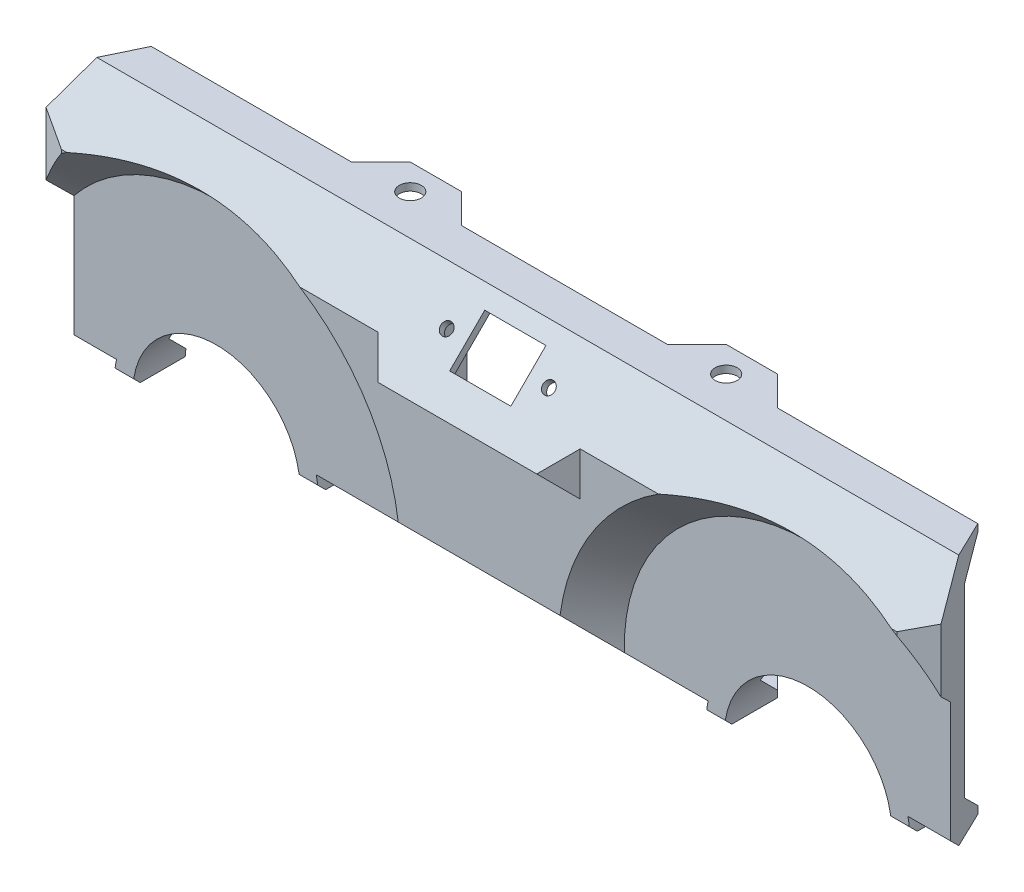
ISO-10303-21;
HEADER;
FILE_DESCRIPTION(('STEP AP214'),'2;1');
FILE_NAME('part.step','',(''),(''),'','','');
FILE_SCHEMA(('AUTOMOTIVE_DESIGN { 1 0 10303 214 1 1 1 1 }'));
ENDSEC;
DATA;
#1=APPLICATION_CONTEXT('core data for automotive mechanical design processes');
#2=APPLICATION_PROTOCOL_DEFINITION('international standard','automotive_design',2000,#1);
#3=PRODUCT_CONTEXT('',#1,'mechanical');
#4=PRODUCT('Part','Part','',(#3));
#5=PRODUCT_RELATED_PRODUCT_CATEGORY('part','',(#4));
#6=PRODUCT_DEFINITION_FORMATION('','',#4);
#7=PRODUCT_DEFINITION_CONTEXT('part definition',#1,'design');
#8=PRODUCT_DEFINITION('design','',#6,#7);
#9=PRODUCT_DEFINITION_SHAPE('','',#8);
#10=(LENGTH_UNIT() NAMED_UNIT(*) SI_UNIT(.MILLI.,.METRE.));
#11=(NAMED_UNIT(*) PLANE_ANGLE_UNIT() SI_UNIT($,.RADIAN.));
#12=(NAMED_UNIT(*) SI_UNIT($,.STERADIAN.) SOLID_ANGLE_UNIT());
#13=UNCERTAINTY_MEASURE_WITH_UNIT(LENGTH_MEASURE(1.E-05),#10,'distance_accuracy_value','');
#14=(GEOMETRIC_REPRESENTATION_CONTEXT(3) GLOBAL_UNCERTAINTY_ASSIGNED_CONTEXT((#13)) GLOBAL_UNIT_ASSIGNED_CONTEXT((#10,
#11,#12)) REPRESENTATION_CONTEXT('',''));
#15=CARTESIAN_POINT('',(0.,0.,0.));
#16=DIRECTION('',(0.,0.,1.));
#17=DIRECTION('',(1.,0.,0.));
#18=AXIS2_PLACEMENT_3D('',#15,#16,#17);
#19=CARTESIAN_POINT('',(124.414182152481,0.,93.5));
#20=DIRECTION('',(0.,-0.707106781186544,-0.707106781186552));
#21=DIRECTION('',(0.,0.707106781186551,-0.707106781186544));
#22=AXIS2_PLACEMENT_3D('',#19,#20,#21);
#23=PLANE('',#22);
#24=CARTESIAN_POINT('',(-13.9,-8.16708332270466,101.667083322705));
#25=DIRECTION('',(0.,0.707106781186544,0.707106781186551));
#26=DIRECTION('',(0.,-0.707106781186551,0.707106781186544));
#27=AXIS2_PLACEMENT_3D('',#24,#25,#26);
#28=CIRCLE('',#27,1.65);
#29=CARTESIAN_POINT('',(-13.9,-9.33380951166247,102.833809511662));
#30=VERTEX_POINT('',#29);
#31=EDGE_CURVE('E1433',#30,#30,#28,.T.);
#32=ORIENTED_EDGE('',*,*,#31,.F.);
#33=EDGE_LOOP('',(#32));
#34=FACE_BOUND('',#33,.T.);
#35=CARTESIAN_POINT('',(13.9,-8.16708332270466,101.667083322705));
#36=DIRECTION('',(0.,0.707106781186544,0.707106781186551));
#37=DIRECTION('',(0.,-0.707106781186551,0.707106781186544));
#38=AXIS2_PLACEMENT_3D('',#35,#36,#37);
#39=CIRCLE('',#38,1.65);
#40=CARTESIAN_POINT('',(13.9,-9.33380951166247,102.833809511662));
#41=VERTEX_POINT('',#40);
#42=EDGE_CURVE('E707',#41,#41,#39,.T.);
#43=ORIENTED_EDGE('',*,*,#42,.F.);
#44=EDGE_LOOP('',(#43));
#45=FACE_BOUND('',#44,.T.);
#46=DIRECTION('',(-1.,0.,0.));
#47=VECTOR('',#46,1.);
#48=CARTESIAN_POINT('',(124.414182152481,-13.2500000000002,106.75));
#49=LINE('',#48,#47);
#50=CARTESIAN_POINT('',(-27.5000000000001,-13.2500000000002,106.75));
#51=VERTEX_POINT('',#50);
#52=CARTESIAN_POINT('',(-48.7869176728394,-13.2500000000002,106.75));
#53=VERTEX_POINT('',#52);
#54=EDGE_CURVE('E1663',#51,#53,#49,.T.);
#55=ORIENTED_EDGE('',*,*,#54,.F.);
#56=DIRECTION('',(0.577350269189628,-0.577350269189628,0.577350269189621));
#57=VECTOR('',#56,1.);
#58=CARTESIAN_POINT('',(14.3047273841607,-55.0547273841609,148.55472738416));
#59=LINE('',#58,#57);
#60=CARTESIAN_POINT('',(-21.5874062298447,-19.1625937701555,112.662593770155));
#61=VERTEX_POINT('',#60);
#62=EDGE_CURVE('E63',#51,#61,#59,.T.);
#63=ORIENTED_EDGE('',*,*,#62,.T.);
#64=DIRECTION('',(1.,0.,0.));
#65=VECTOR('',#64,1.);
#66=CARTESIAN_POINT('',(-21.5,-19.1625937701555,112.662593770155));
#67=LINE('',#66,#65);
#68=CARTESIAN_POINT('',(21.5874062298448,-19.1625937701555,112.662593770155));
#69=VERTEX_POINT('',#68);
#70=EDGE_CURVE('E69',#61,#69,#67,.T.);
#71=ORIENTED_EDGE('',*,*,#70,.T.);
#72=DIRECTION('',(-0.57735026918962,-0.577350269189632,0.577350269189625));
#73=VECTOR('',#72,1.);
#74=CARTESIAN_POINT('',(68.6380607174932,27.8880607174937,65.6119392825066));
#75=LINE('',#74,#73);
#76=CARTESIAN_POINT('',(27.5000000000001,-13.2500000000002,106.75));
#77=VERTEX_POINT('',#76);
#78=EDGE_CURVE('E1854',#69,#77,#75,.F.);
#79=ORIENTED_EDGE('',*,*,#78,.T.);
#80=CARTESIAN_POINT('',(48.7869176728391,-13.2500000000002,106.75));
#81=VERTEX_POINT('',#80);
#82=EDGE_CURVE('E1186',#81,#77,#49,.T.);
#83=ORIENTED_EDGE('',*,*,#82,.F.);
#84=CARTESIAN_POINT('',(48.7869176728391,-13.2500000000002,106.75));
#85=CARTESIAN_POINT('',(49.9349554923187,-12.9151563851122,106.415156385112));
#86=CARTESIAN_POINT('',(51.0921652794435,-12.5958618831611,106.095861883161));
#87=CARTESIAN_POINT('',(53.4239455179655,-11.9902438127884,105.490243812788));
#88=CARTESIAN_POINT('',(54.5985191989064,-11.7039264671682,105.203926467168));
#89=CARTESIAN_POINT('',(56.9650078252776,-11.1659453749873,104.665945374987));
#90=CARTESIAN_POINT('',(58.1569416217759,-10.9143229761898,104.41432297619));
#91=CARTESIAN_POINT('',(60.5551134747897,-10.4479791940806,103.947979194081));
#92=CARTESIAN_POINT('',(61.7613507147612,-10.2332557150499,103.73325571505));
#93=CARTESIAN_POINT('',(64.1823165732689,-9.84301608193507,103.343016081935));
#94=CARTESIAN_POINT('',(65.3970044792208,-9.66737390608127,103.167373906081));
#95=CARTESIAN_POINT('',(67.8365795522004,-9.35585704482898,102.855857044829));
#96=CARTESIAN_POINT('',(69.0614668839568,-9.21998300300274,102.719983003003));
#97=CARTESIAN_POINT('',(71.518310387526,-8.9892495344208,102.489249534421));
#98=CARTESIAN_POINT('',(72.7502625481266,-8.89436879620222,102.394368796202));
#99=CARTESIAN_POINT('',(75.2191710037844,-8.74637780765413,102.246377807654));
#100=CARTESIAN_POINT('',(76.4561272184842,-8.69326688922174,102.193266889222));
#101=CARTESIAN_POINT('',(78.8792198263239,-8.63067192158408,102.130671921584));
#102=CARTESIAN_POINT('',(80.0652653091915,-8.61941786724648,102.119417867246));
#103=CARTESIAN_POINT('',(82.436818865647,-8.63572158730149,102.135721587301));
#104=CARTESIAN_POINT('',(83.6223269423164,-8.66327913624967,102.16327913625));
#105=CARTESIAN_POINT('',(85.9905603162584,-8.75698182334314,102.256981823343));
#106=CARTESIAN_POINT('',(87.1732848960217,-8.82313600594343,102.323136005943));
#107=CARTESIAN_POINT('',(89.5332250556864,-8.99348161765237,102.493481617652));
#108=CARTESIAN_POINT('',(90.7104406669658,-9.09767282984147,102.597672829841));
#109=CARTESIAN_POINT('',(93.0553145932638,-9.34305547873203,102.843055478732));
#110=CARTESIAN_POINT('',(94.2229845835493,-9.4841912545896,102.98419125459));
#111=CARTESIAN_POINT('',(96.5485006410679,-9.80243464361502,103.302434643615));
#112=CARTESIAN_POINT('',(97.7063463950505,-9.97954339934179,103.479543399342));
#113=CARTESIAN_POINT('',(100.009839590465,-10.3683274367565,103.868327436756));
#114=CARTESIAN_POINT('',(101.155491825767,-10.579988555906,104.079988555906));
#115=CARTESIAN_POINT('',(103.433390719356,-11.0364292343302,104.53642923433));
#116=CARTESIAN_POINT('',(104.565638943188,-11.2812048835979,104.781204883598));
#117=CARTESIAN_POINT('',(106.242531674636,-11.6695803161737,105.169580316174));
#118=CARTESIAN_POINT('',(106.792776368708,-11.8012236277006,105.301223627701));
#119=CARTESIAN_POINT('',(107.88950815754,-12.0718798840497,105.57187988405));
#120=CARTESIAN_POINT('',(108.435996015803,-12.2108912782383,105.710891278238));
#121=CARTESIAN_POINT('',(109.524264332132,-12.4958640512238,105.995864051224));
#122=CARTESIAN_POINT('',(110.06605125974,-12.6418130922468,106.141813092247));
#123=CARTESIAN_POINT('',(111.145870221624,-12.9407113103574,106.440711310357));
#124=CARTESIAN_POINT('',(111.683901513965,-13.0936618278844,106.593661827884));
#125=CARTESIAN_POINT('',(112.219953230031,-13.2500000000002,106.75));
#126=B_SPLINE_CURVE_WITH_KNOTS('',3,(#84,#85,#86,#87,#88,#89,#90,#91,#92,#93,#94,#95,#96,#97,
#98,#99,#100,#101,#102,#103,#104,#105,#106,#107,#108,#109,#110,#111,#112,#113,#114,#115,#116,
#117,#118,#119,#120,#121,#122,#123,#124,#125),.UNSPECIFIED.,.F.,.F.,(4,2,2,2,2,2,2,2,2,2,2,2,2,
2,2,2,2,2,2,2,4),(0.,3.72550953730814,7.45172093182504,11.1823353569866,14.9127378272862,
18.6309310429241,22.34918442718,26.0655024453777,29.7817610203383,33.3389574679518,
36.8961332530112,40.4541429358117,44.0121323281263,47.5647917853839,51.1175640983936,
54.6688838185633,58.2197845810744,59.9623591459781,61.7045684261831,63.4437875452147,
65.1833410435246),.UNSPECIFIED.);
#127=CARTESIAN_POINT('',(112.219953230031,-13.2500000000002,106.75));
#128=VERTEX_POINT('',#127);
#129=EDGE_CURVE('E821',#81,#128,#126,.T.);
#130=ORIENTED_EDGE('',*,*,#129,.T.);
#131=DIRECTION('',(-1.,0.,0.));
#132=VECTOR('',#131,1.);
#133=CARTESIAN_POINT('',(124.414182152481,-13.2500000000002,106.75));
#134=LINE('',#133,#132);
#135=CARTESIAN_POINT('',(113.675932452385,-13.2500000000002,106.75));
#136=VERTEX_POINT('',#135);
#137=EDGE_CURVE('E1257',#136,#128,#134,.T.);
#138=ORIENTED_EDGE('',*,*,#137,.F.);
#139=DIRECTION('',(-0.826455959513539,-0.398102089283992,0.398102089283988));
#140=VECTOR('',#139,1.);
#141=CARTESIAN_POINT('',(120.360250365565,-10.030178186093,103.530178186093));
#142=LINE('',#141,#140);
#143=CARTESIAN_POINT('',(121.792599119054,-9.3402188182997,102.8402188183));
#144=VERTEX_POINT('',#143);
#145=EDGE_CURVE('E1265',#136,#144,#142,.F.);
#146=ORIENTED_EDGE('',*,*,#145,.T.);
#147=CARTESIAN_POINT('',(117.293435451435,0.,93.5));
#148=CARTESIAN_POINT('',(118.357184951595,-2.20833333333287,95.7083333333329));
#149=CARTESIAN_POINT('',(119.420934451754,-4.41666666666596,97.9166666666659));
#150=CARTESIAN_POINT('',(121.548433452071,-8.83333333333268,102.333333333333));
#151=CARTESIAN_POINT('',(122.612182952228,-11.0416666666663,104.541666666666));
#152=CARTESIAN_POINT('',(123.675932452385,-13.2500000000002,106.75));
#153=B_SPLINE_CURVE_WITH_KNOTS('',3,(#147,#148,#149,#150,#151,#152),.UNSPECIFIED.,.F.,.F.,(4,2,
4),(0.,9.89774302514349,19.7954860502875),.UNSPECIFIED.);
#154=CARTESIAN_POINT('',(117.293435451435,0.,93.5));
#155=VERTEX_POINT('',#154);
#156=EDGE_CURVE('E745',#155,#144,#153,.T.);
#157=ORIENTED_EDGE('',*,*,#156,.F.);
#158=DIRECTION('',(-1.,0.,0.));
#159=VECTOR('',#158,1.);
#160=CARTESIAN_POINT('',(124.414182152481,0.,93.5));
#161=LINE('',#160,#159);
#162=CARTESIAN_POINT('',(-117.293435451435,0.,93.5));
#163=VERTEX_POINT('',#162);
#164=EDGE_CURVE('E1651',#155,#163,#161,.T.);
#165=ORIENTED_EDGE('',*,*,#164,.T.);
#166=DIRECTION('',(0.321517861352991,0.66956189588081,-0.669561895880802));
#167=VECTOR('',#166,1.);
#168=CARTESIAN_POINT('',(-92.3072162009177,52.0338753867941,41.4661246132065));
#169=LINE('',#168,#167);
#170=CARTESIAN_POINT('',(-121.781171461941,-9.3457234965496,102.84572349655));
#171=VERTEX_POINT('',#170);
#172=EDGE_CURVE('E1001',#171,#163,#169,.T.);
#173=ORIENTED_EDGE('',*,*,#172,.F.);
#174=DIRECTION('',(-0.826455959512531,0.398102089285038,-0.398102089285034));
#175=VECTOR('',#174,1.);
#176=CARTESIAN_POINT('',(-106.766641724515,-16.5781907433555,110.078190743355));
#177=LINE('',#176,#175);
#178=CARTESIAN_POINT('',(-113.675932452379,-13.2500000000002,106.75));
#179=VERTEX_POINT('',#178);
#180=EDGE_CURVE('E1030',#171,#179,#177,.F.);
#181=ORIENTED_EDGE('',*,*,#180,.T.);
#182=CARTESIAN_POINT('',(-112.219953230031,-13.2500000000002,106.75));
#183=VERTEX_POINT('',#182);
#184=EDGE_CURVE('E1655',#183,#179,#49,.T.);
#185=ORIENTED_EDGE('',*,*,#184,.F.);
#186=CARTESIAN_POINT('',(-112.219953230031,-13.2500000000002,106.75));
#187=CARTESIAN_POINT('',(-111.071915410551,-12.9151563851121,106.415156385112));
#188=CARTESIAN_POINT('',(-109.914705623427,-12.5958618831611,106.095861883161));
#189=CARTESIAN_POINT('',(-107.582925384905,-11.9902438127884,105.490243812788));
#190=CARTESIAN_POINT('',(-106.408351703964,-11.7039264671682,105.203926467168));
#191=CARTESIAN_POINT('',(-104.041863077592,-11.1659453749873,104.665945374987));
#192=CARTESIAN_POINT('',(-102.849929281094,-10.9143229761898,104.41432297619));
#193=CARTESIAN_POINT('',(-100.45175742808,-10.4479791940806,103.94797919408));
#194=CARTESIAN_POINT('',(-99.245520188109,-10.2332557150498,103.73325571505));
#195=CARTESIAN_POINT('',(-96.8245543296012,-9.84301608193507,103.343016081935));
#196=CARTESIAN_POINT('',(-95.6098664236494,-9.66737390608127,103.167373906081));
#197=CARTESIAN_POINT('',(-93.1702913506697,-9.35585704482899,102.855857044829));
#198=CARTESIAN_POINT('',(-91.9454040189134,-9.21998300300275,102.719983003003));
#199=CARTESIAN_POINT('',(-89.4885605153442,-8.98924953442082,102.489249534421));
#200=CARTESIAN_POINT('',(-88.2566083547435,-8.89436879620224,102.394368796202));
#201=CARTESIAN_POINT('',(-85.7876998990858,-8.74637780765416,102.246377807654));
#202=CARTESIAN_POINT('',(-84.550743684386,-8.69326688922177,102.193266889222));
#203=CARTESIAN_POINT('',(-82.1276510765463,-8.63067192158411,102.130671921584));
#204=CARTESIAN_POINT('',(-80.9416055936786,-8.61941786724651,102.119417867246));
#205=CARTESIAN_POINT('',(-78.5700520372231,-8.63572158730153,102.135721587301));
#206=CARTESIAN_POINT('',(-77.3845439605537,-8.66327913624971,102.16327913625));
#207=CARTESIAN_POINT('',(-75.0163105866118,-8.75698182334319,102.256981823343));
#208=CARTESIAN_POINT('',(-73.8335860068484,-8.82313600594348,102.323136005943));
#209=CARTESIAN_POINT('',(-71.4736458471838,-8.99348161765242,102.493481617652));
#210=CARTESIAN_POINT('',(-70.2964302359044,-9.09767282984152,102.597672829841));
#211=CARTESIAN_POINT('',(-67.9515563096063,-9.34305547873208,102.843055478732));
#212=CARTESIAN_POINT('',(-66.7838863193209,-9.48419125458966,102.98419125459));
#213=CARTESIAN_POINT('',(-64.4583702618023,-9.80243464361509,103.302434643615));
#214=CARTESIAN_POINT('',(-63.3005245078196,-9.97954339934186,103.479543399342));
#215=CARTESIAN_POINT('',(-60.9970313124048,-10.3683274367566,103.868327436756));
#216=CARTESIAN_POINT('',(-59.8513790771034,-10.579988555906,104.079988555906));
#217=CARTESIAN_POINT('',(-57.5734801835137,-11.0364292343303,104.53642923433));
#218=CARTESIAN_POINT('',(-56.4412319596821,-11.281204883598,104.781204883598));
#219=CARTESIAN_POINT('',(-54.7643392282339,-11.6695803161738,105.169580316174));
#220=CARTESIAN_POINT('',(-54.2140945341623,-11.8012236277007,105.301223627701));
#221=CARTESIAN_POINT('',(-53.1173627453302,-12.0718798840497,105.57187988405));
#222=CARTESIAN_POINT('',(-52.5708748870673,-12.2108912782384,105.710891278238));
#223=CARTESIAN_POINT('',(-51.4826065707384,-12.4958640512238,105.995864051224));
#224=CARTESIAN_POINT('',(-50.9408196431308,-12.6418130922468,106.141813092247));
#225=CARTESIAN_POINT('',(-49.8610006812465,-12.9407113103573,106.440711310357));
#226=CARTESIAN_POINT('',(-49.3229693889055,-13.0936618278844,106.593661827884));
#227=CARTESIAN_POINT('',(-48.7869176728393,-13.2500000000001,106.75));
#228=B_SPLINE_CURVE_WITH_KNOTS('',3,(#186,#187,#188,#189,#190,#191,#192,#193,#194,#195,#196,
#197,#198,#199,#200,#201,#202,#203,#204,#205,#206,#207,#208,#209,#210,#211,#212,#213,#214,#215,
#216,#217,#218,#219,#220,#221,#222,#223,#224,#225,#226,#227),.UNSPECIFIED.,.F.,.F.,(4,2,2,2,2,2,
2,2,2,2,2,2,2,2,2,2,2,2,2,2,4),(0.,3.72550953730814,7.45172093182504,11.1823353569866,
14.9127378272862,18.6309310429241,22.3491844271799,26.0655024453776,29.7817610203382,
33.3389574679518,36.8961332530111,40.4541429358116,44.0121323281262,47.5647917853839,
51.1175640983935,54.6688838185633,58.2197845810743,59.962359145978,61.7045684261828,
63.4437875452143,65.1833410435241),.UNSPECIFIED.);
#229=EDGE_CURVE('E812',#183,#53,#228,.T.);
#230=ORIENTED_EDGE('',*,*,#229,.T.);
#231=EDGE_LOOP('',(#55,#63,#71,#79,#83,#130,#138,#146,#157,#165,#173,#181,#185,#230));
#232=FACE_BOUND('',#231,.T.);
#233=DIRECTION('',(1.,0.,0.));
#234=VECTOR('',#233,1.);
#235=CARTESIAN_POINT('',(-8.325,-3.39411254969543,96.8941125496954));
#236=LINE('',#235,#234);
#237=CARTESIAN_POINT('',(-8.325,-3.39411254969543,96.8941125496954));
#238=VERTEX_POINT('',#237);
#239=CARTESIAN_POINT('',(8.325,-3.39411254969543,96.8941125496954));
#240=VERTEX_POINT('',#239);
#241=EDGE_CURVE('E701',#238,#240,#236,.T.);
#242=ORIENTED_EDGE('',*,*,#241,.T.);
#243=DIRECTION('',(0.,-0.707106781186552,0.707106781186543));
#244=VECTOR('',#243,1.);
#245=CARTESIAN_POINT('',(8.325,-3.39411254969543,96.8941125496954));
#246=LINE('',#245,#244);
#247=CARTESIAN_POINT('',(8.325,-12.9400540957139,106.440054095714));
#248=VERTEX_POINT('',#247);
#249=EDGE_CURVE('E694',#240,#248,#246,.T.);
#250=ORIENTED_EDGE('',*,*,#249,.T.);
#251=DIRECTION('',(1.,0.,0.));
#252=VECTOR('',#251,1.);
#253=CARTESIAN_POINT('',(-8.325,-12.9400540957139,106.440054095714));
#254=LINE('',#253,#252);
#255=CARTESIAN_POINT('',(-8.325,-12.9400540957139,106.440054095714));
#256=VERTEX_POINT('',#255);
#257=EDGE_CURVE('E674',#256,#248,#254,.T.);
#258=ORIENTED_EDGE('',*,*,#257,.F.);
#259=DIRECTION('',(0.,-0.707106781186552,0.707106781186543));
#260=VECTOR('',#259,1.);
#261=CARTESIAN_POINT('',(-8.325,-3.39411254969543,96.8941125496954));
#262=LINE('',#261,#260);
#263=EDGE_CURVE('E686',#238,#256,#262,.T.);
#264=ORIENTED_EDGE('',*,*,#263,.F.);
#265=EDGE_LOOP('',(#242,#250,#258,#264));
#266=FACE_BOUND('',#265,.T.);
#267=ADVANCED_FACE('F53',(#34,#45,#232,#266),#23,.F.);
#268=CARTESIAN_POINT('',(0.,45.3357864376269,45.3357864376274));
#269=DIRECTION('',(0.,-0.707106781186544,-0.707106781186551));
#270=DIRECTION('',(0.,0.707106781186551,-0.707106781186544));
#271=AXIS2_PLACEMENT_3D('',#268,#269,#270);
#272=PLANE('',#271);
#273=CARTESIAN_POINT('',(-13.9,-9.58129688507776,100.252869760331));
#274=DIRECTION('',(0.,-0.707106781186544,-0.707106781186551));
#275=DIRECTION('',(0.,0.707106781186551,-0.707106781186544));
#276=AXIS2_PLACEMENT_3D('',#273,#274,#275);
#277=CIRCLE('',#276,1.65);
#278=CARTESIAN_POINT('',(-13.9,-8.41457069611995,99.0861435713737));
#279=VERTEX_POINT('',#278);
#280=EDGE_CURVE('E713',#279,#279,#277,.T.);
#281=ORIENTED_EDGE('',*,*,#280,.F.);
#282=EDGE_LOOP('',(#281));
#283=FACE_BOUND('',#282,.T.);
#284=CARTESIAN_POINT('',(13.9,-9.58129688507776,100.252869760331));
#285=DIRECTION('',(0.,-0.707106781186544,-0.707106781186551));
#286=DIRECTION('',(0.,0.707106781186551,-0.707106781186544));
#287=AXIS2_PLACEMENT_3D('',#284,#285,#286);
#288=CIRCLE('',#287,1.65);
#289=CARTESIAN_POINT('',(13.9,-8.41457069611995,99.0861435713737));
#290=VERTEX_POINT('',#289);
#291=EDGE_CURVE('E1430',#290,#290,#288,.T.);
#292=ORIENTED_EDGE('',*,*,#291,.F.);
#293=EDGE_LOOP('',(#292));
#294=FACE_BOUND('',#293,.T.);
#295=DIRECTION('',(1.,0.,0.));
#296=VECTOR('',#295,1.);
#297=CARTESIAN_POINT('',(-19.5,-2.82842712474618,93.5));
#298=LINE('',#297,#296);
#299=CARTESIAN_POINT('',(-19.5,-2.82842712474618,93.5));
#300=VERTEX_POINT('',#299);
#301=CARTESIAN_POINT('',(19.5,-2.82842712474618,93.5));
#302=VERTEX_POINT('',#301);
#303=EDGE_CURVE('E708',#300,#302,#298,.T.);
#304=ORIENTED_EDGE('',*,*,#303,.T.);
#305=DIRECTION('',(0.,-0.707106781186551,0.707106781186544));
#306=VECTOR('',#305,1.);
#307=CARTESIAN_POINT('',(19.5,-2.82842712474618,93.5));
#308=LINE('',#307,#306);
#309=CARTESIAN_POINT('',(19.5,-19.1625937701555,109.834166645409));
#310=VERTEX_POINT('',#309);
#311=EDGE_CURVE('E712',#302,#310,#308,.T.);
#312=ORIENTED_EDGE('',*,*,#311,.T.);
#313=DIRECTION('',(1.,0.,0.));
#314=VECTOR('',#313,1.);
#315=CARTESIAN_POINT('',(-19.5,-19.1625937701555,109.834166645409));
#316=LINE('',#315,#314);
#317=CARTESIAN_POINT('',(-19.5,-19.1625937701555,109.834166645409));
#318=VERTEX_POINT('',#317);
#319=EDGE_CURVE('E716',#318,#310,#316,.T.);
#320=ORIENTED_EDGE('',*,*,#319,.F.);
#321=DIRECTION('',(0.,-0.707106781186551,0.707106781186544));
#322=VECTOR('',#321,1.);
#323=CARTESIAN_POINT('',(-19.5,-2.82842712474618,93.5));
#324=LINE('',#323,#322);
#325=EDGE_CURVE('E720',#300,#318,#324,.T.);
#326=ORIENTED_EDGE('',*,*,#325,.F.);
#327=EDGE_LOOP('',(#304,#312,#320,#326));
#328=FACE_BOUND('',#327,.T.);
#329=DIRECTION('',(0.,0.707106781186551,-0.707106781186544));
#330=VECTOR('',#329,1.);
#331=CARTESIAN_POINT('',(8.32499999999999,45.3357864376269,45.3357864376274));
#332=LINE('',#331,#330);
#333=CARTESIAN_POINT('',(8.325,-14.354267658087,105.025840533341));
#334=VERTEX_POINT('',#333);
#335=CARTESIAN_POINT('',(8.325,-4.80832611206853,95.4798989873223));
#336=VERTEX_POINT('',#335);
#337=EDGE_CURVE('E2268',#334,#336,#332,.T.);
#338=ORIENTED_EDGE('',*,*,#337,.T.);
#339=DIRECTION('',(-1.,0.,0.));
#340=VECTOR('',#339,1.);
#341=CARTESIAN_POINT('',(0.,-4.80832611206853,95.4798989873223));
#342=LINE('',#341,#340);
#343=CARTESIAN_POINT('',(-8.325,-4.80832611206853,95.4798989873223));
#344=VERTEX_POINT('',#343);
#345=EDGE_CURVE('E2272',#336,#344,#342,.T.);
#346=ORIENTED_EDGE('',*,*,#345,.T.);
#347=DIRECTION('',(0.,0.707106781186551,-0.707106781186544));
#348=VECTOR('',#347,1.);
#349=CARTESIAN_POINT('',(-8.325,45.3357864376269,45.3357864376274));
#350=LINE('',#349,#348);
#351=CARTESIAN_POINT('',(-8.325,-14.354267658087,105.025840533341));
#352=VERTEX_POINT('',#351);
#353=EDGE_CURVE('E1313',#352,#344,#350,.T.);
#354=ORIENTED_EDGE('',*,*,#353,.F.);
#355=DIRECTION('',(-1.,0.,0.));
#356=VECTOR('',#355,1.);
#357=CARTESIAN_POINT('',(0.,-14.354267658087,105.025840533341));
#358=LINE('',#357,#356);
#359=EDGE_CURVE('E677',#334,#352,#358,.T.);
#360=ORIENTED_EDGE('',*,*,#359,.F.);
#361=EDGE_LOOP('',(#338,#346,#354,#360));
#362=FACE_BOUND('',#361,.T.);
#363=ADVANCED_FACE('F792',(#283,#294,#328,#362),#272,.T.);
#364=CARTESIAN_POINT('',(124.414182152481,-2.,83.4999999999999));
#365=DIRECTION('',(0.,-0.70710678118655,-0.707106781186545));
#366=DIRECTION('',(1.,0.,0.));
#367=AXIS2_PLACEMENT_3D('',#364,#365,#366);
#368=PLANE('',#367);
#369=DIRECTION('',(0.,0.707106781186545,-0.70710678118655));
#370=VECTOR('',#369,1.);
#371=CARTESIAN_POINT('',(19.5,-2.,83.4999999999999));
#372=LINE('',#371,#370);
#373=CARTESIAN_POINT('',(19.5,-7.41421356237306,88.914213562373));
#374=VERTEX_POINT('',#373);
#375=CARTESIAN_POINT('',(19.5,-9.00000000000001,90.5));
#376=VERTEX_POINT('',#375);
#377=EDGE_CURVE('E740',#374,#376,#372,.F.);
#378=ORIENTED_EDGE('',*,*,#377,.F.);
#379=DIRECTION('',(-1.,0.,0.));
#380=VECTOR('',#379,1.);
#381=CARTESIAN_POINT('',(124.414182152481,-7.41421356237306,88.914213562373));
#382=LINE('',#381,#380);
#383=CARTESIAN_POINT('',(-19.4999999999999,-7.41421356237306,88.914213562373));
#384=VERTEX_POINT('',#383);
#385=EDGE_CURVE('E1847',#384,#374,#382,.F.);
#386=ORIENTED_EDGE('',*,*,#385,.F.);
#387=DIRECTION('',(0.,0.707106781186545,-0.70710678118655));
#388=VECTOR('',#387,1.);
#389=CARTESIAN_POINT('',(-19.4999999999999,-2.,83.4999999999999));
#390=LINE('',#389,#388);
#391=CARTESIAN_POINT('',(-19.5,-9.00000000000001,90.5));
#392=VERTEX_POINT('',#391);
#393=EDGE_CURVE('E736',#384,#392,#390,.F.);
#394=ORIENTED_EDGE('',*,*,#393,.T.);
#395=DIRECTION('',(1.,0.,0.));
#396=VECTOR('',#395,1.);
#397=CARTESIAN_POINT('',(35.9888573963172,-9.00000000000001,90.5));
#398=LINE('',#397,#396);
#399=CARTESIAN_POINT('',(-36.9888573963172,-9.00000000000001,90.5));
#400=VERTEX_POINT('',#399);
#401=EDGE_CURVE('E1041',#400,#392,#398,.T.);
#402=ORIENTED_EDGE('',*,*,#401,.F.);
#403=DIRECTION('',(0.,0.707106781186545,-0.70710678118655));
#404=VECTOR('',#403,1.);
#405=CARTESIAN_POINT('',(-36.9888573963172,39.25,42.2499999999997));
#406=LINE('',#405,#404);
#407=CARTESIAN_POINT('',(-36.9888573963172,-3.,84.5));
#408=VERTEX_POINT('',#407);
#409=EDGE_CURVE('E1048',#408,#400,#406,.F.);
#410=ORIENTED_EDGE('',*,*,#409,.F.);
#411=DIRECTION('',(1.,0.,0.));
#412=VECTOR('',#411,1.);
#413=CARTESIAN_POINT('',(0.,-3.,84.5));
#414=LINE('',#413,#412);
#415=CARTESIAN_POINT('',(-35.9888573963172,-3.,84.5));
#416=VERTEX_POINT('',#415);
#417=EDGE_CURVE('E1076',#416,#408,#414,.F.);
#418=ORIENTED_EDGE('',*,*,#417,.F.);
#419=DIRECTION('',(0.,0.707106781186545,-0.70710678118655));
#420=VECTOR('',#419,1.);
#421=CARTESIAN_POINT('',(-35.9888573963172,-2.,83.4999999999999));
#422=LINE('',#421,#420);
#423=CARTESIAN_POINT('',(-35.9888573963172,-2.,83.4999999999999));
#424=VERTEX_POINT('',#423);
#425=EDGE_CURVE('E1079',#424,#416,#422,.F.);
#426=ORIENTED_EDGE('',*,*,#425,.F.);
#427=DIRECTION('',(-1.,0.,0.));
#428=VECTOR('',#427,1.);
#429=CARTESIAN_POINT('',(-35.9888573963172,-2.,83.4999999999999));
#430=LINE('',#429,#428);
#431=CARTESIAN_POINT('',(-27.9888573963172,-2.,83.5));
#432=VERTEX_POINT('',#431);
#433=EDGE_CURVE('E1082',#432,#424,#430,.T.);
#434=ORIENTED_EDGE('',*,*,#433,.F.);
#435=DIRECTION('',(-1.,0.,0.));
#436=VECTOR('',#435,1.);
#437=CARTESIAN_POINT('',(124.414182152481,-2.,83.5));
#438=LINE('',#437,#436);
#439=CARTESIAN_POINT('',(27.9888573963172,-2.,83.5));
#440=VERTEX_POINT('',#439);
#441=EDGE_CURVE('E1218',#440,#432,#438,.T.);
#442=ORIENTED_EDGE('',*,*,#441,.F.);
#443=DIRECTION('',(-1.,0.,0.));
#444=VECTOR('',#443,1.);
#445=CARTESIAN_POINT('',(-35.9888573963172,-2.,83.4999999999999));
#446=LINE('',#445,#444);
#447=CARTESIAN_POINT('',(35.9888573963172,-2.,83.4999999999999));
#448=VERTEX_POINT('',#447);
#449=EDGE_CURVE('E1539',#448,#440,#446,.T.);
#450=ORIENTED_EDGE('',*,*,#449,.F.);
#451=DIRECTION('',(0.,-0.707106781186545,0.70710678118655));
#452=VECTOR('',#451,1.);
#453=CARTESIAN_POINT('',(35.9888573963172,-4.50000000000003,86.));
#454=LINE('',#453,#452);
#455=CARTESIAN_POINT('',(35.9888573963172,-3.,84.5));
#456=VERTEX_POINT('',#455);
#457=EDGE_CURVE('E1607',#456,#448,#454,.F.);
#458=ORIENTED_EDGE('',*,*,#457,.F.);
#459=DIRECTION('',(1.,0.,0.));
#460=VECTOR('',#459,1.);
#461=CARTESIAN_POINT('',(0.,-3.,84.5));
#462=LINE('',#461,#460);
#463=CARTESIAN_POINT('',(36.9888573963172,-3.,84.5));
#464=VERTEX_POINT('',#463);
#465=EDGE_CURVE('E1542',#464,#456,#462,.F.);
#466=ORIENTED_EDGE('',*,*,#465,.F.);
#467=DIRECTION('',(0.,-0.707106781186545,0.70710678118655));
#468=VECTOR('',#467,1.);
#469=CARTESIAN_POINT('',(36.9888573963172,-2.,83.4999999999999));
#470=LINE('',#469,#468);
#471=CARTESIAN_POINT('',(36.9888573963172,-9.00000000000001,90.5));
#472=VERTEX_POINT('',#471);
#473=EDGE_CURVE('E2051',#472,#464,#470,.F.);
#474=ORIENTED_EDGE('',*,*,#473,.F.);
#475=EDGE_CURVE('E1109',#376,#472,#398,.T.);
#476=ORIENTED_EDGE('',*,*,#475,.F.);
#477=EDGE_LOOP('',(#378,#386,#394,#402,#410,#418,#426,#434,#442,#450,#458,#466,#474,#476));
#478=FACE_BOUND('',#477,.T.);
#479=ADVANCED_FACE('F797',(#478),#368,.T.);
#480=CARTESIAN_POINT('',(124.414182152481,-66.5000000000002,90.5));
#481=DIRECTION('',(0.,0.,1.));
#482=DIRECTION('',(1.,0.,0.));
#483=AXIS2_PLACEMENT_3D('',#480,#481,#482);
#484=PLANE('',#483);
#485=DIRECTION('',(0.,-1.,0.));
#486=VECTOR('',#485,1.);
#487=CARTESIAN_POINT('',(19.5,-66.5000000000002,90.5));
#488=LINE('',#487,#486);
#489=CARTESIAN_POINT('',(19.5,-38.4967604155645,90.5));
#490=VERTEX_POINT('',#489);
#491=EDGE_CURVE('E1849',#376,#490,#488,.T.);
#492=ORIENTED_EDGE('',*,*,#491,.F.);
#493=ORIENTED_EDGE('',*,*,#475,.T.);
#494=DIRECTION('',(0.,1.,0.));
#495=VECTOR('',#494,1.);
#496=CARTESIAN_POINT('',(36.9888573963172,-3.,90.5));
#497=LINE('',#496,#495);
#498=CARTESIAN_POINT('',(36.9888573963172,-2.,90.5));
#499=VERTEX_POINT('',#498);
#500=EDGE_CURVE('E1719',#472,#499,#497,.T.);
#501=ORIENTED_EDGE('',*,*,#500,.T.);
#502=DIRECTION('',(-1.,0.,0.));
#503=VECTOR('',#502,1.);
#504=CARTESIAN_POINT('',(124.414182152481,-2.,90.5));
#505=LINE('',#504,#503);
#506=CARTESIAN_POINT('',(48.9888573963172,-2.,90.5));
#507=VERTEX_POINT('',#506);
#508=EDGE_CURVE('E1224',#507,#499,#505,.T.);
#509=ORIENTED_EDGE('',*,*,#508,.F.);
#510=DIRECTION('',(0.,1.,0.));
#511=VECTOR('',#510,1.);
#512=CARTESIAN_POINT('',(48.9888573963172,-3.,90.5));
#513=LINE('',#512,#511);
#514=CARTESIAN_POINT('',(48.9888573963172,-9.00000000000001,90.5));
#515=VERTEX_POINT('',#514);
#516=EDGE_CURVE('E1601',#515,#507,#513,.T.);
#517=ORIENTED_EDGE('',*,*,#516,.F.);
#518=DIRECTION('',(1.,0.,0.));
#519=VECTOR('',#518,1.);
#520=CARTESIAN_POINT('',(115.839328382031,-9.00000000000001,90.5));
#521=LINE('',#520,#519);
#522=CARTESIAN_POINT('',(115.839328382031,-9.00000000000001,90.5));
#523=VERTEX_POINT('',#522);
#524=EDGE_CURVE('E2354',#515,#523,#521,.T.);
#525=ORIENTED_EDGE('',*,*,#524,.T.);
#526=DIRECTION('',(0.,-1.,0.));
#527=VECTOR('',#526,1.);
#528=CARTESIAN_POINT('',(115.839328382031,0.,90.5));
#529=LINE('',#528,#527);
#530=CARTESIAN_POINT('',(115.839328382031,-59.5000000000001,90.5));
#531=VERTEX_POINT('',#530);
#532=EDGE_CURVE('E1247',#523,#531,#529,.T.);
#533=ORIENTED_EDGE('',*,*,#532,.T.);
#534=DIRECTION('',(-1.,0.,0.));
#535=VECTOR('',#534,1.);
#536=CARTESIAN_POINT('',(103.018013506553,-59.5000000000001,90.5));
#537=LINE('',#536,#535);
#538=CARTESIAN_POINT('',(100.724865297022,-59.5000000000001,90.5));
#539=VERTEX_POINT('',#538);
#540=EDGE_CURVE('E2351',#531,#539,#537,.T.);
#541=ORIENTED_EDGE('',*,*,#540,.T.);
#542=CARTESIAN_POINT('',(80.5034354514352,-70.0000000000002,90.5));
#543=DIRECTION('',(0.,0.,1.));
#544=DIRECTION('',(1.,0.,0.));
#545=AXIS2_PLACEMENT_3D('',#542,#543,#544);
#546=CIRCLE('',#545,22.785);
#547=CARTESIAN_POINT('',(60.2820056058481,-59.5000000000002,90.5));
#548=VERTEX_POINT('',#547);
#549=EDGE_CURVE('E1581',#548,#539,#546,.F.);
#550=ORIENTED_EDGE('',*,*,#549,.F.);
#551=DIRECTION('',(-1.,0.,0.));
#552=VECTOR('',#551,1.);
#553=CARTESIAN_POINT('',(49.9888573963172,-59.5000000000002,90.5));
#554=LINE('',#553,#552);
#555=CARTESIAN_POINT('',(48.9888573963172,-59.5000000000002,90.5));
#556=VERTEX_POINT('',#555);
#557=EDGE_CURVE('E1897',#548,#556,#554,.T.);
#558=ORIENTED_EDGE('',*,*,#557,.T.);
#559=DIRECTION('',(0.,-1.,0.));
#560=VECTOR('',#559,1.);
#561=CARTESIAN_POINT('',(48.9888573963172,-65.5000000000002,90.5));
#562=LINE('',#561,#560);
#563=CARTESIAN_POINT('',(48.9888573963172,-66.5000000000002,90.5));
#564=VERTEX_POINT('',#563);
#565=EDGE_CURVE('E1490',#556,#564,#562,.T.);
#566=ORIENTED_EDGE('',*,*,#565,.T.);
#567=DIRECTION('',(-1.,0.,0.));
#568=VECTOR('',#567,1.);
#569=CARTESIAN_POINT('',(124.414182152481,-66.5000000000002,90.5));
#570=LINE('',#569,#568);
#571=CARTESIAN_POINT('',(36.9888573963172,-66.5000000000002,90.5));
#572=VERTEX_POINT('',#571);
#573=EDGE_CURVE('E1232',#564,#572,#570,.T.);
#574=ORIENTED_EDGE('',*,*,#573,.T.);
#575=DIRECTION('',(0.,-1.,0.));
#576=VECTOR('',#575,1.);
#577=CARTESIAN_POINT('',(36.9888573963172,-65.5000000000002,90.5));
#578=LINE('',#577,#576);
#579=CARTESIAN_POINT('',(36.9888573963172,-59.5000000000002,90.5));
#580=VERTEX_POINT('',#579);
#581=EDGE_CURVE('E2387',#580,#572,#578,.T.);
#582=ORIENTED_EDGE('',*,*,#581,.F.);
#583=DIRECTION('',(-1.,0.,0.));
#584=VECTOR('',#583,1.);
#585=CARTESIAN_POINT('',(-35.9888573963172,-59.5000000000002,90.5));
#586=LINE('',#585,#584);
#587=CARTESIAN_POINT('',(-36.9888573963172,-59.5000000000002,90.5));
#588=VERTEX_POINT('',#587);
#589=EDGE_CURVE('E1106',#580,#588,#586,.T.);
#590=ORIENTED_EDGE('',*,*,#589,.T.);
#591=DIRECTION('',(0.,-1.,0.));
#592=VECTOR('',#591,1.);
#593=CARTESIAN_POINT('',(-36.9888573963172,-65.5000000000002,90.5));
#594=LINE('',#593,#592);
#595=CARTESIAN_POINT('',(-36.9888573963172,-66.5000000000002,90.5));
#596=VERTEX_POINT('',#595);
#597=EDGE_CURVE('E1706',#588,#596,#594,.T.);
#598=ORIENTED_EDGE('',*,*,#597,.T.);
#599=DIRECTION('',(-1.,0.,0.));
#600=VECTOR('',#599,1.);
#601=CARTESIAN_POINT('',(124.414182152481,-66.5000000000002,90.5));
#602=LINE('',#601,#600);
#603=CARTESIAN_POINT('',(-48.9888573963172,-66.5000000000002,90.5));
#604=VERTEX_POINT('',#603);
#605=EDGE_CURVE('E1693',#596,#604,#602,.T.);
#606=ORIENTED_EDGE('',*,*,#605,.T.);
#607=DIRECTION('',(0.,-1.,0.));
#608=VECTOR('',#607,1.);
#609=CARTESIAN_POINT('',(-48.9888573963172,-65.5000000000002,90.5));
#610=LINE('',#609,#608);
#611=CARTESIAN_POINT('',(-48.9888573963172,-59.5000000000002,90.5));
#612=VERTEX_POINT('',#611);
#613=EDGE_CURVE('E1372',#612,#604,#610,.T.);
#614=ORIENTED_EDGE('',*,*,#613,.F.);
#615=DIRECTION('',(-1.,0.,0.));
#616=VECTOR('',#615,1.);
#617=CARTESIAN_POINT('',(-57.9888573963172,-59.5000000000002,90.5));
#618=LINE('',#617,#616);
#619=CARTESIAN_POINT('',(-60.2820056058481,-59.5000000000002,90.5));
#620=VERTEX_POINT('',#619);
#621=EDGE_CURVE('E1044',#612,#620,#618,.T.);
#622=ORIENTED_EDGE('',*,*,#621,.T.);
#623=CARTESIAN_POINT('',(-80.5034354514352,-70.0000000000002,90.5));
#624=DIRECTION('',(0.,0.,1.));
#625=DIRECTION('',(1.,0.,0.));
#626=AXIS2_PLACEMENT_3D('',#623,#624,#625);
#627=CIRCLE('',#626,22.785);
#628=CARTESIAN_POINT('',(-100.724865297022,-59.5000000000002,90.5));
#629=VERTEX_POINT('',#628);
#630=EDGE_CURVE('E1034',#620,#629,#627,.T.);
#631=ORIENTED_EDGE('',*,*,#630,.T.);
#632=DIRECTION('',(-1.,0.,0.));
#633=VECTOR('',#632,1.);
#634=CARTESIAN_POINT('',(-115.839328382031,-59.5000000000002,90.5));
#635=LINE('',#634,#633);
#636=CARTESIAN_POINT('',(-115.758705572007,-59.5000000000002,90.5));
#637=VERTEX_POINT('',#636);
#638=EDGE_CURVE('E989',#629,#637,#635,.T.);
#639=ORIENTED_EDGE('',*,*,#638,.T.);
#640=DIRECTION('',(0.00150648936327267,-0.999998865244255,0.));
#641=VECTOR('',#640,1.);
#642=CARTESIAN_POINT('',(-115.747615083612,-66.8618016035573,90.5));
#643=LINE('',#642,#641);
#644=CARTESIAN_POINT('',(-115.834783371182,-9.00000000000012,90.5));
#645=VERTEX_POINT('',#644);
#646=EDGE_CURVE('E995',#645,#637,#643,.T.);
#647=ORIENTED_EDGE('',*,*,#646,.F.);
#648=DIRECTION('',(1.,0.,0.));
#649=VECTOR('',#648,1.);
#650=CARTESIAN_POINT('',(-49.9888573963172,-9.00000000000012,90.5));
#651=LINE('',#650,#649);
#652=CARTESIAN_POINT('',(-48.9888573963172,-9.00000000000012,90.5));
#653=VERTEX_POINT('',#652);
#654=EDGE_CURVE('E1037',#645,#653,#651,.T.);
#655=ORIENTED_EDGE('',*,*,#654,.T.);
#656=DIRECTION('',(0.,1.,0.));
#657=VECTOR('',#656,1.);
#658=CARTESIAN_POINT('',(-48.9888573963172,-3.,90.5));
#659=LINE('',#658,#657);
#660=CARTESIAN_POINT('',(-48.9888573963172,-2.,90.5));
#661=VERTEX_POINT('',#660);
#662=EDGE_CURVE('E1905',#653,#661,#659,.T.);
#663=ORIENTED_EDGE('',*,*,#662,.T.);
#664=DIRECTION('',(-1.,0.,0.));
#665=VECTOR('',#664,1.);
#666=CARTESIAN_POINT('',(124.414182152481,-2.,90.5));
#667=LINE('',#666,#665);
#668=CARTESIAN_POINT('',(-36.9888573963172,-2.,90.5));
#669=VERTEX_POINT('',#668);
#670=EDGE_CURVE('E1152',#669,#661,#667,.T.);
#671=ORIENTED_EDGE('',*,*,#670,.F.);
#672=DIRECTION('',(0.,1.,0.));
#673=VECTOR('',#672,1.);
#674=CARTESIAN_POINT('',(-36.9888573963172,-3.,90.5));
#675=LINE('',#674,#673);
#676=EDGE_CURVE('E1421',#400,#669,#675,.T.);
#677=ORIENTED_EDGE('',*,*,#676,.F.);
#678=ORIENTED_EDGE('',*,*,#401,.T.);
#679=DIRECTION('',(0.,-1.,0.));
#680=VECTOR('',#679,1.);
#681=CARTESIAN_POINT('',(-19.5,-66.5000000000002,90.5));
#682=LINE('',#681,#680);
#683=CARTESIAN_POINT('',(-19.5,-38.4967604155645,90.5));
#684=VERTEX_POINT('',#683);
#685=EDGE_CURVE('E2002',#392,#684,#682,.T.);
#686=ORIENTED_EDGE('',*,*,#685,.T.);
#687=DIRECTION('',(1.,0.,0.));
#688=VECTOR('',#687,1.);
#689=CARTESIAN_POINT('',(124.414182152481,-38.4967604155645,90.5));
#690=LINE('',#689,#688);
#691=EDGE_CURVE('E2255',#684,#490,#690,.T.);
#692=ORIENTED_EDGE('',*,*,#691,.T.);
#693=EDGE_LOOP('',(#492,#493,#501,#509,#517,#525,#533,#541,#550,#558,#566,#574,#582,#590,#598,
#606,#614,#622,#631,#639,#647,#655,#663,#671,#677,#678,#686,#692));
#694=FACE_BOUND('',#693,.T.);
#695=ADVANCED_FACE('F929',(#694),#484,.F.);
#696=CARTESIAN_POINT('',(124.414182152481,-13.2500000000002,106.75));
#697=DIRECTION('',(0.,0.,-1.));
#698=DIRECTION('',(0.,1.,0.));
#699=AXIS2_PLACEMENT_3D('',#696,#697,#698);
#700=PLANE('',#699);
#701=ORIENTED_EDGE('',*,*,#82,.T.);
#702=DIRECTION('',(0.,-1.,0.));
#703=VECTOR('',#702,1.);
#704=CARTESIAN_POINT('',(27.5000000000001,-25.0751875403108,106.75));
#705=LINE('',#704,#703);
#706=CARTESIAN_POINT('',(27.5000000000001,-25.0751875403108,106.75));
#707=VERTEX_POINT('',#706);
#708=EDGE_CURVE('E1526',#77,#707,#705,.T.);
#709=ORIENTED_EDGE('',*,*,#708,.T.);
#710=DIRECTION('',(-1.,0.,0.));
#711=VECTOR('',#710,1.);
#712=CARTESIAN_POINT('',(124.414182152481,-25.0751875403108,106.75));
#713=LINE('',#712,#711);
#714=CARTESIAN_POINT('',(-27.5000000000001,-25.0751875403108,106.75));
#715=VERTEX_POINT('',#714);
#716=EDGE_CURVE('E769',#707,#715,#713,.T.);
#717=ORIENTED_EDGE('',*,*,#716,.T.);
#718=DIRECTION('',(0.,1.,0.));
#719=VECTOR('',#718,1.);
#720=CARTESIAN_POINT('',(-27.5000000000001,-13.2500000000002,106.75));
#721=LINE('',#720,#719);
#722=EDGE_CURVE('E1530',#715,#51,#721,.T.);
#723=ORIENTED_EDGE('',*,*,#722,.T.);
#724=ORIENTED_EDGE('',*,*,#54,.T.);
#725=CARTESIAN_POINT('',(-80.5034354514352,-63.0000000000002,106.75));
#726=DIRECTION('',(0.,0.,-1.));
#727=DIRECTION('',(0.,1.,0.));
#728=AXIS2_PLACEMENT_3D('',#725,#726,#727);
#729=CIRCLE('',#728,58.9999999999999);
#730=CARTESIAN_POINT('',(-22.0146544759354,-55.2500000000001,106.75));
#731=VERTEX_POINT('',#730);
#732=EDGE_CURVE('E2137',#53,#731,#729,.T.);
#733=ORIENTED_EDGE('',*,*,#732,.T.);
#734=DIRECTION('',(-1.,0.,0.));
#735=VECTOR('',#734,1.);
#736=CARTESIAN_POINT('',(124.414182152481,-55.2500000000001,106.75));
#737=LINE('',#736,#735);
#738=CARTESIAN_POINT('',(22.0146544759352,-55.2500000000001,106.75));
#739=VERTEX_POINT('',#738);
#740=EDGE_CURVE('E1289',#739,#731,#737,.T.);
#741=ORIENTED_EDGE('',*,*,#740,.F.);
#742=CARTESIAN_POINT('',(80.5034354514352,-63.0000000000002,106.75));
#743=DIRECTION('',(0.,0.,-1.));
#744=DIRECTION('',(0.,1.,0.));
#745=AXIS2_PLACEMENT_3D('',#742,#743,#744);
#746=CIRCLE('',#745,59.);
#747=EDGE_CURVE('E831',#739,#81,#746,.T.);
#748=ORIENTED_EDGE('',*,*,#747,.T.);
#749=EDGE_LOOP('',(#701,#709,#717,#723,#724,#733,#741,#748));
#750=FACE_BOUND('',#749,.T.);
#751=ADVANCED_FACE('F1285',(#750),#700,.F.);
#752=CARTESIAN_POINT('',(-8.15505982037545,0.,-166.929822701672));
#753=DIRECTION('',(-0.900925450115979,0.,0.433973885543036));
#754=DIRECTION('',(0.433973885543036,0.,0.900925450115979));
#755=AXIS2_PLACEMENT_3D('',#752,#753,#754);
#756=PLANE('',#755);
#757=CARTESIAN_POINT('',(115.84501278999,-59.4997750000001,90.4930890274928));
#758=CARTESIAN_POINT('',(115.561678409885,-60.0851534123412,89.9048896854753));
#759=CARTESIAN_POINT('',(115.278160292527,-60.6700597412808,89.3163089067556));
#760=CARTESIAN_POINT('',(114.710742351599,-61.8388852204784,88.1383549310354));
#761=CARTESIAN_POINT('',(114.426842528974,-62.4228043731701,87.5489817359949));
#762=CARTESIAN_POINT('',(113.858645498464,-63.5896154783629,86.369410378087));
#763=CARTESIAN_POINT('',(113.574348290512,-64.1725074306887,85.7792122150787));
#764=CARTESIAN_POINT('',(113.005339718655,-65.337220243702,84.5979561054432));
#765=CARTESIAN_POINT('',(112.72062835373,-65.9190411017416,84.0068981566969));
#766=CARTESIAN_POINT('',(112.43570220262,-66.5003030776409,83.4153943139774));
#767=B_SPLINE_CURVE_WITH_KNOTS('',3,(#757,#758,#759,#760,#761,#762,#763,#764,#765,#766),
.UNSPECIFIED.,.F.,.F.,(4,2,2,2,4),(0.,2.63065047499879,5.26129445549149,7.8919388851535,
10.5225898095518),.UNSPECIFIED.);
#768=CARTESIAN_POINT('',(115.84490388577,-59.5000000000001,90.4928629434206));
#769=VERTEX_POINT('',#768);
#770=CARTESIAN_POINT('',(112.435850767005,-66.5000000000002,83.4157027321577));
#771=VERTEX_POINT('',#770);
#772=EDGE_CURVE('E1412',#769,#771,#767,.T.);
#773=ORIENTED_EDGE('',*,*,#772,.F.);
#774=DIRECTION('',(0.,-1.,0.));
#775=VECTOR('',#774,1.);
#776=CARTESIAN_POINT('',(115.84490388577,0.,90.4928629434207));
#777=LINE('',#776,#775);
#778=CARTESIAN_POINT('',(115.84490388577,-8.99286294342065,90.4928629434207));
#779=VERTEX_POINT('',#778);
#780=EDGE_CURVE('E1049',#779,#769,#777,.T.);
#781=ORIENTED_EDGE('',*,*,#780,.F.);
#782=DIRECTION('',(-0.322421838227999,0.669344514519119,-0.669344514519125));
#783=VECTOR('',#782,1.);
#784=CARTESIAN_POINT('',(113.717452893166,-4.5762959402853,86.0762959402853));
#785=LINE('',#784,#783);
#786=CARTESIAN_POINT('',(112.476456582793,-2.,83.4999999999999));
#787=VERTEX_POINT('',#786);
#788=EDGE_CURVE('E1995',#787,#779,#785,.F.);
#789=ORIENTED_EDGE('',*,*,#788,.F.);
#790=DIRECTION('',(0.433973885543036,0.,0.900925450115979));
#791=VECTOR('',#790,1.);
#792=CARTESIAN_POINT('',(41.4569049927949,-2.,-63.9358794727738));
#793=LINE('',#792,#791);
#794=CARTESIAN_POINT('',(112.435850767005,-2.,83.4157027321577));
#795=VERTEX_POINT('',#794);
#796=EDGE_CURVE('E1992',#795,#787,#793,.T.);
#797=ORIENTED_EDGE('',*,*,#796,.F.);
#798=DIRECTION('',(0.,-1.,0.));
#799=VECTOR('',#798,1.);
#800=CARTESIAN_POINT('',(112.435850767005,0.,83.4157027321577));
#801=LINE('',#800,#799);
#802=CARTESIAN_POINT('',(112.435850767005,0.,83.4157027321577));
#803=VERTEX_POINT('',#802);
#804=EDGE_CURVE('E1416',#803,#795,#801,.T.);
#805=ORIENTED_EDGE('',*,*,#804,.F.);
#806=DIRECTION('',(-0.433973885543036,0.,-0.900925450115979));
#807=VECTOR('',#806,1.);
#808=CARTESIAN_POINT('',(2.56870721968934,0.,-144.667389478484));
#809=LINE('',#808,#807);
#810=EDGE_CURVE('E1407',#155,#803,#809,.T.);
#811=ORIENTED_EDGE('',*,*,#810,.F.);
#812=ORIENTED_EDGE('',*,*,#156,.T.);
#813=DIRECTION('',(0.,1.,0.));
#814=VECTOR('',#813,1.);
#815=CARTESIAN_POINT('',(121.792599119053,-34.2500000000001,102.840218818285));
#816=LINE('',#815,#814);
#817=CARTESIAN_POINT('',(121.792599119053,-26.5289543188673,102.840218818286));
#818=VERTEX_POINT('',#817);
#819=EDGE_CURVE('E1408',#144,#818,#816,.F.);
#820=ORIENTED_EDGE('',*,*,#819,.T.);
#821=CARTESIAN_POINT('',(121.79269545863,-26.5287612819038,102.840418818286));
#822=CARTESIAN_POINT('',(121.545665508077,-27.0237500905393,102.327587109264));
#823=CARTESIAN_POINT('',(121.299010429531,-27.5197343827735,101.815533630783));
#824=CARTESIAN_POINT('',(120.806563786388,-28.5139502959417,100.793219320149));
#825=CARTESIAN_POINT('',(120.5607722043,-29.0121818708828,100.282958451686));
#826=CARTESIAN_POINT('',(120.070155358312,-30.011170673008,99.2644427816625));
#827=CARTESIAN_POINT('',(119.825330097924,-30.5119279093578,98.7561879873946));
#828=CARTESIAN_POINT('',(119.336782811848,-31.51631424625,97.7419687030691));
#829=CARTESIAN_POINT('',(119.093060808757,-32.0199434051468,97.2360042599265));
#830=CARTESIAN_POINT('',(118.849963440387,-32.5251723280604,96.7313365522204));
#831=B_SPLINE_CURVE_WITH_KNOTS('',3,(#821,#822,#823,#824,#825,#826,#827,#828,#829,#830),
.UNSPECIFIED.,.F.,.F.,(4,2,2,2,4),(0.,2.26303125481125,4.5260164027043,6.78900976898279,
9.052049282),.UNSPECIFIED.);
#832=CARTESIAN_POINT('',(119.340651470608,-31.50919734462,97.75));
#833=VERTEX_POINT('',#832);
#834=EDGE_CURVE('E1303',#818,#833,#831,.T.);
#835=ORIENTED_EDGE('',*,*,#834,.T.);
#836=DIRECTION('',(0.,-1.,0.));
#837=VECTOR('',#836,1.);
#838=CARTESIAN_POINT('',(119.340651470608,-63.0000000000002,97.75));
#839=LINE('',#838,#837);
#840=CARTESIAN_POINT('',(119.340651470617,-64.2500000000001,97.75));
#841=VERTEX_POINT('',#840);
#842=EDGE_CURVE('E1403',#833,#841,#839,.T.);
#843=ORIENTED_EDGE('',*,*,#842,.T.);
#844=CARTESIAN_POINT('',(123.675932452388,-55.2500000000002,106.75));
#845=CARTESIAN_POINT('',(123.144057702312,-56.3541666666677,105.645833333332));
#846=CARTESIAN_POINT('',(122.612182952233,-57.4583333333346,104.541666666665));
#847=CARTESIAN_POINT('',(121.282496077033,-60.218750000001,101.781249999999));
#848=CARTESIAN_POINT('',(120.484683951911,-61.8750000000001,100.125));
#849=CARTESIAN_POINT('',(118.889059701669,-65.1874999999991,96.812500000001));
#850=CARTESIAN_POINT('',(118.091247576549,-66.843749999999,95.1562500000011));
#851=CARTESIAN_POINT('',(117.293435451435,-68.5000000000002,93.4999999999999));
#852=B_SPLINE_CURVE_WITH_KNOTS('',3,(#844,#845,#846,#847,#848,#849,#850,#851),.UNSPECIFIED.,.F.,
.F.,(4,2,2,4),(0.,4.94887151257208,12.3721787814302,19.7954860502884),.UNSPECIFIED.);
#853=CARTESIAN_POINT('',(117.293435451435,-68.5000000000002,93.5));
#854=VERTEX_POINT('',#853);
#855=EDGE_CURVE('E750',#841,#854,#852,.T.);
#856=ORIENTED_EDGE('',*,*,#855,.T.);
#857=DIRECTION('',(0.433973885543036,0.,0.900925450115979));
#858=VECTOR('',#857,1.);
#859=CARTESIAN_POINT('',(42.1319938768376,-68.5000000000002,-62.5344016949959));
#860=LINE('',#859,#858);
#861=CARTESIAN_POINT('',(112.435850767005,-68.5000000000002,83.4157027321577));
#862=VERTEX_POINT('',#861);
#863=EDGE_CURVE('E1523',#862,#854,#860,.T.);
#864=ORIENTED_EDGE('',*,*,#863,.F.);
#865=DIRECTION('',(0.,-1.,0.));
#866=VECTOR('',#865,1.);
#867=CARTESIAN_POINT('',(112.435850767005,0.,83.4157027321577));
#868=LINE('',#867,#866);
#869=EDGE_CURVE('E1417',#771,#862,#868,.T.);
#870=ORIENTED_EDGE('',*,*,#869,.F.);
#871=EDGE_LOOP('',(#773,#781,#789,#797,#805,#811,#812,#820,#835,#843,#856,#864,#870));
#872=FACE_BOUND('',#871,.T.);
#873=ADVANCED_FACE('F2093',(#872),#756,.F.);
#874=CARTESIAN_POINT('',(124.414182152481,-66.5000000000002,90.5));
#875=DIRECTION('',(0.,-1.,0.));
#876=DIRECTION('',(0.,0.,-1.));
#877=AXIS2_PLACEMENT_3D('',#874,#875,#876);
#878=PLANE('',#877);
#879=DIRECTION('',(0.707106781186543,0.,-0.707106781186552));
#880=VECTOR('',#879,1.);
#881=CARTESIAN_POINT('',(29.7126623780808,-66.5000000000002,-4.20151977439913));
#882=LINE('',#881,#880);
#883=CARTESIAN_POINT('',(-49.9888573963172,-66.5000000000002,75.5));
#884=VERTEX_POINT('',#883);
#885=CARTESIAN_POINT('',(-57.9888573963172,-66.5000000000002,83.5));
#886=VERTEX_POINT('',#885);
#887=EDGE_CURVE('E1125',#884,#886,#882,.F.);
#888=ORIENTED_EDGE('',*,*,#887,.T.);
#889=DIRECTION('',(1.,0.,0.));
#890=VECTOR('',#889,1.);
#891=CARTESIAN_POINT('',(-49.9888573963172,-66.5000000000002,83.5000000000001));
#892=LINE('',#891,#890);
#893=CARTESIAN_POINT('',(-49.9888573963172,-66.5000000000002,83.5000000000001));
#894=VERTEX_POINT('',#893);
#895=EDGE_CURVE('E1101',#886,#894,#892,.T.);
#896=ORIENTED_EDGE('',*,*,#895,.T.);
#897=DIRECTION('',(0.,0.,-1.));
#898=VECTOR('',#897,1.);
#899=CARTESIAN_POINT('',(-49.9888573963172,-66.5000000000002,0.));
#900=LINE('',#899,#898);
#901=EDGE_CURVE('E1613',#894,#884,#900,.T.);
#902=ORIENTED_EDGE('',*,*,#901,.T.);
#903=EDGE_LOOP('',(#888,#896,#902));
#904=FACE_BOUND('',#903,.T.);
#905=ADVANCED_FACE('F2097',(#904),#878,.F.);
#906=CARTESIAN_POINT('',(-49.9888573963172,-68.5000000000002,90.5));
#907=DIRECTION('',(1.,0.,0.));
#908=DIRECTION('',(0.,0.,-1.));
#909=AXIS2_PLACEMENT_3D('',#906,#907,#908);
#910=PLANE('',#909);
#911=ORIENTED_EDGE('',*,*,#901,.F.);
#912=DIRECTION('',(0.,-0.70710678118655,-0.707106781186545));
#913=VECTOR('',#912,1.);
#914=CARTESIAN_POINT('',(-49.9888573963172,-59.5000000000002,90.5));
#915=LINE('',#914,#913);
#916=CARTESIAN_POINT('',(-49.9888573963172,-65.5000000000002,84.5000000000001));
#917=VERTEX_POINT('',#916);
#918=EDGE_CURVE('E1098',#894,#917,#915,.F.);
#919=ORIENTED_EDGE('',*,*,#918,.T.);
#920=DIRECTION('',(0.,0.,-1.));
#921=VECTOR('',#920,1.);
#922=CARTESIAN_POINT('',(-49.9888573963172,-65.5000000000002,0.));
#923=LINE('',#922,#921);
#924=CARTESIAN_POINT('',(-49.9888573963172,-65.5000000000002,75.5));
#925=VERTEX_POINT('',#924);
#926=EDGE_CURVE('E1901',#917,#925,#923,.T.);
#927=ORIENTED_EDGE('',*,*,#926,.T.);
#928=DIRECTION('',(0.,1.,0.));
#929=VECTOR('',#928,1.);
#930=CARTESIAN_POINT('',(-49.9888573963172,-68.5000000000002,75.5));
#931=LINE('',#930,#929);
#932=EDGE_CURVE('E1884',#884,#925,#931,.T.);
#933=ORIENTED_EDGE('',*,*,#932,.F.);
#934=EDGE_LOOP('',(#911,#919,#927,#933));
#935=FACE_BOUND('',#934,.T.);
#936=ADVANCED_FACE('F2851',(#935),#910,.F.);
#937=CARTESIAN_POINT('',(0.,-65.5000000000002,0.));
#938=DIRECTION('',(0.,1.,0.));
#939=DIRECTION('',(0.,0.,-1.));
#940=AXIS2_PLACEMENT_3D('',#937,#938,#939);
#941=PLANE('',#940);
#942=ORIENTED_EDGE('',*,*,#926,.F.);
#943=DIRECTION('',(-1.,0.,0.));
#944=VECTOR('',#943,1.);
#945=CARTESIAN_POINT('',(0.,-65.5000000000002,84.5));
#946=LINE('',#945,#944);
#947=CARTESIAN_POINT('',(-48.9888573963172,-65.5000000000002,84.5));
#948=VERTEX_POINT('',#947);
#949=EDGE_CURVE('E1095',#917,#948,#946,.F.);
#950=ORIENTED_EDGE('',*,*,#949,.T.);
#951=DIRECTION('',(0.,0.,1.));
#952=VECTOR('',#951,1.);
#953=CARTESIAN_POINT('',(-48.9888573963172,-65.5000000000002,0.));
#954=LINE('',#953,#952);
#955=CARTESIAN_POINT('',(-48.9888573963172,-65.5000000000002,75.5));
#956=VERTEX_POINT('',#955);
#957=EDGE_CURVE('E1371',#956,#948,#954,.T.);
#958=ORIENTED_EDGE('',*,*,#957,.F.);
#959=DIRECTION('',(1.,0.,0.));
#960=VECTOR('',#959,1.);
#961=CARTESIAN_POINT('',(0.,-65.5000000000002,75.5));
#962=LINE('',#961,#960);
#963=EDGE_CURVE('E1614',#925,#956,#962,.T.);
#964=ORIENTED_EDGE('',*,*,#963,.F.);
#965=EDGE_LOOP('',(#942,#950,#958,#964));
#966=FACE_BOUND('',#965,.T.);
#967=ADVANCED_FACE('F2846',(#966),#941,.T.);
#968=CARTESIAN_POINT('',(0.,-65.5000000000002,0.));
#969=DIRECTION('',(0.,1.,0.));
#970=DIRECTION('',(0.,0.,-1.));
#971=AXIS2_PLACEMENT_3D('',#968,#969,#970);
#972=PLANE('',#971);
#973=DIRECTION('',(0.,0.,-1.));
#974=VECTOR('',#973,1.);
#975=CARTESIAN_POINT('',(-36.9888573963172,-65.5000000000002,0.));
#976=LINE('',#975,#974);
#977=CARTESIAN_POINT('',(-36.9888573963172,-65.5000000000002,84.5));
#978=VERTEX_POINT('',#977);
#979=CARTESIAN_POINT('',(-36.9888573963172,-65.5000000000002,75.5));
#980=VERTEX_POINT('',#979);
#981=EDGE_CURVE('E1710',#978,#980,#976,.T.);
#982=ORIENTED_EDGE('',*,*,#981,.F.);
#983=DIRECTION('',(-1.,0.,0.));
#984=VECTOR('',#983,1.);
#985=CARTESIAN_POINT('',(0.,-65.5000000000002,84.5));
#986=LINE('',#985,#984);
#987=CARTESIAN_POINT('',(-35.9888573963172,-65.5000000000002,84.5));
#988=VERTEX_POINT('',#987);
#989=EDGE_CURVE('E1092',#978,#988,#986,.F.);
#990=ORIENTED_EDGE('',*,*,#989,.T.);
#991=DIRECTION('',(0.,0.,-1.));
#992=VECTOR('',#991,1.);
#993=CARTESIAN_POINT('',(-35.9888573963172,-65.5000000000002,0.));
#994=LINE('',#993,#992);
#995=CARTESIAN_POINT('',(-35.9888573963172,-65.5000000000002,75.5));
#996=VERTEX_POINT('',#995);
#997=EDGE_CURVE('E1516',#988,#996,#994,.T.);
#998=ORIENTED_EDGE('',*,*,#997,.T.);
#999=DIRECTION('',(1.,0.,0.));
#1000=VECTOR('',#999,1.);
#1001=CARTESIAN_POINT('',(0.,-65.5000000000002,75.5));
#1002=LINE('',#1001,#1000);
#1003=EDGE_CURVE('E1519',#980,#996,#1002,.T.);
#1004=ORIENTED_EDGE('',*,*,#1003,.F.);
#1005=EDGE_LOOP('',(#982,#990,#998,#1004));
#1006=FACE_BOUND('',#1005,.T.);
#1007=ADVANCED_FACE('F2527',(#1006),#972,.T.);
#1008=CARTESIAN_POINT('',(-35.9888573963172,-68.5000000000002,90.5));
#1009=DIRECTION('',(1.,0.,0.));
#1010=DIRECTION('',(0.,0.,-1.));
#1011=AXIS2_PLACEMENT_3D('',#1008,#1009,#1010);
#1012=PLANE('',#1011);
#1013=ORIENTED_EDGE('',*,*,#997,.F.);
#1014=DIRECTION('',(0.,0.70710678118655,0.707106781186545));
#1015=VECTOR('',#1014,1.);
#1016=CARTESIAN_POINT('',(-35.9888573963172,-64.0000000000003,86.));
#1017=LINE('',#1016,#1015);
#1018=CARTESIAN_POINT('',(-35.9888573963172,-66.5000000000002,83.5000000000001));
#1019=VERTEX_POINT('',#1018);
#1020=EDGE_CURVE('E1089',#988,#1019,#1017,.F.);
#1021=ORIENTED_EDGE('',*,*,#1020,.T.);
#1022=DIRECTION('',(0.,0.,-1.));
#1023=VECTOR('',#1022,1.);
#1024=CARTESIAN_POINT('',(-35.9888573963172,-66.5000000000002,0.));
#1025=LINE('',#1024,#1023);
#1026=CARTESIAN_POINT('',(-35.9888573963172,-66.5000000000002,75.5));
#1027=VERTEX_POINT('',#1026);
#1028=EDGE_CURVE('E1394',#1019,#1027,#1025,.T.);
#1029=ORIENTED_EDGE('',*,*,#1028,.T.);
#1030=DIRECTION('',(0.,1.,0.));
#1031=VECTOR('',#1030,1.);
#1032=CARTESIAN_POINT('',(-35.9888573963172,-68.5000000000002,75.5));
#1033=LINE('',#1032,#1031);
#1034=EDGE_CURVE('E1842',#1027,#996,#1033,.T.);
#1035=ORIENTED_EDGE('',*,*,#1034,.T.);
#1036=EDGE_LOOP('',(#1013,#1021,#1029,#1035));
#1037=FACE_BOUND('',#1036,.T.);
#1038=ADVANCED_FACE('F2845',(#1037),#1012,.T.);
#1039=DIRECTION('',(1.,0.,0.));
#1040=VECTOR('',#1039,1.);
#1041=CARTESIAN_POINT('',(35.9888573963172,-66.5000000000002,83.5000000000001));
#1042=LINE('',#1041,#1040);
#1043=CARTESIAN_POINT('',(-27.9888573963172,-66.5000000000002,83.5));
#1044=VERTEX_POINT('',#1043);
#1045=EDGE_CURVE('E1085',#1019,#1044,#1042,.T.);
#1046=ORIENTED_EDGE('',*,*,#1045,.T.);
#1047=DIRECTION('',(-0.70710678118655,0.,-0.707106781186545));
#1048=VECTOR('',#1047,1.);
#1049=CARTESIAN_POINT('',(51.7126623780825,-66.5000000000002,163.201519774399));
#1050=LINE('',#1049,#1048);
#1051=EDGE_CURVE('E1115',#1044,#1027,#1050,.T.);
#1052=ORIENTED_EDGE('',*,*,#1051,.T.);
#1053=ORIENTED_EDGE('',*,*,#1028,.F.);
#1054=EDGE_LOOP('',(#1046,#1052,#1053));
#1055=FACE_BOUND('',#1054,.T.);
#1056=ADVANCED_FACE('F2860',(#1055),#878,.F.);
#1057=DIRECTION('',(0.707106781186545,0.,-0.70710678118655));
#1058=VECTOR('',#1057,1.);
#1059=CARTESIAN_POINT('',(72.7015197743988,-66.5000000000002,38.7873376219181));
#1060=LINE('',#1059,#1058);
#1061=CARTESIAN_POINT('',(35.9888573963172,-66.5000000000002,75.5));
#1062=VERTEX_POINT('',#1061);
#1063=CARTESIAN_POINT('',(27.9888573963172,-66.5000000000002,83.5));
#1064=VERTEX_POINT('',#1063);
#1065=EDGE_CURVE('E1464',#1062,#1064,#1060,.F.);
#1066=ORIENTED_EDGE('',*,*,#1065,.T.);
#1067=DIRECTION('',(1.,0.,0.));
#1068=VECTOR('',#1067,1.);
#1069=CARTESIAN_POINT('',(35.9888573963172,-66.5000000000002,83.5000000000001));
#1070=LINE('',#1069,#1068);
#1071=CARTESIAN_POINT('',(35.9888573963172,-66.5000000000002,83.5000000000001));
#1072=VERTEX_POINT('',#1071);
#1073=EDGE_CURVE('E1893',#1064,#1072,#1070,.T.);
#1074=ORIENTED_EDGE('',*,*,#1073,.T.);
#1075=DIRECTION('',(0.,0.,-1.));
#1076=VECTOR('',#1075,1.);
#1077=CARTESIAN_POINT('',(35.9888573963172,-66.5000000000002,0.));
#1078=LINE('',#1077,#1076);
#1079=EDGE_CURVE('E2488',#1072,#1062,#1078,.T.);
#1080=ORIENTED_EDGE('',*,*,#1079,.T.);
#1081=EDGE_LOOP('',(#1066,#1074,#1080));
#1082=FACE_BOUND('',#1081,.T.);
#1083=ADVANCED_FACE('F2753',(#1082),#878,.F.);
#1084=CARTESIAN_POINT('',(35.9888573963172,-68.5000000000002,90.5));
#1085=DIRECTION('',(1.,0.,0.));
#1086=DIRECTION('',(0.,0.,-1.));
#1087=AXIS2_PLACEMENT_3D('',#1084,#1085,#1086);
#1088=PLANE('',#1087);
#1089=ORIENTED_EDGE('',*,*,#1079,.F.);
#1090=DIRECTION('',(0.,-0.70710678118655,-0.707106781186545));
#1091=VECTOR('',#1090,1.);
#1092=CARTESIAN_POINT('',(35.9888573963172,-59.5000000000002,90.5));
#1093=LINE('',#1092,#1091);
#1094=CARTESIAN_POINT('',(35.9888573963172,-65.5000000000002,84.5));
#1095=VERTEX_POINT('',#1094);
#1096=EDGE_CURVE('E1896',#1072,#1095,#1093,.F.);
#1097=ORIENTED_EDGE('',*,*,#1096,.T.);
#1098=DIRECTION('',(0.,0.,-1.));
#1099=VECTOR('',#1098,1.);
#1100=CARTESIAN_POINT('',(35.9888573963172,-65.5000000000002,0.));
#1101=LINE('',#1100,#1099);
#1102=CARTESIAN_POINT('',(35.9888573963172,-65.5000000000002,75.5));
#1103=VERTEX_POINT('',#1102);
#1104=EDGE_CURVE('E1982',#1095,#1103,#1101,.T.);
#1105=ORIENTED_EDGE('',*,*,#1104,.T.);
#1106=DIRECTION('',(0.,1.,0.));
#1107=VECTOR('',#1106,1.);
#1108=CARTESIAN_POINT('',(35.9888573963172,-68.5000000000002,75.5));
#1109=LINE('',#1108,#1107);
#1110=EDGE_CURVE('E1385',#1062,#1103,#1109,.T.);
#1111=ORIENTED_EDGE('',*,*,#1110,.F.);
#1112=EDGE_LOOP('',(#1089,#1097,#1105,#1111));
#1113=FACE_BOUND('',#1112,.T.);
#1114=ADVANCED_FACE('F2743',(#1113),#1088,.F.);
#1115=CARTESIAN_POINT('',(0.,-65.5000000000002,0.));
#1116=DIRECTION('',(0.,1.,0.));
#1117=DIRECTION('',(0.,0.,-1.));
#1118=AXIS2_PLACEMENT_3D('',#1115,#1116,#1117);
#1119=PLANE('',#1118);
#1120=ORIENTED_EDGE('',*,*,#1104,.F.);
#1121=DIRECTION('',(-1.,0.,0.));
#1122=VECTOR('',#1121,1.);
#1123=CARTESIAN_POINT('',(0.,-65.5000000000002,84.5));
#1124=LINE('',#1123,#1122);
#1125=CARTESIAN_POINT('',(36.9888573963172,-65.5000000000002,84.5));
#1126=VERTEX_POINT('',#1125);
#1127=EDGE_CURVE('E2015',#1095,#1126,#1124,.F.);
#1128=ORIENTED_EDGE('',*,*,#1127,.T.);
#1129=DIRECTION('',(0.,0.,-1.));
#1130=VECTOR('',#1129,1.);
#1131=CARTESIAN_POINT('',(36.9888573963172,-65.5000000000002,0.));
#1132=LINE('',#1131,#1130);
#1133=CARTESIAN_POINT('',(36.9888573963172,-65.5000000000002,75.5));
#1134=VERTEX_POINT('',#1133);
#1135=EDGE_CURVE('E2486',#1126,#1134,#1132,.T.);
#1136=ORIENTED_EDGE('',*,*,#1135,.T.);
#1137=DIRECTION('',(-1.,0.,0.));
#1138=VECTOR('',#1137,1.);
#1139=CARTESIAN_POINT('',(0.,-65.5000000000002,75.5));
#1140=LINE('',#1139,#1138);
#1141=EDGE_CURVE('E1985',#1134,#1103,#1140,.T.);
#1142=ORIENTED_EDGE('',*,*,#1141,.T.);
#1143=EDGE_LOOP('',(#1120,#1128,#1136,#1142));
#1144=FACE_BOUND('',#1143,.T.);
#1145=ADVANCED_FACE('F2740',(#1144),#1119,.T.);
#1146=CARTESIAN_POINT('',(0.,-65.5000000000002,0.));
#1147=DIRECTION('',(0.,1.,0.));
#1148=DIRECTION('',(0.,0.,-1.));
#1149=AXIS2_PLACEMENT_3D('',#1146,#1147,#1148);
#1150=PLANE('',#1149);
#1151=DIRECTION('',(0.,0.,1.));
#1152=VECTOR('',#1151,1.);
#1153=CARTESIAN_POINT('',(48.9888573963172,-65.5000000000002,0.));
#1154=LINE('',#1153,#1152);
#1155=CARTESIAN_POINT('',(48.9888573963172,-65.5000000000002,75.5));
#1156=VERTEX_POINT('',#1155);
#1157=CARTESIAN_POINT('',(48.9888573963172,-65.5000000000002,84.5));
#1158=VERTEX_POINT('',#1157);
#1159=EDGE_CURVE('E1380',#1156,#1158,#1154,.T.);
#1160=ORIENTED_EDGE('',*,*,#1159,.T.);
#1161=DIRECTION('',(-1.,0.,0.));
#1162=VECTOR('',#1161,1.);
#1163=CARTESIAN_POINT('',(0.,-65.5000000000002,84.5));
#1164=LINE('',#1163,#1162);
#1165=CARTESIAN_POINT('',(49.9888573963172,-65.5000000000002,84.5000000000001));
#1166=VERTEX_POINT('',#1165);
#1167=EDGE_CURVE('E2012',#1158,#1166,#1164,.F.);
#1168=ORIENTED_EDGE('',*,*,#1167,.T.);
#1169=DIRECTION('',(0.,0.,-1.));
#1170=VECTOR('',#1169,1.);
#1171=CARTESIAN_POINT('',(49.9888573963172,-65.5000000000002,0.));
#1172=LINE('',#1171,#1170);
#1173=CARTESIAN_POINT('',(49.9888573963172,-65.5000000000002,75.5));
#1174=VERTEX_POINT('',#1173);
#1175=EDGE_CURVE('E1716',#1166,#1174,#1172,.T.);
#1176=ORIENTED_EDGE('',*,*,#1175,.T.);
#1177=DIRECTION('',(-1.,0.,0.));
#1178=VECTOR('',#1177,1.);
#1179=CARTESIAN_POINT('',(0.,-65.5000000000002,75.5));
#1180=LINE('',#1179,#1178);
#1181=EDGE_CURVE('E1376',#1174,#1156,#1180,.T.);
#1182=ORIENTED_EDGE('',*,*,#1181,.T.);
#1183=EDGE_LOOP('',(#1160,#1168,#1176,#1182));
#1184=FACE_BOUND('',#1183,.T.);
#1185=ADVANCED_FACE('F2373',(#1184),#1150,.T.);
#1186=CARTESIAN_POINT('',(49.9888573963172,-68.5000000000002,90.5));
#1187=DIRECTION('',(1.,0.,0.));
#1188=DIRECTION('',(0.,0.,-1.));
#1189=AXIS2_PLACEMENT_3D('',#1186,#1187,#1188);
#1190=PLANE('',#1189);
#1191=ORIENTED_EDGE('',*,*,#1175,.F.);
#1192=DIRECTION('',(0.,0.70710678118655,0.707106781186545));
#1193=VECTOR('',#1192,1.);
#1194=CARTESIAN_POINT('',(49.9888573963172,-64.0000000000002,86.));
#1195=LINE('',#1194,#1193);
#1196=CARTESIAN_POINT('',(49.9888573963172,-66.5000000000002,83.5000000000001));
#1197=VERTEX_POINT('',#1196);
#1198=EDGE_CURVE('E2014',#1166,#1197,#1195,.F.);
#1199=ORIENTED_EDGE('',*,*,#1198,.T.);
#1200=DIRECTION('',(0.,0.,-1.));
#1201=VECTOR('',#1200,1.);
#1202=CARTESIAN_POINT('',(49.9888573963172,-66.5000000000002,0.));
#1203=LINE('',#1202,#1201);
#1204=CARTESIAN_POINT('',(49.9888573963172,-66.5000000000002,75.5));
#1205=VERTEX_POINT('',#1204);
#1206=EDGE_CURVE('E1381',#1197,#1205,#1203,.T.);
#1207=ORIENTED_EDGE('',*,*,#1206,.T.);
#1208=DIRECTION('',(0.,1.,0.));
#1209=VECTOR('',#1208,1.);
#1210=CARTESIAN_POINT('',(49.9888573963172,-68.5000000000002,75.5));
#1211=LINE('',#1210,#1209);
#1212=EDGE_CURVE('E1977',#1205,#1174,#1211,.T.);
#1213=ORIENTED_EDGE('',*,*,#1212,.T.);
#1214=EDGE_LOOP('',(#1191,#1199,#1207,#1213));
#1215=FACE_BOUND('',#1214,.T.);
#1216=ADVANCED_FACE('F2748',(#1215),#1190,.T.);
#1217=ORIENTED_EDGE('',*,*,#1206,.F.);
#1218=DIRECTION('',(1.,0.,0.));
#1219=VECTOR('',#1218,1.);
#1220=CARTESIAN_POINT('',(57.9888573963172,-66.5000000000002,83.5000000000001));
#1221=LINE('',#1220,#1219);
#1222=CARTESIAN_POINT('',(57.9888573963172,-66.5000000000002,83.5));
#1223=VERTEX_POINT('',#1222);
#1224=EDGE_CURVE('E2032',#1197,#1223,#1221,.T.);
#1225=ORIENTED_EDGE('',*,*,#1224,.T.);
#1226=DIRECTION('',(-0.707106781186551,0.,-0.707106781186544));
#1227=VECTOR('',#1226,1.);
#1228=CARTESIAN_POINT('',(94.7015197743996,-66.5000000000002,120.212662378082));
#1229=LINE('',#1228,#1227);
#1230=EDGE_CURVE('E2344',#1223,#1205,#1229,.T.);
#1231=ORIENTED_EDGE('',*,*,#1230,.T.);
#1232=EDGE_LOOP('',(#1217,#1225,#1231));
#1233=FACE_BOUND('',#1232,.T.);
#1234=ADVANCED_FACE('F2760',(#1233),#878,.F.);
#1235=CARTESIAN_POINT('',(124.414182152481,-66.5000000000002,83.5));
#1236=DIRECTION('',(0.,0.,1.));
#1237=DIRECTION('',(1.,0.,0.));
#1238=AXIS2_PLACEMENT_3D('',#1235,#1236,#1237);
#1239=PLANE('',#1238);
#1240=DIRECTION('',(-1.,0.,0.));
#1241=VECTOR('',#1240,1.);
#1242=CARTESIAN_POINT('',(124.414182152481,-66.5000000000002,83.5));
#1243=LINE('',#1242,#1241);
#1244=CARTESIAN_POINT('',(-103.018013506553,-66.5000000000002,83.5));
#1245=VERTEX_POINT('',#1244);
#1246=CARTESIAN_POINT('',(-112.37326194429,-66.5000000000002,83.5));
#1247=VERTEX_POINT('',#1246);
#1248=EDGE_CURVE('E1687',#1245,#1247,#1243,.T.);
#1249=ORIENTED_EDGE('',*,*,#1248,.F.);
#1250=CARTESIAN_POINT('',(-80.5034354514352,-70.0000000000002,83.5));
#1251=DIRECTION('',(0.,0.,1.));
#1252=DIRECTION('',(1.,0.,0.));
#1253=AXIS2_PLACEMENT_3D('',#1250,#1251,#1252);
#1254=CIRCLE('',#1253,22.785);
#1255=CARTESIAN_POINT('',(-103.239007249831,-68.5000000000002,83.5));
#1256=VERTEX_POINT('',#1255);
#1257=EDGE_CURVE('E1628',#1245,#1256,#1254,.T.);
#1258=ORIENTED_EDGE('',*,*,#1257,.T.);
#1259=DIRECTION('',(-1.,0.,0.));
#1260=VECTOR('',#1259,1.);
#1261=CARTESIAN_POINT('',(124.414182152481,-68.5000000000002,83.5));
#1262=LINE('',#1261,#1260);
#1263=CARTESIAN_POINT('',(-112.37326194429,-68.5000000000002,83.5));
#1264=VERTEX_POINT('',#1263);
#1265=EDGE_CURVE('E1681',#1256,#1264,#1262,.T.);
#1266=ORIENTED_EDGE('',*,*,#1265,.T.);
#1267=DIRECTION('',(0.,-1.,0.));
#1268=VECTOR('',#1267,1.);
#1269=CARTESIAN_POINT('',(-112.37326194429,0.,83.5));
#1270=LINE('',#1269,#1268);
#1271=EDGE_CURVE('E1971',#1247,#1264,#1270,.T.);
#1272=ORIENTED_EDGE('',*,*,#1271,.F.);
#1273=EDGE_LOOP('',(#1249,#1258,#1266,#1272));
#1274=FACE_BOUND('',#1273,.T.);
#1275=ADVANCED_FACE('F2666',(#1274),#1239,.F.);
#1276=CARTESIAN_POINT('',(-80.5034354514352,-66.5000000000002,97.75));
#1277=DIRECTION('',(0.,-0.707106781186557,0.707106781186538));
#1278=DIRECTION('',(-1.,0.,0.));
#1279=AXIS2_PLACEMENT_3D('',#1276,#1277,#1278);
#1280=PLANE('',#1279);
#1281=CARTESIAN_POINT('',(-80.5034354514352,-70.0000000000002,94.2499999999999));
#1282=DIRECTION('',(0.,-0.707106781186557,0.707106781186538));
#1283=DIRECTION('',(0.,0.707106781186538,0.707106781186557));
#1284=AXIS2_PLACEMENT_3D('',#1281,#1282,#1283);
#1285=ELLIPSE('',#1284,39.293923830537,27.785);
#1286=CARTESIAN_POINT('',(-108.247916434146,-68.5000000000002,95.75));
#1287=VERTEX_POINT('',#1286);
#1288=CARTESIAN_POINT('',(-108.067111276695,-66.5000000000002,97.75));
#1289=VERTEX_POINT('',#1288);
#1290=EDGE_CURVE('E1146',#1287,#1289,#1285,.F.);
#1291=ORIENTED_EDGE('',*,*,#1290,.F.);
#1292=DIRECTION('',(-1.,0.,0.));
#1293=VECTOR('',#1292,1.);
#1294=CARTESIAN_POINT('',(-108.247916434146,-68.5000000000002,95.75));
#1295=LINE('',#1294,#1293);
#1296=CARTESIAN_POINT('',(-103.239007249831,-68.5000000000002,95.75));
#1297=VERTEX_POINT('',#1296);
#1298=EDGE_CURVE('E1887',#1297,#1287,#1295,.T.);
#1299=ORIENTED_EDGE('',*,*,#1298,.F.);
#1300=CARTESIAN_POINT('',(-80.5034354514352,-70.0000000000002,94.2499999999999));
#1301=DIRECTION('',(0.,-0.707106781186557,0.707106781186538));
#1302=DIRECTION('',(0.,0.707106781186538,0.707106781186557));
#1303=AXIS2_PLACEMENT_3D('',#1300,#1301,#1302);
#1304=ELLIPSE('',#1303,32.2228560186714,22.785);
#1305=CARTESIAN_POINT('',(-103.018013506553,-66.5000000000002,97.75));
#1306=VERTEX_POINT('',#1305);
#1307=EDGE_CURVE('E1956',#1306,#1297,#1304,.T.);
#1308=ORIENTED_EDGE('',*,*,#1307,.F.);
#1309=DIRECTION('',(1.,0.,0.));
#1310=VECTOR('',#1309,1.);
#1311=CARTESIAN_POINT('',(-103.239007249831,-66.5000000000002,97.75));
#1312=LINE('',#1311,#1310);
#1313=EDGE_CURVE('E1494',#1289,#1306,#1312,.T.);
#1314=ORIENTED_EDGE('',*,*,#1313,.F.);
#1315=EDGE_LOOP('',(#1291,#1299,#1308,#1314));
#1316=FACE_BOUND('',#1315,.T.);
#1317=ADVANCED_FACE('F2658',(#1316),#1280,.T.);
#1318=CARTESIAN_POINT('',(-80.5034354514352,-70.0000000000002,93.5));
#1319=DIRECTION('',(0.,0.,1.));
#1320=DIRECTION('',(1.,0.,0.));
#1321=AXIS2_PLACEMENT_3D('',#1318,#1319,#1320);
#1322=CYLINDRICAL_SURFACE('',#1321,27.785);
#1323=DIRECTION('',(0.,0.,1.));
#1324=VECTOR('',#1323,1.);
#1325=CARTESIAN_POINT('',(-108.247916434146,-68.5000000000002,93.5));
#1326=LINE('',#1325,#1324);
#1327=CARTESIAN_POINT('',(-108.247916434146,-68.5000000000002,93.5));
#1328=VERTEX_POINT('',#1327);
#1329=EDGE_CURVE('E1337',#1328,#1287,#1326,.T.);
#1330=ORIENTED_EDGE('',*,*,#1329,.T.);
#1331=ORIENTED_EDGE('',*,*,#1290,.T.);
#1332=CARTESIAN_POINT('',(-80.5034354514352,-70.0000000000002,97.75));
#1333=DIRECTION('',(0.,0.,1.));
#1334=DIRECTION('',(1.,0.,0.));
#1335=AXIS2_PLACEMENT_3D('',#1332,#1333,#1334);
#1336=CIRCLE('',#1335,27.785);
#1337=CARTESIAN_POINT('',(-107.686954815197,-64.2500000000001,97.75));
#1338=VERTEX_POINT('',#1337);
#1339=EDGE_CURVE('E1028',#1289,#1338,#1336,.F.);
#1340=ORIENTED_EDGE('',*,*,#1339,.T.);
#1341=CARTESIAN_POINT('',(-80.5034354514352,-70.0000000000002,92.));
#1342=DIRECTION('',(0.,0.707106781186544,-0.707106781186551));
#1343=DIRECTION('',(0.,0.707106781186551,0.707106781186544));
#1344=AXIS2_PLACEMENT_3D('',#1341,#1342,#1343);
#1345=ELLIPSE('',#1344,39.2939238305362,27.785);
#1346=EDGE_CURVE('E1622',#1328,#1338,#1345,.T.);
#1347=ORIENTED_EDGE('',*,*,#1346,.F.);
#1348=EDGE_LOOP('',(#1330,#1331,#1340,#1347));
#1349=FACE_BOUND('',#1348,.T.);
#1350=ADVANCED_FACE('F2651',(#1349),#1322,.T.);
#1351=CARTESIAN_POINT('',(42.9888573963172,-68.5421498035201,82.5));
#1352=DIRECTION('',(0.,1.,0.));
#1353=DIRECTION('',(0.,0.,1.));
#1354=AXIS2_PLACEMENT_3D('',#1351,#1352,#1353);
#1355=CYLINDRICAL_SURFACE('',#1354,3.);
#1356=CARTESIAN_POINT('',(42.9888573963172,-66.5000000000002,82.5));
#1357=DIRECTION('',(0.,1.,0.));
#1358=DIRECTION('',(0.,0.,-1.));
#1359=AXIS2_PLACEMENT_3D('',#1356,#1357,#1358);
#1360=CIRCLE('',#1359,3.);
#1361=CARTESIAN_POINT('',(42.9888573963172,-66.5000000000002,79.5));
#1362=VERTEX_POINT('',#1361);
#1363=EDGE_CURVE('E1507',#1362,#1362,#1360,.T.);
#1364=ORIENTED_EDGE('',*,*,#1363,.T.);
#1365=EDGE_LOOP('',(#1364));
#1366=FACE_BOUND('',#1365,.T.);
#1367=CARTESIAN_POINT('',(42.9888573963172,-68.5000000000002,82.5));
#1368=DIRECTION('',(0.,1.,0.));
#1369=DIRECTION('',(0.,0.,1.));
#1370=AXIS2_PLACEMENT_3D('',#1367,#1368,#1369);
#1371=CIRCLE('',#1370,3.);
#1372=CARTESIAN_POINT('',(42.9888573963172,-68.5000000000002,85.5));
#1373=VERTEX_POINT('',#1372);
#1374=EDGE_CURVE('E1511',#1373,#1373,#1371,.F.);
#1375=ORIENTED_EDGE('',*,*,#1374,.T.);
#1376=EDGE_LOOP('',(#1375));
#1377=FACE_BOUND('',#1376,.T.);
#1378=ADVANCED_FACE('F2736',(#1366,#1377),#1355,.F.);
#1379=CARTESIAN_POINT('',(-49.9888573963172,-68.5000000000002,75.5));
#1380=DIRECTION('',(0.,0.,1.));
#1381=DIRECTION('',(1.,0.,0.));
#1382=AXIS2_PLACEMENT_3D('',#1379,#1380,#1381);
#1383=PLANE('',#1382);
#1384=CARTESIAN_POINT('',(-49.9888573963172,-68.5000000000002,75.5));
#1385=VERTEX_POINT('',#1384);
#1386=EDGE_CURVE('E1023',#1385,#884,#931,.T.);
#1387=ORIENTED_EDGE('',*,*,#1386,.T.);
#1388=ORIENTED_EDGE('',*,*,#932,.T.);
#1389=ORIENTED_EDGE('',*,*,#963,.T.);
#1390=DIRECTION('',(0.,-1.,0.));
#1391=VECTOR('',#1390,1.);
#1392=CARTESIAN_POINT('',(-48.9888573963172,-65.5000000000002,75.5));
#1393=LINE('',#1392,#1391);
#1394=CARTESIAN_POINT('',(-48.9888573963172,-66.5000000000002,75.5));
#1395=VERTEX_POINT('',#1394);
#1396=EDGE_CURVE('E1367',#956,#1395,#1393,.T.);
#1397=ORIENTED_EDGE('',*,*,#1396,.T.);
#1398=DIRECTION('',(1.,0.,0.));
#1399=VECTOR('',#1398,1.);
#1400=CARTESIAN_POINT('',(-49.9888573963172,-66.5000000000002,75.5));
#1401=LINE('',#1400,#1399);
#1402=CARTESIAN_POINT('',(-36.9888573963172,-66.5000000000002,75.5));
#1403=VERTEX_POINT('',#1402);
#1404=EDGE_CURVE('E1500',#1395,#1403,#1401,.T.);
#1405=ORIENTED_EDGE('',*,*,#1404,.T.);
#1406=DIRECTION('',(0.,-1.,0.));
#1407=VECTOR('',#1406,1.);
#1408=CARTESIAN_POINT('',(-36.9888573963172,-65.5000000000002,75.5));
#1409=LINE('',#1408,#1407);
#1410=EDGE_CURVE('E1711',#980,#1403,#1409,.T.);
#1411=ORIENTED_EDGE('',*,*,#1410,.F.);
#1412=ORIENTED_EDGE('',*,*,#1003,.T.);
#1413=ORIENTED_EDGE('',*,*,#1034,.F.);
#1414=CARTESIAN_POINT('',(-35.9888573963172,-68.5000000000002,75.5));
#1415=VERTEX_POINT('',#1414);
#1416=EDGE_CURVE('E2161',#1415,#1027,#1033,.T.);
#1417=ORIENTED_EDGE('',*,*,#1416,.F.);
#1418=DIRECTION('',(1.,0.,0.));
#1419=VECTOR('',#1418,1.);
#1420=CARTESIAN_POINT('',(-49.9888573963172,-68.5000000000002,75.5));
#1421=LINE('',#1420,#1419);
#1422=EDGE_CURVE('E1504',#1385,#1415,#1421,.T.);
#1423=ORIENTED_EDGE('',*,*,#1422,.F.);
#1424=EDGE_LOOP('',(#1387,#1388,#1389,#1397,#1405,#1411,#1412,#1413,#1417,#1423));
#1425=FACE_BOUND('',#1424,.T.);
#1426=ADVANCED_FACE('F2532',(#1425),#1383,.F.);
#1427=CARTESIAN_POINT('',(-49.9888573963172,-68.5000000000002,75.4999999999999));
#1428=DIRECTION('',(-0.707106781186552,0.,-0.707106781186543));
#1429=DIRECTION('',(0.,-1.,0.));
#1430=AXIS2_PLACEMENT_3D('',#1427,#1428,#1429);
#1431=PLANE('',#1430);
#1432=DIRECTION('',(-0.707106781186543,0.,0.707106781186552));
#1433=VECTOR('',#1432,1.);
#1434=CARTESIAN_POINT('',(33.2126623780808,-68.5000000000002,-7.70151977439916));
#1435=LINE('',#1434,#1433);
#1436=CARTESIAN_POINT('',(-57.7678636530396,-68.5000000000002,83.2790062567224));
#1437=VERTEX_POINT('',#1436);
#1438=EDGE_CURVE('E1118',#1437,#1385,#1435,.F.);
#1439=ORIENTED_EDGE('',*,*,#1438,.F.);
#1440=CARTESIAN_POINT('',(-80.5034354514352,-70.0000000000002,106.014578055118));
#1441=DIRECTION('',(-0.707106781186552,0.,-0.707106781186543));
#1442=DIRECTION('',(-0.707106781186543,0.,0.707106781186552));
#1443=AXIS2_PLACEMENT_3D('',#1440,#1441,#1442);
#1444=ELLIPSE('',#1443,32.2228560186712,22.785);
#1445=EDGE_CURVE('E1121',#886,#1437,#1444,.T.);
#1446=ORIENTED_EDGE('',*,*,#1445,.F.);
#1447=ORIENTED_EDGE('',*,*,#887,.F.);
#1448=ORIENTED_EDGE('',*,*,#1386,.F.);
#1449=EDGE_LOOP('',(#1439,#1446,#1447,#1448));
#1450=FACE_BOUND('',#1449,.T.);
#1451=ADVANCED_FACE('F2857',(#1450),#1431,.T.);
#1452=CARTESIAN_POINT('',(-80.5034354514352,-66.5000000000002,97.75));
#1453=DIRECTION('',(0.,-0.707106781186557,0.707106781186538));
#1454=DIRECTION('',(-1.,0.,0.));
#1455=AXIS2_PLACEMENT_3D('',#1452,#1453,#1454);
#1456=PLANE('',#1455);
#1457=CARTESIAN_POINT('',(-80.5034354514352,-70.0000000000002,94.2499999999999));
#1458=DIRECTION('',(0.,-0.707106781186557,0.707106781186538));
#1459=DIRECTION('',(0.,0.707106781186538,0.707106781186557));
#1460=AXIS2_PLACEMENT_3D('',#1457,#1458,#1459);
#1461=ELLIPSE('',#1460,32.2228560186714,22.785);
#1462=CARTESIAN_POINT('',(-57.7678636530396,-68.5000000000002,95.75));
#1463=VERTEX_POINT('',#1462);
#1464=CARTESIAN_POINT('',(-57.9888573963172,-66.5000000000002,97.75));
#1465=VERTEX_POINT('',#1464);
#1466=EDGE_CURVE('E1890',#1463,#1465,#1461,.T.);
#1467=ORIENTED_EDGE('',*,*,#1466,.F.);
#1468=DIRECTION('',(-1.,0.,0.));
#1469=VECTOR('',#1468,1.);
#1470=CARTESIAN_POINT('',(-57.7678636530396,-68.5000000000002,95.75));
#1471=LINE('',#1470,#1469);
#1472=CARTESIAN_POINT('',(-52.7589544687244,-68.5000000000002,95.75));
#1473=VERTEX_POINT('',#1472);
#1474=EDGE_CURVE('E1316',#1473,#1463,#1471,.T.);
#1475=ORIENTED_EDGE('',*,*,#1474,.F.);
#1476=CARTESIAN_POINT('',(-80.5034354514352,-70.0000000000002,94.2499999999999));
#1477=DIRECTION('',(0.,-0.707106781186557,0.707106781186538));
#1478=DIRECTION('',(0.,0.707106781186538,0.707106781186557));
#1479=AXIS2_PLACEMENT_3D('',#1476,#1477,#1478);
#1480=ELLIPSE('',#1479,39.293923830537,27.785);
#1481=CARTESIAN_POINT('',(-52.9397596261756,-66.5000000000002,97.75));
#1482=VERTEX_POINT('',#1481);
#1483=EDGE_CURVE('E1951',#1482,#1473,#1480,.F.);
#1484=ORIENTED_EDGE('',*,*,#1483,.F.);
#1485=DIRECTION('',(1.,0.,0.));
#1486=VECTOR('',#1485,1.);
#1487=CARTESIAN_POINT('',(-52.7589544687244,-66.5000000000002,97.75));
#1488=LINE('',#1487,#1486);
#1489=EDGE_CURVE('E1945',#1465,#1482,#1488,.T.);
#1490=ORIENTED_EDGE('',*,*,#1489,.F.);
#1491=EDGE_LOOP('',(#1467,#1475,#1484,#1490));
#1492=FACE_BOUND('',#1491,.T.);
#1493=ADVANCED_FACE('F2757',(#1492),#1456,.T.);
#1494=CARTESIAN_POINT('',(49.9888573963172,-68.5000000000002,75.5));
#1495=DIRECTION('',(0.,0.,-1.));
#1496=DIRECTION('',(-1.,0.,0.));
#1497=AXIS2_PLACEMENT_3D('',#1494,#1495,#1496);
#1498=PLANE('',#1497);
#1499=DIRECTION('',(-1.,0.,0.));
#1500=VECTOR('',#1499,1.);
#1501=CARTESIAN_POINT('',(49.9888573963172,-66.5000000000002,75.5));
#1502=LINE('',#1501,#1500);
#1503=CARTESIAN_POINT('',(48.9888573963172,-66.5000000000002,75.5));
#1504=VERTEX_POINT('',#1503);
#1505=CARTESIAN_POINT('',(36.9888573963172,-66.5000000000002,75.5));
#1506=VERTEX_POINT('',#1505);
#1507=EDGE_CURVE('E1489',#1504,#1506,#1502,.T.);
#1508=ORIENTED_EDGE('',*,*,#1507,.F.);
#1509=DIRECTION('',(0.,-1.,0.));
#1510=VECTOR('',#1509,1.);
#1511=CARTESIAN_POINT('',(48.9888573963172,-65.5000000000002,75.5));
#1512=LINE('',#1511,#1510);
#1513=EDGE_CURVE('E1485',#1156,#1504,#1512,.T.);
#1514=ORIENTED_EDGE('',*,*,#1513,.F.);
#1515=ORIENTED_EDGE('',*,*,#1181,.F.);
#1516=ORIENTED_EDGE('',*,*,#1212,.F.);
#1517=CARTESIAN_POINT('',(49.9888573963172,-68.5000000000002,75.5));
#1518=VERTEX_POINT('',#1517);
#1519=EDGE_CURVE('E1390',#1518,#1205,#1211,.T.);
#1520=ORIENTED_EDGE('',*,*,#1519,.F.);
#1521=DIRECTION('',(-1.,0.,0.));
#1522=VECTOR('',#1521,1.);
#1523=CARTESIAN_POINT('',(49.9888573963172,-68.5000000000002,75.5));
#1524=LINE('',#1523,#1522);
#1525=CARTESIAN_POINT('',(35.9888573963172,-68.5000000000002,75.5));
#1526=VERTEX_POINT('',#1525);
#1527=EDGE_CURVE('E1941',#1518,#1526,#1524,.T.);
#1528=ORIENTED_EDGE('',*,*,#1527,.T.);
#1529=EDGE_CURVE('E1389',#1526,#1062,#1109,.T.);
#1530=ORIENTED_EDGE('',*,*,#1529,.T.);
#1531=ORIENTED_EDGE('',*,*,#1110,.T.);
#1532=ORIENTED_EDGE('',*,*,#1141,.F.);
#1533=DIRECTION('',(0.,-1.,0.));
#1534=VECTOR('',#1533,1.);
#1535=CARTESIAN_POINT('',(36.9888573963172,-65.5000000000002,75.5));
#1536=LINE('',#1535,#1534);
#1537=EDGE_CURVE('E1878',#1134,#1506,#1536,.T.);
#1538=ORIENTED_EDGE('',*,*,#1537,.T.);
#1539=EDGE_LOOP('',(#1508,#1514,#1515,#1516,#1520,#1528,#1530,#1531,#1532,#1538));
#1540=FACE_BOUND('',#1539,.T.);
#1541=ADVANCED_FACE('F2511',(#1540),#1498,.T.);
#1542=CARTESIAN_POINT('',(35.9888573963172,-68.5000000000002,75.4999999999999));
#1543=DIRECTION('',(-0.70710678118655,0.,-0.707106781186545));
#1544=DIRECTION('',(0.,-1.,0.));
#1545=AXIS2_PLACEMENT_3D('',#1542,#1543,#1544);
#1546=PLANE('',#1545);
#1547=DIRECTION('',(-0.707106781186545,0.,0.70710678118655));
#1548=VECTOR('',#1547,1.);
#1549=CARTESIAN_POINT('',(76.2015197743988,-68.5000000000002,35.2873376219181));
#1550=LINE('',#1549,#1548);
#1551=CARTESIAN_POINT('',(27.9888573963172,-68.5000000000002,83.5));
#1552=VERTEX_POINT('',#1551);
#1553=EDGE_CURVE('E1989',#1552,#1526,#1550,.F.);
#1554=ORIENTED_EDGE('',*,*,#1553,.F.);
#1555=DIRECTION('',(0.,-1.,0.));
#1556=VECTOR('',#1555,1.);
#1557=CARTESIAN_POINT('',(27.9888573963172,-68.5000000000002,83.5));
#1558=LINE('',#1557,#1556);
#1559=EDGE_CURVE('E1363',#1064,#1552,#1558,.T.);
#1560=ORIENTED_EDGE('',*,*,#1559,.F.);
#1561=ORIENTED_EDGE('',*,*,#1065,.F.);
#1562=ORIENTED_EDGE('',*,*,#1529,.F.);
#1563=EDGE_LOOP('',(#1554,#1560,#1561,#1562));
#1564=FACE_BOUND('',#1563,.T.);
#1565=ADVANCED_FACE('F2756',(#1564),#1546,.T.);
#1566=CARTESIAN_POINT('',(124.414182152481,-66.5000000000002,83.5));
#1567=DIRECTION('',(0.,0.,1.));
#1568=DIRECTION('',(1.,0.,0.));
#1569=AXIS2_PLACEMENT_3D('',#1566,#1567,#1568);
#1570=PLANE('',#1569);
#1571=DIRECTION('',(-1.,0.,0.));
#1572=VECTOR('',#1571,1.);
#1573=CARTESIAN_POINT('',(124.414182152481,-68.5000000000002,83.5));
#1574=LINE('',#1573,#1572);
#1575=CARTESIAN_POINT('',(-27.9888573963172,-68.5000000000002,83.5));
#1576=VERTEX_POINT('',#1575);
#1577=EDGE_CURVE('E1447',#1552,#1576,#1574,.T.);
#1578=ORIENTED_EDGE('',*,*,#1577,.T.);
#1579=DIRECTION('',(0.,1.,0.));
#1580=VECTOR('',#1579,1.);
#1581=CARTESIAN_POINT('',(-27.9888573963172,-66.5000000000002,83.5));
#1582=LINE('',#1581,#1580);
#1583=EDGE_CURVE('E1358',#1576,#1044,#1582,.T.);
#1584=ORIENTED_EDGE('',*,*,#1583,.T.);
#1585=DIRECTION('',(-1.,0.,0.));
#1586=VECTOR('',#1585,1.);
#1587=CARTESIAN_POINT('',(124.414182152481,-66.5000000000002,83.5));
#1588=LINE('',#1587,#1586);
#1589=EDGE_CURVE('E1927',#1064,#1044,#1588,.T.);
#1590=ORIENTED_EDGE('',*,*,#1589,.F.);
#1591=ORIENTED_EDGE('',*,*,#1559,.T.);
#1592=EDGE_LOOP('',(#1578,#1584,#1590,#1591));
#1593=FACE_BOUND('',#1592,.T.);
#1594=ADVANCED_FACE('F2798',(#1593),#1570,.F.);
#1595=CARTESIAN_POINT('',(-27.9888573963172,-66.5000000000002,83.5));
#1596=DIRECTION('',(-0.707106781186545,0.,0.70710678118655));
#1597=DIRECTION('',(0.,1.,0.));
#1598=AXIS2_PLACEMENT_3D('',#1595,#1596,#1597);
#1599=PLANE('',#1598);
#1600=ORIENTED_EDGE('',*,*,#1051,.F.);
#1601=ORIENTED_EDGE('',*,*,#1583,.F.);
#1602=DIRECTION('',(0.70710678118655,0.,0.707106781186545));
#1603=VECTOR('',#1602,1.);
#1604=CARTESIAN_POINT('',(48.2126623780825,-68.5000000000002,159.701519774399));
#1605=LINE('',#1604,#1603);
#1606=EDGE_CURVE('E1040',#1415,#1576,#1605,.T.);
#1607=ORIENTED_EDGE('',*,*,#1606,.F.);
#1608=ORIENTED_EDGE('',*,*,#1416,.T.);
#1609=EDGE_LOOP('',(#1600,#1601,#1607,#1608));
#1610=FACE_BOUND('',#1609,.T.);
#1611=ADVANCED_FACE('F2841',(#1610),#1599,.F.);
#1612=CARTESIAN_POINT('',(-42.9888573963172,-68.5421498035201,82.5));
#1613=DIRECTION('',(0.,1.,0.));
#1614=DIRECTION('',(0.,0.,1.));
#1615=AXIS2_PLACEMENT_3D('',#1612,#1613,#1614);
#1616=CYLINDRICAL_SURFACE('',#1615,3.);
#1617=CARTESIAN_POINT('',(-42.9888573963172,-66.5000000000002,82.5));
#1618=DIRECTION('',(0.,-1.,0.));
#1619=DIRECTION('',(0.,0.,-1.));
#1620=AXIS2_PLACEMENT_3D('',#1617,#1618,#1619);
#1621=CIRCLE('',#1620,3.);
#1622=CARTESIAN_POINT('',(-42.9888573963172,-66.5000000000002,79.5));
#1623=VERTEX_POINT('',#1622);
#1624=EDGE_CURVE('E1398',#1623,#1623,#1621,.T.);
#1625=ORIENTED_EDGE('',*,*,#1624,.F.);
#1626=EDGE_LOOP('',(#1625));
#1627=FACE_BOUND('',#1626,.T.);
#1628=CARTESIAN_POINT('',(-42.9888573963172,-68.5000000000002,82.5));
#1629=DIRECTION('',(0.,1.,0.));
#1630=DIRECTION('',(0.,0.,1.));
#1631=AXIS2_PLACEMENT_3D('',#1628,#1629,#1630);
#1632=CIRCLE('',#1631,3.);
#1633=CARTESIAN_POINT('',(-42.9888573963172,-68.5000000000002,85.5));
#1634=VERTEX_POINT('',#1633);
#1635=EDGE_CURVE('E1478',#1634,#1634,#1632,.T.);
#1636=ORIENTED_EDGE('',*,*,#1635,.F.);
#1637=EDGE_LOOP('',(#1636));
#1638=FACE_BOUND('',#1637,.T.);
#1639=ADVANCED_FACE('F2838',(#1627,#1638),#1616,.F.);
#1640=CARTESIAN_POINT('',(124.414182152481,-2.,90.5));
#1641=DIRECTION('',(0.,1.,0.));
#1642=DIRECTION('',(0.,0.,1.));
#1643=AXIS2_PLACEMENT_3D('',#1640,#1641,#1642);
#1644=PLANE('',#1643);
#1645=DIRECTION('',(0.,0.,-1.));
#1646=VECTOR('',#1645,1.);
#1647=CARTESIAN_POINT('',(-49.9888573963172,-2.,0.));
#1648=LINE('',#1647,#1646);
#1649=CARTESIAN_POINT('',(-49.9888573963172,-2.,83.4999999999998));
#1650=VERTEX_POINT('',#1649);
#1651=CARTESIAN_POINT('',(-49.9888573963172,-2.,75.5));
#1652=VERTEX_POINT('',#1651);
#1653=EDGE_CURVE('E2187',#1650,#1652,#1648,.T.);
#1654=ORIENTED_EDGE('',*,*,#1653,.F.);
#1655=DIRECTION('',(-1.,0.,0.));
#1656=VECTOR('',#1655,1.);
#1657=CARTESIAN_POINT('',(-115.839328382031,-2.,83.4999999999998));
#1658=LINE('',#1657,#1656);
#1659=CARTESIAN_POINT('',(-57.9888573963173,-2.,83.5));
#1660=VERTEX_POINT('',#1659);
#1661=EDGE_CURVE('E1072',#1650,#1660,#1658,.T.);
#1662=ORIENTED_EDGE('',*,*,#1661,.T.);
#1663=DIRECTION('',(0.707106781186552,0.,-0.707106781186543));
#1664=VECTOR('',#1663,1.);
#1665=CARTESIAN_POINT('',(29.712662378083,-2.,-4.20151977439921));
#1666=LINE('',#1665,#1664);
#1667=EDGE_CURVE('E1138',#1660,#1652,#1666,.T.);
#1668=ORIENTED_EDGE('',*,*,#1667,.T.);
#1669=EDGE_LOOP('',(#1654,#1662,#1668));
#1670=FACE_BOUND('',#1669,.T.);
#1671=ADVANCED_FACE('F2237',(#1670),#1644,.F.);
#1672=CARTESIAN_POINT('',(0.,-3.,0.));
#1673=DIRECTION('',(0.,-1.,0.));
#1674=DIRECTION('',(0.,0.,-1.));
#1675=AXIS2_PLACEMENT_3D('',#1672,#1673,#1674);
#1676=PLANE('',#1675);
#1677=DIRECTION('',(0.,0.,-1.));
#1678=VECTOR('',#1677,1.);
#1679=CARTESIAN_POINT('',(-35.9888573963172,-3.,0.));
#1680=LINE('',#1679,#1678);
#1681=CARTESIAN_POINT('',(-35.9888573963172,-3.,75.5));
#1682=VERTEX_POINT('',#1681);
#1683=EDGE_CURVE('E2204',#416,#1682,#1680,.T.);
#1684=ORIENTED_EDGE('',*,*,#1683,.F.);
#1685=ORIENTED_EDGE('',*,*,#417,.T.);
#1686=DIRECTION('',(0.,0.,-1.));
#1687=VECTOR('',#1686,1.);
#1688=CARTESIAN_POINT('',(-36.9888573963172,-3.,0.));
#1689=LINE('',#1688,#1687);
#1690=CARTESIAN_POINT('',(-36.9888573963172,-3.,75.5));
#1691=VERTEX_POINT('',#1690);
#1692=EDGE_CURVE('E2207',#408,#1691,#1689,.T.);
#1693=ORIENTED_EDGE('',*,*,#1692,.T.);
#1694=DIRECTION('',(1.,0.,0.));
#1695=VECTOR('',#1694,1.);
#1696=CARTESIAN_POINT('',(0.,-3.,75.5));
#1697=LINE('',#1696,#1695);
#1698=EDGE_CURVE('E2213',#1691,#1682,#1697,.T.);
#1699=ORIENTED_EDGE('',*,*,#1698,.T.);
#1700=EDGE_LOOP('',(#1684,#1685,#1693,#1699));
#1701=FACE_BOUND('',#1700,.T.);
#1702=ADVANCED_FACE('F2592',(#1701),#1676,.T.);
#1703=CARTESIAN_POINT('',(-35.9888573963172,0.,90.5));
#1704=DIRECTION('',(-1.,0.,0.));
#1705=DIRECTION('',(0.,0.,1.));
#1706=AXIS2_PLACEMENT_3D('',#1703,#1704,#1705);
#1707=PLANE('',#1706);
#1708=DIRECTION('',(0.,0.,-1.));
#1709=VECTOR('',#1708,1.);
#1710=CARTESIAN_POINT('',(-35.9888573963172,-2.,0.));
#1711=LINE('',#1710,#1709);
#1712=CARTESIAN_POINT('',(-35.9888573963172,-2.,75.5));
#1713=VERTEX_POINT('',#1712);
#1714=EDGE_CURVE('E1968',#424,#1713,#1711,.T.);
#1715=ORIENTED_EDGE('',*,*,#1714,.F.);
#1716=ORIENTED_EDGE('',*,*,#425,.T.);
#1717=ORIENTED_EDGE('',*,*,#1683,.T.);
#1718=DIRECTION('',(0.,-1.,0.));
#1719=VECTOR('',#1718,1.);
#1720=CARTESIAN_POINT('',(-35.9888573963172,0.,75.5));
#1721=LINE('',#1720,#1719);
#1722=EDGE_CURVE('E1934',#1713,#1682,#1721,.T.);
#1723=ORIENTED_EDGE('',*,*,#1722,.F.);
#1724=EDGE_LOOP('',(#1715,#1716,#1717,#1723));
#1725=FACE_BOUND('',#1724,.T.);
#1726=ADVANCED_FACE('F2597',(#1725),#1707,.F.);
#1727=CARTESIAN_POINT('',(-49.9888573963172,0.,90.5));
#1728=DIRECTION('',(-1.,0.,0.));
#1729=DIRECTION('',(0.,0.,1.));
#1730=AXIS2_PLACEMENT_3D('',#1727,#1728,#1729);
#1731=PLANE('',#1730);
#1732=DIRECTION('',(0.,0.,-1.));
#1733=VECTOR('',#1732,1.);
#1734=CARTESIAN_POINT('',(-49.9888573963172,-3.,0.));
#1735=LINE('',#1734,#1733);
#1736=CARTESIAN_POINT('',(-49.9888573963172,-3.,84.4999999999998));
#1737=VERTEX_POINT('',#1736);
#1738=CARTESIAN_POINT('',(-49.9888573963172,-3.,75.5));
#1739=VERTEX_POINT('',#1738);
#1740=EDGE_CURVE('E1909',#1737,#1739,#1735,.T.);
#1741=ORIENTED_EDGE('',*,*,#1740,.F.);
#1742=DIRECTION('',(0.,-0.707106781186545,0.70710678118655));
#1743=VECTOR('',#1742,1.);
#1744=CARTESIAN_POINT('',(-49.9888573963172,-4.50000000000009,86.));
#1745=LINE('',#1744,#1743);
#1746=EDGE_CURVE('E1066',#1737,#1650,#1745,.F.);
#1747=ORIENTED_EDGE('',*,*,#1746,.T.);
#1748=ORIENTED_EDGE('',*,*,#1653,.T.);
#1749=DIRECTION('',(0.,-1.,0.));
#1750=VECTOR('',#1749,1.);
#1751=CARTESIAN_POINT('',(-49.9888573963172,0.,75.5));
#1752=LINE('',#1751,#1750);
#1753=EDGE_CURVE('E1349',#1652,#1739,#1752,.T.);
#1754=ORIENTED_EDGE('',*,*,#1753,.T.);
#1755=EDGE_LOOP('',(#1741,#1747,#1748,#1754));
#1756=FACE_BOUND('',#1755,.T.);
#1757=ADVANCED_FACE('F2826',(#1756),#1731,.T.);
#1758=CARTESIAN_POINT('',(0.,-3.,0.));
#1759=DIRECTION('',(0.,-1.,0.));
#1760=DIRECTION('',(0.,0.,-1.));
#1761=AXIS2_PLACEMENT_3D('',#1758,#1759,#1760);
#1762=PLANE('',#1761);
#1763=DIRECTION('',(0.,0.,1.));
#1764=VECTOR('',#1763,1.);
#1765=CARTESIAN_POINT('',(-48.9888573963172,-3.,0.));
#1766=LINE('',#1765,#1764);
#1767=CARTESIAN_POINT('',(-48.9888573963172,-3.,75.5));
#1768=VERTEX_POINT('',#1767);
#1769=CARTESIAN_POINT('',(-48.9888573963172,-3.,84.4999999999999));
#1770=VERTEX_POINT('',#1769);
#1771=EDGE_CURVE('E2195',#1768,#1770,#1766,.T.);
#1772=ORIENTED_EDGE('',*,*,#1771,.T.);
#1773=DIRECTION('',(1.,0.,0.));
#1774=VECTOR('',#1773,1.);
#1775=CARTESIAN_POINT('',(0.,-3.,84.4999999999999));
#1776=LINE('',#1775,#1774);
#1777=EDGE_CURVE('E1069',#1770,#1737,#1776,.F.);
#1778=ORIENTED_EDGE('',*,*,#1777,.T.);
#1779=ORIENTED_EDGE('',*,*,#1740,.T.);
#1780=DIRECTION('',(1.,0.,0.));
#1781=VECTOR('',#1780,1.);
#1782=CARTESIAN_POINT('',(0.,-3.,75.5));
#1783=LINE('',#1782,#1781);
#1784=EDGE_CURVE('E2190',#1739,#1768,#1783,.T.);
#1785=ORIENTED_EDGE('',*,*,#1784,.T.);
#1786=EDGE_LOOP('',(#1772,#1778,#1779,#1785));
#1787=FACE_BOUND('',#1786,.T.);
#1788=ADVANCED_FACE('F2823',(#1787),#1762,.T.);
#1789=DIRECTION('',(-0.707106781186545,0.,-0.70710678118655));
#1790=VECTOR('',#1789,1.);
#1791=CARTESIAN_POINT('',(51.7126623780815,-2.,163.201519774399));
#1792=LINE('',#1791,#1790);
#1793=EDGE_CURVE('E1132',#1713,#432,#1792,.F.);
#1794=ORIENTED_EDGE('',*,*,#1793,.T.);
#1795=ORIENTED_EDGE('',*,*,#433,.T.);
#1796=ORIENTED_EDGE('',*,*,#1714,.T.);
#1797=EDGE_LOOP('',(#1794,#1795,#1796));
#1798=FACE_BOUND('',#1797,.T.);
#1799=ADVANCED_FACE('F2238',(#1798),#1644,.F.);
#1800=DIRECTION('',(0.,0.,-1.));
#1801=VECTOR('',#1800,1.);
#1802=CARTESIAN_POINT('',(35.9888573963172,-2.,0.));
#1803=LINE('',#1802,#1801);
#1804=CARTESIAN_POINT('',(35.9888573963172,-2.,75.5));
#1805=VERTEX_POINT('',#1804);
#1806=EDGE_CURVE('E1473',#448,#1805,#1803,.T.);
#1807=ORIENTED_EDGE('',*,*,#1806,.F.);
#1808=ORIENTED_EDGE('',*,*,#449,.T.);
#1809=DIRECTION('',(0.70710678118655,0.,-0.707106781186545));
#1810=VECTOR('',#1809,1.);
#1811=CARTESIAN_POINT('',(72.7015197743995,-2.,38.787337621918));
#1812=LINE('',#1811,#1810);
#1813=EDGE_CURVE('E1930',#440,#1805,#1812,.T.);
#1814=ORIENTED_EDGE('',*,*,#1813,.T.);
#1815=EDGE_LOOP('',(#1807,#1808,#1814));
#1816=FACE_BOUND('',#1815,.T.);
#1817=ADVANCED_FACE('F2618',(#1816),#1644,.F.);
#1818=CARTESIAN_POINT('',(35.9888573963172,0.,90.5));
#1819=DIRECTION('',(-1.,0.,0.));
#1820=DIRECTION('',(0.,0.,1.));
#1821=AXIS2_PLACEMENT_3D('',#1818,#1819,#1820);
#1822=PLANE('',#1821);
#1823=DIRECTION('',(0.,0.,-1.));
#1824=VECTOR('',#1823,1.);
#1825=CARTESIAN_POINT('',(35.9888573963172,-3.,0.));
#1826=LINE('',#1825,#1824);
#1827=CARTESIAN_POINT('',(35.9888573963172,-3.,75.5));
#1828=VERTEX_POINT('',#1827);
#1829=EDGE_CURVE('E1815',#456,#1828,#1826,.T.);
#1830=ORIENTED_EDGE('',*,*,#1829,.F.);
#1831=ORIENTED_EDGE('',*,*,#457,.T.);
#1832=ORIENTED_EDGE('',*,*,#1806,.T.);
#1833=DIRECTION('',(0.,-1.,0.));
#1834=VECTOR('',#1833,1.);
#1835=CARTESIAN_POINT('',(35.9888573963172,0.,75.5));
#1836=LINE('',#1835,#1834);
#1837=EDGE_CURVE('E2481',#1805,#1828,#1836,.T.);
#1838=ORIENTED_EDGE('',*,*,#1837,.T.);
#1839=EDGE_LOOP('',(#1830,#1831,#1832,#1838));
#1840=FACE_BOUND('',#1839,.T.);
#1841=ADVANCED_FACE('F2722',(#1840),#1822,.T.);
#1842=CARTESIAN_POINT('',(0.,-3.,0.));
#1843=DIRECTION('',(0.,-1.,0.));
#1844=DIRECTION('',(0.,0.,-1.));
#1845=AXIS2_PLACEMENT_3D('',#1842,#1843,#1844);
#1846=PLANE('',#1845);
#1847=DIRECTION('',(0.,0.,-1.));
#1848=VECTOR('',#1847,1.);
#1849=CARTESIAN_POINT('',(36.9888573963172,-3.,0.));
#1850=LINE('',#1849,#1848);
#1851=CARTESIAN_POINT('',(36.9888573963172,-3.,75.5));
#1852=VERTEX_POINT('',#1851);
#1853=EDGE_CURVE('E1723',#464,#1852,#1850,.T.);
#1854=ORIENTED_EDGE('',*,*,#1853,.F.);
#1855=ORIENTED_EDGE('',*,*,#465,.T.);
#1856=ORIENTED_EDGE('',*,*,#1829,.T.);
#1857=DIRECTION('',(-1.,0.,0.));
#1858=VECTOR('',#1857,1.);
#1859=CARTESIAN_POINT('',(0.,-3.,75.5));
#1860=LINE('',#1859,#1858);
#1861=EDGE_CURVE('E1811',#1852,#1828,#1860,.T.);
#1862=ORIENTED_EDGE('',*,*,#1861,.F.);
#1863=EDGE_LOOP('',(#1854,#1855,#1856,#1862));
#1864=FACE_BOUND('',#1863,.T.);
#1865=ADVANCED_FACE('F2721',(#1864),#1846,.T.);
#1866=CARTESIAN_POINT('',(-36.9888573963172,-3.,0.));
#1867=DIRECTION('',(1.,0.,0.));
#1868=DIRECTION('',(0.,0.,-1.));
#1869=AXIS2_PLACEMENT_3D('',#1866,#1867,#1868);
#1870=PLANE('',#1869);
#1871=DIRECTION('',(0.,0.,-1.));
#1872=VECTOR('',#1871,1.);
#1873=CARTESIAN_POINT('',(-36.9888573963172,-2.,0.));
#1874=LINE('',#1873,#1872);
#1875=CARTESIAN_POINT('',(-36.9888573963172,-2.,75.5));
#1876=VERTEX_POINT('',#1875);
#1877=EDGE_CURVE('E2206',#669,#1876,#1874,.T.);
#1878=ORIENTED_EDGE('',*,*,#1877,.T.);
#1879=DIRECTION('',(0.,1.,0.));
#1880=VECTOR('',#1879,1.);
#1881=CARTESIAN_POINT('',(-36.9888573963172,-3.,75.5));
#1882=LINE('',#1881,#1880);
#1883=EDGE_CURVE('E1425',#1691,#1876,#1882,.T.);
#1884=ORIENTED_EDGE('',*,*,#1883,.F.);
#1885=ORIENTED_EDGE('',*,*,#1692,.F.);
#1886=ORIENTED_EDGE('',*,*,#409,.T.);
#1887=ORIENTED_EDGE('',*,*,#676,.T.);
#1888=EDGE_LOOP('',(#1878,#1884,#1885,#1886,#1887));
#1889=FACE_BOUND('',#1888,.T.);
#1890=ADVANCED_FACE('F2235',(#1889),#1870,.F.);
#1891=CARTESIAN_POINT('',(-42.9888573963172,-2.,82.5));
#1892=DIRECTION('',(0.,-1.,0.));
#1893=DIRECTION('',(0.,0.,-1.));
#1894=AXIS2_PLACEMENT_3D('',#1891,#1892,#1893);
#1895=CIRCLE('',#1894,3.);
#1896=CARTESIAN_POINT('',(-42.9888573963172,-2.,79.5));
#1897=VERTEX_POINT('',#1896);
#1898=EDGE_CURVE('E1176',#1897,#1897,#1895,.T.);
#1899=ORIENTED_EDGE('',*,*,#1898,.F.);
#1900=EDGE_LOOP('',(#1899));
#1901=FACE_BOUND('',#1900,.T.);
#1902=ORIENTED_EDGE('',*,*,#1877,.F.);
#1903=ORIENTED_EDGE('',*,*,#670,.T.);
#1904=DIRECTION('',(0.,0.,1.));
#1905=VECTOR('',#1904,1.);
#1906=CARTESIAN_POINT('',(-48.9888573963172,-2.,0.));
#1907=LINE('',#1906,#1905);
#1908=CARTESIAN_POINT('',(-48.9888573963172,-2.,75.5));
#1909=VERTEX_POINT('',#1908);
#1910=EDGE_CURVE('E1426',#1909,#661,#1907,.T.);
#1911=ORIENTED_EDGE('',*,*,#1910,.F.);
#1912=DIRECTION('',(1.,0.,0.));
#1913=VECTOR('',#1912,1.);
#1914=CARTESIAN_POINT('',(-49.9888573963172,-2.,75.5));
#1915=LINE('',#1914,#1913);
#1916=EDGE_CURVE('E1457',#1909,#1876,#1915,.T.);
#1917=ORIENTED_EDGE('',*,*,#1916,.T.);
#1918=EDGE_LOOP('',(#1902,#1903,#1911,#1917));
#1919=FACE_BOUND('',#1918,.T.);
#1920=ADVANCED_FACE('F2231',(#1901,#1919),#1644,.F.);
#1921=CARTESIAN_POINT('',(-48.9888573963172,-3.,0.));
#1922=DIRECTION('',(-1.,0.,0.));
#1923=DIRECTION('',(0.,0.,1.));
#1924=AXIS2_PLACEMENT_3D('',#1921,#1922,#1923);
#1925=PLANE('',#1924);
#1926=ORIENTED_EDGE('',*,*,#1910,.T.);
#1927=ORIENTED_EDGE('',*,*,#662,.F.);
#1928=DIRECTION('',(0.,-0.707106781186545,0.70710678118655));
#1929=VECTOR('',#1928,1.);
#1930=CARTESIAN_POINT('',(-48.9888573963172,39.2499999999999,42.2499999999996));
#1931=LINE('',#1930,#1929);
#1932=EDGE_CURVE('E1045',#653,#1770,#1931,.F.);
#1933=ORIENTED_EDGE('',*,*,#1932,.T.);
#1934=ORIENTED_EDGE('',*,*,#1771,.F.);
#1935=DIRECTION('',(0.,1.,0.));
#1936=VECTOR('',#1935,1.);
#1937=CARTESIAN_POINT('',(-48.9888573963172,-3.,75.5));
#1938=LINE('',#1937,#1936);
#1939=EDGE_CURVE('E1910',#1768,#1909,#1938,.T.);
#1940=ORIENTED_EDGE('',*,*,#1939,.T.);
#1941=EDGE_LOOP('',(#1926,#1927,#1933,#1934,#1940));
#1942=FACE_BOUND('',#1941,.T.);
#1943=ADVANCED_FACE('F2234',(#1942),#1925,.F.);
#1944=CARTESIAN_POINT('',(-80.5034354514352,-70.0000000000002,-147.945712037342));
#1945=DIRECTION('',(0.,0.,1.));
#1946=DIRECTION('',(1.,0.,0.));
#1947=AXIS2_PLACEMENT_3D('',#1944,#1945,#1946);
#1948=CYLINDRICAL_SURFACE('',#1947,22.785);
#1949=DIRECTION('',(0.,0.,1.));
#1950=VECTOR('',#1949,1.);
#1951=CARTESIAN_POINT('',(-57.7678636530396,-68.5000000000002,-147.945712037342));
#1952=LINE('',#1951,#1950);
#1953=EDGE_CURVE('E1635',#1463,#1437,#1952,.F.);
#1954=ORIENTED_EDGE('',*,*,#1953,.F.);
#1955=ORIENTED_EDGE('',*,*,#1466,.T.);
#1956=CARTESIAN_POINT('',(-80.5034354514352,-70.0000000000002,97.75));
#1957=DIRECTION('',(0.,0.,1.));
#1958=DIRECTION('',(1.,0.,0.));
#1959=AXIS2_PLACEMENT_3D('',#1956,#1957,#1958);
#1960=CIRCLE('',#1959,22.785);
#1961=EDGE_CURVE('E1804',#1306,#1465,#1960,.F.);
#1962=ORIENTED_EDGE('',*,*,#1961,.F.);
#1963=ORIENTED_EDGE('',*,*,#1307,.T.);
#1964=DIRECTION('',(0.,0.,1.));
#1965=VECTOR('',#1964,1.);
#1966=CARTESIAN_POINT('',(-103.239007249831,-68.5000000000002,-147.945712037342));
#1967=LINE('',#1966,#1965);
#1968=EDGE_CURVE('E1641',#1256,#1297,#1967,.T.);
#1969=ORIENTED_EDGE('',*,*,#1968,.F.);
#1970=ORIENTED_EDGE('',*,*,#1257,.F.);
#1971=CARTESIAN_POINT('',(-80.5034354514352,-70.0000000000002,80.0000000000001));
#1972=DIRECTION('',(0.,0.707106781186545,-0.70710678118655));
#1973=DIRECTION('',(0.,0.70710678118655,0.707106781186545));
#1974=AXIS2_PLACEMENT_3D('',#1971,#1972,#1973);
#1975=ELLIPSE('',#1974,32.2228560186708,22.785);
#1976=EDGE_CURVE('E1063',#1245,#629,#1975,.T.);
#1977=ORIENTED_EDGE('',*,*,#1976,.T.);
#1978=ORIENTED_EDGE('',*,*,#630,.F.);
#1979=CARTESIAN_POINT('',(-80.5034354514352,-70.0000000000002,80.0000000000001));
#1980=DIRECTION('',(0.,0.707106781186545,-0.70710678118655));
#1981=DIRECTION('',(0.,0.70710678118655,0.707106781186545));
#1982=AXIS2_PLACEMENT_3D('',#1979,#1980,#1981);
#1983=ELLIPSE('',#1982,32.2228560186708,22.785);
#1984=EDGE_CURVE('E1060',#620,#886,#1983,.T.);
#1985=ORIENTED_EDGE('',*,*,#1984,.T.);
#1986=ORIENTED_EDGE('',*,*,#1445,.T.);
#1987=EDGE_LOOP('',(#1954,#1955,#1962,#1963,#1969,#1970,#1977,#1978,#1985,#1986));
#1988=FACE_BOUND('',#1987,.T.);
#1989=ADVANCED_FACE('F2552',(#1988),#1948,.F.);
#1990=CARTESIAN_POINT('',(124.414182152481,-59.5000000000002,90.5));
#1991=DIRECTION('',(0.,0.707106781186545,-0.70710678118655));
#1992=DIRECTION('',(1.,0.,0.));
#1993=AXIS2_PLACEMENT_3D('',#1990,#1991,#1992);
#1994=PLANE('',#1993);
#1995=ORIENTED_EDGE('',*,*,#918,.F.);
#1996=ORIENTED_EDGE('',*,*,#895,.F.);
#1997=ORIENTED_EDGE('',*,*,#1984,.F.);
#1998=ORIENTED_EDGE('',*,*,#621,.F.);
#1999=DIRECTION('',(0.,-0.70710678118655,-0.707106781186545));
#2000=VECTOR('',#1999,1.);
#2001=CARTESIAN_POINT('',(-48.9888573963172,-59.5000000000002,90.5));
#2002=LINE('',#2001,#2000);
#2003=EDGE_CURVE('E1056',#948,#612,#2002,.F.);
#2004=ORIENTED_EDGE('',*,*,#2003,.F.);
#2005=ORIENTED_EDGE('',*,*,#949,.F.);
#2006=EDGE_LOOP('',(#1995,#1996,#1997,#1998,#2004,#2005));
#2007=FACE_BOUND('',#2006,.T.);
#2008=ADVANCED_FACE('F2546',(#2007),#1994,.T.);
#2009=CARTESIAN_POINT('',(-48.9888573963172,-65.5000000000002,0.));
#2010=DIRECTION('',(1.,0.,0.));
#2011=DIRECTION('',(0.,0.,-1.));
#2012=AXIS2_PLACEMENT_3D('',#2009,#2010,#2011);
#2013=PLANE('',#2012);
#2014=DIRECTION('',(0.,0.,1.));
#2015=VECTOR('',#2014,1.);
#2016=CARTESIAN_POINT('',(-48.9888573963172,-66.5000000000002,0.));
#2017=LINE('',#2016,#2015);
#2018=EDGE_CURVE('E1610',#1395,#604,#2017,.T.);
#2019=ORIENTED_EDGE('',*,*,#2018,.F.);
#2020=ORIENTED_EDGE('',*,*,#1396,.F.);
#2021=ORIENTED_EDGE('',*,*,#957,.T.);
#2022=ORIENTED_EDGE('',*,*,#2003,.T.);
#2023=ORIENTED_EDGE('',*,*,#613,.T.);
#2024=EDGE_LOOP('',(#2019,#2020,#2021,#2022,#2023));
#2025=FACE_BOUND('',#2024,.T.);
#2026=ADVANCED_FACE('F2539',(#2025),#2013,.T.);
#2027=ORIENTED_EDGE('',*,*,#1624,.T.);
#2028=EDGE_LOOP('',(#2027));
#2029=FACE_BOUND('',#2028,.T.);
#2030=ORIENTED_EDGE('',*,*,#605,.F.);
#2031=DIRECTION('',(0.,0.,-1.));
#2032=VECTOR('',#2031,1.);
#2033=CARTESIAN_POINT('',(-36.9888573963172,-66.5000000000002,0.));
#2034=LINE('',#2033,#2032);
#2035=EDGE_CURVE('E1399',#596,#1403,#2034,.T.);
#2036=ORIENTED_EDGE('',*,*,#2035,.T.);
#2037=ORIENTED_EDGE('',*,*,#1404,.F.);
#2038=ORIENTED_EDGE('',*,*,#2018,.T.);
#2039=EDGE_LOOP('',(#2030,#2036,#2037,#2038));
#2040=FACE_BOUND('',#2039,.T.);
#2041=ADVANCED_FACE('F2537',(#2029,#2040),#878,.F.);
#2042=CARTESIAN_POINT('',(-36.9888573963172,-65.5000000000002,0.));
#2043=DIRECTION('',(-1.,0.,0.));
#2044=DIRECTION('',(0.,0.,1.));
#2045=AXIS2_PLACEMENT_3D('',#2042,#2043,#2044);
#2046=PLANE('',#2045);
#2047=ORIENTED_EDGE('',*,*,#2035,.F.);
#2048=ORIENTED_EDGE('',*,*,#597,.F.);
#2049=DIRECTION('',(0.,0.70710678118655,0.707106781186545));
#2050=VECTOR('',#2049,1.);
#2051=CARTESIAN_POINT('',(-36.9888573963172,-59.5000000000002,90.5));
#2052=LINE('',#2051,#2050);
#2053=EDGE_CURVE('E1053',#588,#978,#2052,.F.);
#2054=ORIENTED_EDGE('',*,*,#2053,.T.);
#2055=ORIENTED_EDGE('',*,*,#981,.T.);
#2056=ORIENTED_EDGE('',*,*,#1410,.T.);
#2057=EDGE_LOOP('',(#2047,#2048,#2054,#2055,#2056));
#2058=FACE_BOUND('',#2057,.T.);
#2059=ADVANCED_FACE('F2523',(#2058),#2046,.T.);
#2060=CARTESIAN_POINT('',(124.414182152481,-59.5000000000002,90.5));
#2061=DIRECTION('',(0.,0.707106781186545,-0.70710678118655));
#2062=DIRECTION('',(1.,0.,0.));
#2063=AXIS2_PLACEMENT_3D('',#2060,#2061,#2062);
#2064=PLANE('',#2063);
#2065=ORIENTED_EDGE('',*,*,#589,.F.);
#2066=DIRECTION('',(0.,-0.70710678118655,-0.707106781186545));
#2067=VECTOR('',#2066,1.);
#2068=CARTESIAN_POINT('',(36.9888573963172,-107.75,42.2500000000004));
#2069=LINE('',#2068,#2067);
#2070=EDGE_CURVE('E1345',#1126,#580,#2069,.F.);
#2071=ORIENTED_EDGE('',*,*,#2070,.F.);
#2072=ORIENTED_EDGE('',*,*,#1127,.F.);
#2073=ORIENTED_EDGE('',*,*,#1096,.F.);
#2074=ORIENTED_EDGE('',*,*,#1073,.F.);
#2075=ORIENTED_EDGE('',*,*,#1589,.T.);
#2076=ORIENTED_EDGE('',*,*,#1045,.F.);
#2077=ORIENTED_EDGE('',*,*,#1020,.F.);
#2078=ORIENTED_EDGE('',*,*,#989,.F.);
#2079=ORIENTED_EDGE('',*,*,#2053,.F.);
#2080=EDGE_LOOP('',(#2065,#2071,#2072,#2073,#2074,#2075,#2076,#2077,#2078,#2079));
#2081=FACE_BOUND('',#2080,.T.);
#2082=ADVANCED_FACE('F2517',(#2081),#2064,.T.);
#2083=CARTESIAN_POINT('',(36.9888573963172,-65.5000000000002,0.));
#2084=DIRECTION('',(-1.,0.,0.));
#2085=DIRECTION('',(0.,0.,1.));
#2086=AXIS2_PLACEMENT_3D('',#2083,#2084,#2085);
#2087=PLANE('',#2086);
#2088=DIRECTION('',(0.,0.,-1.));
#2089=VECTOR('',#2088,1.);
#2090=CARTESIAN_POINT('',(36.9888573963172,-66.5000000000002,0.));
#2091=LINE('',#2090,#2089);
#2092=EDGE_CURVE('E1828',#572,#1506,#2091,.T.);
#2093=ORIENTED_EDGE('',*,*,#2092,.T.);
#2094=ORIENTED_EDGE('',*,*,#1537,.F.);
#2095=ORIENTED_EDGE('',*,*,#1135,.F.);
#2096=ORIENTED_EDGE('',*,*,#2070,.T.);
#2097=ORIENTED_EDGE('',*,*,#581,.T.);
#2098=EDGE_LOOP('',(#2093,#2094,#2095,#2096,#2097));
#2099=FACE_BOUND('',#2098,.T.);
#2100=ADVANCED_FACE('F2502',(#2099),#2087,.F.);
#2101=ORIENTED_EDGE('',*,*,#1363,.F.);
#2102=EDGE_LOOP('',(#2101));
#2103=FACE_BOUND('',#2102,.T.);
#2104=ORIENTED_EDGE('',*,*,#2092,.F.);
#2105=ORIENTED_EDGE('',*,*,#573,.F.);
#2106=DIRECTION('',(0.,0.,1.));
#2107=VECTOR('',#2106,1.);
#2108=CARTESIAN_POINT('',(48.9888573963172,-66.5000000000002,0.));
#2109=LINE('',#2108,#2107);
#2110=EDGE_CURVE('E2384',#1504,#564,#2109,.T.);
#2111=ORIENTED_EDGE('',*,*,#2110,.F.);
#2112=ORIENTED_EDGE('',*,*,#1507,.T.);
#2113=EDGE_LOOP('',(#2104,#2105,#2111,#2112));
#2114=FACE_BOUND('',#2113,.T.);
#2115=ADVANCED_FACE('F2509',(#2103,#2114),#878,.F.);
#2116=CARTESIAN_POINT('',(48.9888573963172,-65.5000000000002,0.));
#2117=DIRECTION('',(1.,0.,0.));
#2118=DIRECTION('',(0.,0.,-1.));
#2119=AXIS2_PLACEMENT_3D('',#2116,#2117,#2118);
#2120=PLANE('',#2119);
#2121=ORIENTED_EDGE('',*,*,#2110,.T.);
#2122=ORIENTED_EDGE('',*,*,#565,.F.);
#2123=DIRECTION('',(0.,0.70710678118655,0.707106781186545));
#2124=VECTOR('',#2123,1.);
#2125=CARTESIAN_POINT('',(48.9888573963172,-107.75,42.2500000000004));
#2126=LINE('',#2125,#2124);
#2127=EDGE_CURVE('E1341',#556,#1158,#2126,.F.);
#2128=ORIENTED_EDGE('',*,*,#2127,.T.);
#2129=ORIENTED_EDGE('',*,*,#1159,.F.);
#2130=ORIENTED_EDGE('',*,*,#1513,.T.);
#2131=EDGE_LOOP('',(#2121,#2122,#2128,#2129,#2130));
#2132=FACE_BOUND('',#2131,.T.);
#2133=ADVANCED_FACE('F2371',(#2132),#2120,.F.);
#2134=CARTESIAN_POINT('',(42.9888573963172,-2.,82.5));
#2135=DIRECTION('',(0.,1.,0.));
#2136=DIRECTION('',(0.,0.,-1.));
#2137=AXIS2_PLACEMENT_3D('',#2134,#2135,#2136);
#2138=CIRCLE('',#2137,3.);
#2139=CARTESIAN_POINT('',(42.9888573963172,-2.,79.5));
#2140=VERTEX_POINT('',#2139);
#2141=EDGE_CURVE('E1469',#2140,#2140,#2138,.T.);
#2142=ORIENTED_EDGE('',*,*,#2141,.T.);
#2143=EDGE_LOOP('',(#2142));
#2144=FACE_BOUND('',#2143,.T.);
#2145=ORIENTED_EDGE('',*,*,#508,.T.);
#2146=DIRECTION('',(0.,0.,-1.));
#2147=VECTOR('',#2146,1.);
#2148=CARTESIAN_POINT('',(36.9888573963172,-2.,0.));
#2149=LINE('',#2148,#2147);
#2150=CARTESIAN_POINT('',(36.9888573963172,-2.,75.5));
#2151=VERTEX_POINT('',#2150);
#2152=EDGE_CURVE('E1819',#499,#2151,#2149,.T.);
#2153=ORIENTED_EDGE('',*,*,#2152,.T.);
#2154=DIRECTION('',(-1.,0.,0.));
#2155=VECTOR('',#2154,1.);
#2156=CARTESIAN_POINT('',(49.9888573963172,-2.,75.5));
#2157=LINE('',#2156,#2155);
#2158=CARTESIAN_POINT('',(48.9888573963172,-2.,75.5));
#2159=VERTEX_POINT('',#2158);
#2160=EDGE_CURVE('E1596',#2159,#2151,#2157,.T.);
#2161=ORIENTED_EDGE('',*,*,#2160,.F.);
#2162=DIRECTION('',(0.,0.,1.));
#2163=VECTOR('',#2162,1.);
#2164=CARTESIAN_POINT('',(48.9888573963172,-2.,0.));
#2165=LINE('',#2164,#2163);
#2166=EDGE_CURVE('E2471',#2159,#507,#2165,.T.);
#2167=ORIENTED_EDGE('',*,*,#2166,.T.);
#2168=EDGE_LOOP('',(#2145,#2153,#2161,#2167));
#2169=FACE_BOUND('',#2168,.T.);
#2170=ADVANCED_FACE('F2713',(#2144,#2169),#1644,.F.);
#2171=CARTESIAN_POINT('',(36.9888573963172,-3.,0.));
#2172=DIRECTION('',(1.,0.,0.));
#2173=DIRECTION('',(0.,0.,-1.));
#2174=AXIS2_PLACEMENT_3D('',#2171,#2172,#2173);
#2175=PLANE('',#2174);
#2176=ORIENTED_EDGE('',*,*,#2152,.F.);
#2177=ORIENTED_EDGE('',*,*,#500,.F.);
#2178=ORIENTED_EDGE('',*,*,#473,.T.);
#2179=ORIENTED_EDGE('',*,*,#1853,.T.);
#2180=DIRECTION('',(0.,1.,0.));
#2181=VECTOR('',#2180,1.);
#2182=CARTESIAN_POINT('',(36.9888573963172,-3.,75.5));
#2183=LINE('',#2182,#2181);
#2184=EDGE_CURVE('E1722',#1852,#2151,#2183,.T.);
#2185=ORIENTED_EDGE('',*,*,#2184,.T.);
#2186=EDGE_LOOP('',(#2176,#2177,#2178,#2179,#2185));
#2187=FACE_BOUND('',#2186,.T.);
#2188=ADVANCED_FACE('F2715',(#2187),#2175,.T.);
#2189=CARTESIAN_POINT('',(124.414182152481,-59.5000000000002,90.5));
#2190=DIRECTION('',(0.,0.707106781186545,-0.70710678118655));
#2191=DIRECTION('',(1.,0.,0.));
#2192=AXIS2_PLACEMENT_3D('',#2189,#2190,#2191);
#2193=PLANE('',#2192);
#2194=CARTESIAN_POINT('',(80.5034354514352,-70.0000000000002,80.0000000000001));
#2195=DIRECTION('',(0.,0.707106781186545,-0.70710678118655));
#2196=DIRECTION('',(0.,0.70710678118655,0.707106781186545));
#2197=AXIS2_PLACEMENT_3D('',#2194,#2195,#2196);
#2198=ELLIPSE('',#2197,32.2228560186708,22.785);
#2199=EDGE_CURVE('E1344',#1223,#548,#2198,.T.);
#2200=ORIENTED_EDGE('',*,*,#2199,.F.);
#2201=ORIENTED_EDGE('',*,*,#1224,.F.);
#2202=ORIENTED_EDGE('',*,*,#1198,.F.);
#2203=ORIENTED_EDGE('',*,*,#1167,.F.);
#2204=ORIENTED_EDGE('',*,*,#2127,.F.);
#2205=ORIENTED_EDGE('',*,*,#557,.F.);
#2206=EDGE_LOOP('',(#2200,#2201,#2202,#2203,#2204,#2205));
#2207=FACE_BOUND('',#2206,.T.);
#2208=ADVANCED_FACE('F2364',(#2207),#2193,.T.);
#2209=CARTESIAN_POINT('',(57.9888573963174,-66.5000000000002,83.5));
#2210=DIRECTION('',(-0.707106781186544,0.,0.707106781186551));
#2211=DIRECTION('',(0.,1.,0.));
#2212=AXIS2_PLACEMENT_3D('',#2209,#2210,#2211);
#2213=PLANE('',#2212);
#2214=DIRECTION('',(0.707106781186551,0.,0.707106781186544));
#2215=VECTOR('',#2214,1.);
#2216=CARTESIAN_POINT('',(91.2015197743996,-68.5000000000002,116.712662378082));
#2217=LINE('',#2216,#2215);
#2218=CARTESIAN_POINT('',(57.7678636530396,-68.5000000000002,83.2790062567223));
#2219=VERTEX_POINT('',#2218);
#2220=EDGE_CURVE('E1465',#1518,#2219,#2217,.T.);
#2221=ORIENTED_EDGE('',*,*,#2220,.F.);
#2222=ORIENTED_EDGE('',*,*,#1519,.T.);
#2223=ORIENTED_EDGE('',*,*,#1230,.F.);
#2224=CARTESIAN_POINT('',(80.5034354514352,-70.0000000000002,106.014578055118));
#2225=DIRECTION('',(-0.707106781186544,0.,0.707106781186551));
#2226=DIRECTION('',(0.707106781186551,0.,0.707106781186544));
#2227=AXIS2_PLACEMENT_3D('',#2224,#2225,#2226);
#2228=ELLIPSE('',#2227,32.2228560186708,22.785);
#2229=EDGE_CURVE('E1460',#2219,#1223,#2228,.F.);
#2230=ORIENTED_EDGE('',*,*,#2229,.F.);
#2231=EDGE_LOOP('',(#2221,#2222,#2223,#2230));
#2232=FACE_BOUND('',#2231,.T.);
#2233=ADVANCED_FACE('F872',(#2232),#2213,.F.);
#2234=CARTESIAN_POINT('',(124.414182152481,-68.5000000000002,93.5));
#2235=DIRECTION('',(0.,0.707106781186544,-0.707106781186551));
#2236=DIRECTION('',(0.,0.707106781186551,0.707106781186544));
#2237=AXIS2_PLACEMENT_3D('',#2234,#2235,#2236);
#2238=PLANE('',#2237);
#2239=DIRECTION('',(-0.323324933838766,0.669126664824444,0.669126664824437));
#2240=VECTOR('',#2239,1.);
#2241=CARTESIAN_POINT('',(-91.9331529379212,-120.769989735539,41.2300102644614));
#2242=LINE('',#2241,#2240);
#2243=CARTESIAN_POINT('',(-117.19024081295,-68.5000000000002,93.5));
#2244=VERTEX_POINT('',#2243);
#2245=CARTESIAN_POINT('',(-119.24385941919,-64.2500000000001,97.75));
#2246=VERTEX_POINT('',#2245);
#2247=EDGE_CURVE('E1008',#2244,#2246,#2242,.T.);
#2248=ORIENTED_EDGE('',*,*,#2247,.F.);
#2249=DIRECTION('',(-1.,0.,0.));
#2250=VECTOR('',#2249,1.);
#2251=CARTESIAN_POINT('',(124.414182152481,-68.5000000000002,93.5));
#2252=LINE('',#2251,#2250);
#2253=EDGE_CURVE('E1671',#1328,#2244,#2252,.T.);
#2254=ORIENTED_EDGE('',*,*,#2253,.F.);
#2255=ORIENTED_EDGE('',*,*,#1346,.T.);
#2256=DIRECTION('',(1.,0.,0.));
#2257=VECTOR('',#2256,1.);
#2258=CARTESIAN_POINT('',(124.414182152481,-64.2500000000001,97.75));
#2259=LINE('',#2258,#2257);
#2260=EDGE_CURVE('E1025',#2246,#1338,#2259,.T.);
#2261=ORIENTED_EDGE('',*,*,#2260,.F.);
#2262=EDGE_LOOP('',(#2248,#2254,#2255,#2261));
#2263=FACE_BOUND('',#2262,.T.);
#2264=ADVANCED_FACE('F866',(#2263),#2238,.F.);
#2265=CARTESIAN_POINT('',(124.414182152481,-68.5000000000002,83.5));
#2266=DIRECTION('',(0.,1.,0.));
#2267=DIRECTION('',(0.,0.,1.));
#2268=AXIS2_PLACEMENT_3D('',#2265,#2266,#2267);
#2269=PLANE('',#2268);
#2270=DIRECTION('',(-0.433973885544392,0.,0.900925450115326));
#2271=VECTOR('',#2270,1.);
#2272=CARTESIAN_POINT('',(-67.7782933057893,-68.5000000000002,-9.07870929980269));
#2273=LINE('',#2272,#2271);
#2274=EDGE_CURVE('E1018',#1264,#2244,#2273,.T.);
#2275=ORIENTED_EDGE('',*,*,#2274,.F.);
#2276=ORIENTED_EDGE('',*,*,#1265,.F.);
#2277=ORIENTED_EDGE('',*,*,#1968,.T.);
#2278=ORIENTED_EDGE('',*,*,#1298,.T.);
#2279=ORIENTED_EDGE('',*,*,#1329,.F.);
#2280=ORIENTED_EDGE('',*,*,#2253,.T.);
#2281=EDGE_LOOP('',(#2275,#2276,#2277,#2278,#2279,#2280));
#2282=FACE_BOUND('',#2281,.T.);
#2283=ADVANCED_FACE('F871',(#2282),#2269,.F.);
#2284=CARTESIAN_POINT('',(0.,0.,0.));
#2285=DIRECTION('',(0.,-1.,0.));
#2286=DIRECTION('',(0.,0.,-1.));
#2287=AXIS2_PLACEMENT_3D('',#2284,#2285,#2286);
#2288=CYLINDRICAL_SURFACE('',#2287,140.);
#2289=CARTESIAN_POINT('',(0.,-47962.2377691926,0.));
#2290=DIRECTION('',(-0.900924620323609,-0.00135723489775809,-0.433973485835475));
#2291=DIRECTION('',(0.00122276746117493,-0.999999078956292,0.000589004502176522));
#2292=AXIS2_PLACEMENT_3D('',#2289,#2290,#2291);
#2293=ELLIPSE('',#2292,103150.899104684,140.);
#2294=CARTESIAN_POINT('',(-112.375089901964,-66.4999999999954,83.4975399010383));
#2295=VERTEX_POINT('',#2294);
#2296=EDGE_CURVE('E1191',#2295,#1264,#2293,.F.);
#2297=ORIENTED_EDGE('',*,*,#2296,.F.);
#2298=CARTESIAN_POINT('',(0.,-66.5000000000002,0.));
#2299=DIRECTION('',(0.,-1.,0.));
#2300=DIRECTION('',(-0.781956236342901,0.,0.623333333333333));
#2301=AXIS2_PLACEMENT_3D('',#2298,#2299,#2300);
#2302=CIRCLE('',#2301,140.);
#2303=EDGE_CURVE('E1163',#1247,#2295,#2302,.T.);
#2304=ORIENTED_EDGE('',*,*,#2303,.F.);
#2305=ORIENTED_EDGE('',*,*,#1271,.T.);
#2306=EDGE_LOOP('',(#2297,#2304,#2305));
#2307=FACE_BOUND('',#2306,.T.);
#2308=ADVANCED_FACE('F981',(#2307),#2288,.F.);
#2309=CARTESIAN_POINT('',(-110.508967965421,-66.5000000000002,97.198112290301));
#2310=DIRECTION('',(0.,-1.,0.));
#2311=DIRECTION('',(0.,0.,-1.));
#2312=AXIS2_PLACEMENT_3D('',#2309,#2310,#2311);
#2313=PLANE('',#2312);
#2314=DIRECTION('',(0.433973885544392,0.,-0.900925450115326));
#2315=VECTOR('',#2314,1.);
#2316=CARTESIAN_POINT('',(-117.380260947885,-66.5000000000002,93.8882249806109));
#2317=LINE('',#2316,#2315);
#2318=CARTESIAN_POINT('',(-112.376274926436,-66.5000000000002,83.5000000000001));
#2319=VERTEX_POINT('',#2318);
#2320=EDGE_CURVE('E941',#2319,#2295,#2317,.T.);
#2321=ORIENTED_EDGE('',*,*,#2320,.F.);
#2322=DIRECTION('',(-1.,0.,0.));
#2323=VECTOR('',#2322,1.);
#2324=CARTESIAN_POINT('',(124.414182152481,-66.5000000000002,83.5000000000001));
#2325=LINE('',#2324,#2323);
#2326=EDGE_CURVE('E991',#2319,#1247,#2325,.F.);
#2327=ORIENTED_EDGE('',*,*,#2326,.T.);
#2328=ORIENTED_EDGE('',*,*,#2303,.T.);
#2329=EDGE_LOOP('',(#2321,#2327,#2328));
#2330=FACE_BOUND('',#2329,.T.);
#2331=ADVANCED_FACE('F876',(#2330),#2313,.F.);
#2332=CARTESIAN_POINT('',(124.414182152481,-59.5000000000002,90.5));
#2333=DIRECTION('',(0.,0.707106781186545,-0.70710678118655));
#2334=DIRECTION('',(1.,0.,0.));
#2335=AXIS2_PLACEMENT_3D('',#2332,#2333,#2334);
#2336=PLANE('',#2335);
#2337=DIRECTION('',(-0.323324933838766,0.669126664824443,0.669126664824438));
#2338=VECTOR('',#2337,1.);
#2339=CARTESIAN_POINT('',(-90.6512689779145,-111.460283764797,38.5397162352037));
#2340=LINE('',#2339,#2338);
#2341=EDGE_CURVE('E986',#637,#2319,#2340,.F.);
#2342=ORIENTED_EDGE('',*,*,#2341,.F.);
#2343=ORIENTED_EDGE('',*,*,#638,.F.);
#2344=ORIENTED_EDGE('',*,*,#1976,.F.);
#2345=ORIENTED_EDGE('',*,*,#1248,.T.);
#2346=ORIENTED_EDGE('',*,*,#2326,.F.);
#2347=EDGE_LOOP('',(#2342,#2343,#2344,#2345,#2346));
#2348=FACE_BOUND('',#2347,.T.);
#2349=ADVANCED_FACE('F973',(#2348),#2336,.T.);
#2350=CARTESIAN_POINT('',(124.414182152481,-2.,83.4999999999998));
#2351=DIRECTION('',(0.,-0.70710678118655,-0.707106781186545));
#2352=DIRECTION('',(1.,0.,0.));
#2353=AXIS2_PLACEMENT_3D('',#2350,#2351,#2352);
#2354=PLANE('',#2353);
#2355=DIRECTION('',(0.321517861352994,0.669561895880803,-0.669561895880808));
#2356=VECTOR('',#2355,1.);
#2357=CARTESIAN_POINT('',(-87.9854849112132,48.9962462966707,32.5037537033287));
#2358=LINE('',#2357,#2356);
#2359=CARTESIAN_POINT('',(-115.566291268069,-8.44086440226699,89.9408644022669));
#2360=VERTEX_POINT('',#2359);
#2361=EDGE_CURVE('E942',#2360,#645,#2358,.F.);
#2362=ORIENTED_EDGE('',*,*,#2361,.F.);
#2363=CARTESIAN_POINT('',(-112.37326194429,-2.,83.4999999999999));
#2364=CARTESIAN_POINT('',(-112.666060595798,-2.58234988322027,84.0823498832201));
#2365=CARTESIAN_POINT('',(-112.957843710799,-3.16495498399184,84.6649549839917));
#2366=CARTESIAN_POINT('',(-113.539416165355,-4.33065887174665,85.8306588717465));
#2367=CARTESIAN_POINT('',(-113.829205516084,-4.91375765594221,86.4137576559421));
#2368=CARTESIAN_POINT('',(-114.406830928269,-6.08043850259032,87.5804385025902));
#2369=CARTESIAN_POINT('',(-114.69466699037,-6.66402056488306,88.1640205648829));
#2370=CARTESIAN_POINT('',(-115.268424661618,-7.83165873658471,89.3316587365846));
#2371=CARTESIAN_POINT('',(-115.554346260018,-8.41571484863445,89.9157148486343));
#2372=CARTESIAN_POINT('',(-115.839328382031,-9.00000000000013,90.5));
#2373=B_SPLINE_CURVE_WITH_KNOTS('',3,(#2363,#2364,#2365,#2366,#2367,#2368,#2369,#2370,#2371,
#2372),.UNSPECIFIED.,.F.,.F.,(4,2,2,2,4),(0.,2.62220138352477,5.24438805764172,7.86657386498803,
10.4887743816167),.UNSPECIFIED.);
#2374=CARTESIAN_POINT('',(-112.37326194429,-2.,83.5));
#2375=VERTEX_POINT('',#2374);
#2376=EDGE_CURVE('E1178',#2360,#2375,#2373,.F.);
#2377=ORIENTED_EDGE('',*,*,#2376,.T.);
#2378=DIRECTION('',(-1.,0.,0.));
#2379=VECTOR('',#2378,1.);
#2380=CARTESIAN_POINT('',(124.414182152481,-2.,83.5));
#2381=LINE('',#2380,#2379);
#2382=EDGE_CURVE('E1147',#1660,#2375,#2381,.T.);
#2383=ORIENTED_EDGE('',*,*,#2382,.F.);
#2384=ORIENTED_EDGE('',*,*,#1661,.F.);
#2385=ORIENTED_EDGE('',*,*,#1746,.F.);
#2386=ORIENTED_EDGE('',*,*,#1777,.F.);
#2387=ORIENTED_EDGE('',*,*,#1932,.F.);
#2388=ORIENTED_EDGE('',*,*,#654,.F.);
#2389=EDGE_LOOP('',(#2362,#2377,#2383,#2384,#2385,#2386,#2387,#2388));
#2390=FACE_BOUND('',#2389,.T.);
#2391=ADVANCED_FACE('F950',(#2390),#2354,.T.);
#2392=CARTESIAN_POINT('',(0.,-2.,0.));
#2393=DIRECTION('',(0.,-1.,0.));
#2394=DIRECTION('',(0.,0.,-1.));
#2395=AXIS2_PLACEMENT_3D('',#2392,#2393,#2394);
#2396=CONICAL_SURFACE('',#2395,140.,0.78539816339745);
#2397=CARTESIAN_POINT('',(-112.433875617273,-1.99969692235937,83.4178563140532));
#2398=CARTESIAN_POINT('',(-112.718116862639,-2.580650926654,84.0097552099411));
#2399=CARTESIAN_POINT('',(-113.002141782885,-3.16216637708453,84.6012067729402));
#2400=CARTESIAN_POINT('',(-113.569774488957,-4.3262733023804,85.7832472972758));
#2401=CARTESIAN_POINT('',(-113.85338227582,-4.90886477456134,86.3738362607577));
#2402=CARTESIAN_POINT('',(-114.420197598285,-6.07507967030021,87.5541864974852));
#2403=CARTESIAN_POINT('',(-114.703405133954,-6.65870309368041,88.1439477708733));
#2404=CARTESIAN_POINT('',(-115.269435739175,-7.82694170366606,89.3226752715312));
#2405=CARTESIAN_POINT('',(-115.552258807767,-8.41155689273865,89.9116414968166));
#2406=CARTESIAN_POINT('',(-115.834896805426,-8.99664636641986,90.500225));
#2407=B_SPLINE_CURVE_WITH_KNOTS('',3,(#2397,#2398,#2399,#2400,#2401,#2402,#2403,#2404,#2405,
#2406),.UNSPECIFIED.,.F.,.F.,(4,2,2,2,4),(0.,2.63017148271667,5.26033641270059,7.89050088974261,
10.5206719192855),.UNSPECIFIED.);
#2408=CARTESIAN_POINT('',(-112.434023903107,-1.99999999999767,83.4181651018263));
#2409=VERTEX_POINT('',#2408);
#2410=EDGE_CURVE('E933',#2409,#2360,#2407,.T.);
#2411=ORIENTED_EDGE('',*,*,#2410,.F.);
#2412=CARTESIAN_POINT('',(0.,-2.,0.));
#2413=DIRECTION('',(0.,-1.,0.));
#2414=DIRECTION('',(-0.781956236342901,0.,0.623333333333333));
#2415=AXIS2_PLACEMENT_3D('',#2412,#2413,#2414);
#2416=CIRCLE('',#2415,140.);
#2417=EDGE_CURVE('E1160',#2375,#2409,#2416,.T.);
#2418=ORIENTED_EDGE('',*,*,#2417,.F.);
#2419=ORIENTED_EDGE('',*,*,#2376,.F.);
#2420=EDGE_LOOP('',(#2411,#2418,#2419));
#2421=FACE_BOUND('',#2420,.T.);
#2422=ADVANCED_FACE('F944',(#2421),#2396,.F.);
#2423=CARTESIAN_POINT('',(-80.5034354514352,-70.0000000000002,93.5));
#2424=DIRECTION('',(0.,0.,1.));
#2425=DIRECTION('',(1.,0.,0.));
#2426=AXIS2_PLACEMENT_3D('',#2423,#2424,#2425);
#2427=CYLINDRICAL_SURFACE('',#2426,27.785);
#2428=CARTESIAN_POINT('',(-80.5034354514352,-70.0000000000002,97.75));
#2429=DIRECTION('',(0.,0.,1.));
#2430=DIRECTION('',(1.,0.,0.));
#2431=AXIS2_PLACEMENT_3D('',#2428,#2429,#2430);
#2432=CIRCLE('',#2431,27.785);
#2433=CARTESIAN_POINT('',(-53.3199160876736,-64.2500000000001,97.75));
#2434=VERTEX_POINT('',#2433);
#2435=EDGE_CURVE('E2140',#2434,#1482,#2432,.F.);
#2436=ORIENTED_EDGE('',*,*,#2435,.T.);
#2437=ORIENTED_EDGE('',*,*,#1483,.T.);
#2438=DIRECTION('',(0.,0.,1.));
#2439=VECTOR('',#2438,1.);
#2440=CARTESIAN_POINT('',(-52.7589544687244,-68.5000000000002,93.5));
#2441=LINE('',#2440,#2439);
#2442=CARTESIAN_POINT('',(-52.7589544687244,-68.5000000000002,93.5));
#2443=VERTEX_POINT('',#2442);
#2444=EDGE_CURVE('E1029',#2443,#1473,#2441,.T.);
#2445=ORIENTED_EDGE('',*,*,#2444,.F.);
#2446=CARTESIAN_POINT('',(-80.5034354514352,-70.0000000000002,92.));
#2447=DIRECTION('',(0.,0.707106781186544,-0.707106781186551));
#2448=DIRECTION('',(0.,0.707106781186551,0.707106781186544));
#2449=AXIS2_PLACEMENT_3D('',#2446,#2447,#2448);
#2450=ELLIPSE('',#2449,39.2939238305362,27.785);
#2451=EDGE_CURVE('E1333',#2434,#2443,#2450,.T.);
#2452=ORIENTED_EDGE('',*,*,#2451,.F.);
#2453=EDGE_LOOP('',(#2436,#2437,#2445,#2452));
#2454=FACE_BOUND('',#2453,.T.);
#2455=ADVANCED_FACE('F949',(#2454),#2427,.T.);
#2456=CARTESIAN_POINT('',(-80.5034354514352,-63.0000000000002,97.75));
#2457=DIRECTION('',(0.,0.,1.));
#2458=DIRECTION('',(1.,0.,0.));
#2459=AXIS2_PLACEMENT_3D('',#2456,#2457,#2458);
#2460=PLANE('',#2459);
#2461=CARTESIAN_POINT('',(-80.5034354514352,-63.0000000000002,97.75));
#2462=DIRECTION('',(0.,0.,1.));
#2463=DIRECTION('',(1.,0.,0.));
#2464=AXIS2_PLACEMENT_3D('',#2461,#2462,#2463);
#2465=CIRCLE('',#2464,50.);
#2466=CARTESIAN_POINT('',(-30.5190628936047,-64.2500000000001,97.75));
#2467=VERTEX_POINT('',#2466);
#2468=CARTESIAN_POINT('',(-119.293271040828,-31.4508533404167,97.75));
#2469=VERTEX_POINT('',#2468);
#2470=EDGE_CURVE('E1019',#2467,#2469,#2465,.T.);
#2471=ORIENTED_EDGE('',*,*,#2470,.T.);
#2472=DIRECTION('',(0.00150648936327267,-0.999998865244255,0.));
#2473=VECTOR('',#2472,1.);
#2474=CARTESIAN_POINT('',(-119.24565460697,-63.0583648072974,97.75));
#2475=LINE('',#2474,#2473);
#2476=EDGE_CURVE('E917',#2469,#2246,#2475,.T.);
#2477=ORIENTED_EDGE('',*,*,#2476,.T.);
#2478=ORIENTED_EDGE('',*,*,#2260,.T.);
#2479=ORIENTED_EDGE('',*,*,#1339,.F.);
#2480=ORIENTED_EDGE('',*,*,#1313,.T.);
#2481=ORIENTED_EDGE('',*,*,#1961,.T.);
#2482=ORIENTED_EDGE('',*,*,#1489,.T.);
#2483=ORIENTED_EDGE('',*,*,#2435,.F.);
#2484=DIRECTION('',(1.,0.,0.));
#2485=VECTOR('',#2484,1.);
#2486=CARTESIAN_POINT('',(124.414182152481,-64.2500000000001,97.75));
#2487=LINE('',#2486,#2485);
#2488=EDGE_CURVE('E1024',#2434,#2467,#2487,.T.);
#2489=ORIENTED_EDGE('',*,*,#2488,.T.);
#2490=EDGE_LOOP('',(#2471,#2477,#2478,#2479,#2480,#2481,#2482,#2483,#2489));
#2491=FACE_BOUND('',#2490,.T.);
#2492=ADVANCED_FACE('F878',(#2491),#2460,.T.);
#2493=ORIENTED_EDGE('',*,*,#1635,.T.);
#2494=EDGE_LOOP('',(#2493));
#2495=FACE_BOUND('',#2494,.T.);
#2496=ORIENTED_EDGE('',*,*,#1606,.T.);
#2497=ORIENTED_EDGE('',*,*,#1577,.F.);
#2498=ORIENTED_EDGE('',*,*,#1553,.T.);
#2499=ORIENTED_EDGE('',*,*,#1527,.F.);
#2500=ORIENTED_EDGE('',*,*,#2220,.T.);
#2501=DIRECTION('',(0.,0.,1.));
#2502=VECTOR('',#2501,1.);
#2503=CARTESIAN_POINT('',(57.7678636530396,-68.5000000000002,-147.945712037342));
#2504=LINE('',#2503,#2502);
#2505=CARTESIAN_POINT('',(57.7678636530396,-68.5000000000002,95.75));
#2506=VERTEX_POINT('',#2505);
#2507=EDGE_CURVE('E1215',#2506,#2219,#2504,.F.);
#2508=ORIENTED_EDGE('',*,*,#2507,.F.);
#2509=DIRECTION('',(-1.,0.,0.));
#2510=VECTOR('',#2509,1.);
#2511=CARTESIAN_POINT('',(52.7589544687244,-68.5000000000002,95.75));
#2512=LINE('',#2511,#2510);
#2513=CARTESIAN_POINT('',(52.7589544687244,-68.5000000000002,95.75));
#2514=VERTEX_POINT('',#2513);
#2515=EDGE_CURVE('E1767',#2506,#2514,#2512,.T.);
#2516=ORIENTED_EDGE('',*,*,#2515,.T.);
#2517=DIRECTION('',(0.,0.,1.));
#2518=VECTOR('',#2517,1.);
#2519=CARTESIAN_POINT('',(52.7589544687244,-68.5000000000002,93.5));
#2520=LINE('',#2519,#2518);
#2521=CARTESIAN_POINT('',(52.7589544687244,-68.5000000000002,93.5));
#2522=VERTEX_POINT('',#2521);
#2523=EDGE_CURVE('E1741',#2522,#2514,#2520,.T.);
#2524=ORIENTED_EDGE('',*,*,#2523,.F.);
#2525=EDGE_CURVE('E1676',#2522,#2443,#2252,.T.);
#2526=ORIENTED_EDGE('',*,*,#2525,.T.);
#2527=ORIENTED_EDGE('',*,*,#2444,.T.);
#2528=ORIENTED_EDGE('',*,*,#1474,.T.);
#2529=ORIENTED_EDGE('',*,*,#1953,.T.);
#2530=ORIENTED_EDGE('',*,*,#1438,.T.);
#2531=ORIENTED_EDGE('',*,*,#1422,.T.);
#2532=EDGE_LOOP('',(#2496,#2497,#2498,#2499,#2500,#2508,#2516,#2524,#2526,#2527,#2528,#2529,
#2530,#2531));
#2533=FACE_BOUND('',#2532,.T.);
#2534=ORIENTED_EDGE('',*,*,#1374,.F.);
#2535=EDGE_LOOP('',(#2534));
#2536=FACE_BOUND('',#2535,.T.);
#2537=ADVANCED_FACE('F808',(#2495,#2533,#2536),#2269,.F.);
#2538=CARTESIAN_POINT('',(0.,-47962.2377691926,0.));
#2539=DIRECTION('',(-0.900924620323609,-0.00135723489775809,-0.433973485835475));
#2540=DIRECTION('',(0.00122276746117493,-0.999999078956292,0.000589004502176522));
#2541=AXIS2_PLACEMENT_3D('',#2538,#2539,#2540);
#2542=ELLIPSE('',#2541,103150.899104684,140.);
#2543=CARTESIAN_POINT('',(-112.435850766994,0.,83.4157027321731));
#2544=VERTEX_POINT('',#2543);
#2545=EDGE_CURVE('E1014',#2544,#2409,#2542,.F.);
#2546=ORIENTED_EDGE('',*,*,#2545,.F.);
#2547=CARTESIAN_POINT('',(0.,0.,0.));
#2548=DIRECTION('',(0.,-1.,0.));
#2549=DIRECTION('',(-0.781956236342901,0.,0.623333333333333));
#2550=AXIS2_PLACEMENT_3D('',#2547,#2548,#2549);
#2551=CIRCLE('',#2550,140.);
#2552=CARTESIAN_POINT('',(-112.37326194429,0.,83.5));
#2553=VERTEX_POINT('',#2552);
#2554=EDGE_CURVE('E1153',#2553,#2544,#2551,.T.);
#2555=ORIENTED_EDGE('',*,*,#2554,.F.);
#2556=DIRECTION('',(0.,-1.,0.));
#2557=VECTOR('',#2556,1.);
#2558=CARTESIAN_POINT('',(-112.37326194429,0.,83.5));
#2559=LINE('',#2558,#2557);
#2560=EDGE_CURVE('E1974',#2553,#2375,#2559,.T.);
#2561=ORIENTED_EDGE('',*,*,#2560,.T.);
#2562=ORIENTED_EDGE('',*,*,#2417,.T.);
#2563=EDGE_LOOP('',(#2546,#2555,#2561,#2562));
#2564=FACE_BOUND('',#2563,.T.);
#2565=ADVANCED_FACE('F952',(#2564),#2288,.F.);
#2566=CARTESIAN_POINT('',(124.414182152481,-2.,83.5));
#2567=DIRECTION('',(0.,0.,1.));
#2568=DIRECTION('',(1.,0.,0.));
#2569=AXIS2_PLACEMENT_3D('',#2566,#2567,#2568);
#2570=PLANE('',#2569);
#2571=DIRECTION('',(-1.,0.,0.));
#2572=VECTOR('',#2571,1.);
#2573=CARTESIAN_POINT('',(124.414182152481,0.,83.5));
#2574=LINE('',#2573,#2572);
#2575=CARTESIAN_POINT('',(-57.9888573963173,0.,83.5));
#2576=VERTEX_POINT('',#2575);
#2577=EDGE_CURVE('E1154',#2576,#2553,#2574,.T.);
#2578=ORIENTED_EDGE('',*,*,#2577,.F.);
#2579=DIRECTION('',(0.,-1.,0.));
#2580=VECTOR('',#2579,1.);
#2581=CARTESIAN_POINT('',(-57.9888573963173,-2.,83.5));
#2582=LINE('',#2581,#2580);
#2583=EDGE_CURVE('E1142',#2576,#1660,#2582,.T.);
#2584=ORIENTED_EDGE('',*,*,#2583,.T.);
#2585=ORIENTED_EDGE('',*,*,#2382,.T.);
#2586=ORIENTED_EDGE('',*,*,#2560,.F.);
#2587=EDGE_LOOP('',(#2578,#2584,#2585,#2586));
#2588=FACE_BOUND('',#2587,.T.);
#2589=ADVANCED_FACE('F2879',(#2588),#2570,.F.);
#2590=CARTESIAN_POINT('',(-57.9888573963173,-2.,83.5));
#2591=DIRECTION('',(0.707106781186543,0.,0.707106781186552));
#2592=DIRECTION('',(0.,-1.,0.));
#2593=AXIS2_PLACEMENT_3D('',#2590,#2591,#2592);
#2594=PLANE('',#2593);
#2595=DIRECTION('',(-0.707106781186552,0.,0.707106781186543));
#2596=VECTOR('',#2595,1.);
#2597=CARTESIAN_POINT('',(33.212662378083,0.,-7.70151977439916));
#2598=LINE('',#2597,#2596);
#2599=CARTESIAN_POINT('',(-49.9888573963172,0.,75.5));
#2600=VERTEX_POINT('',#2599);
#2601=EDGE_CURVE('E1135',#2600,#2576,#2598,.T.);
#2602=ORIENTED_EDGE('',*,*,#2601,.F.);
#2603=EDGE_CURVE('E1354',#2600,#1652,#1752,.T.);
#2604=ORIENTED_EDGE('',*,*,#2603,.T.);
#2605=ORIENTED_EDGE('',*,*,#1667,.F.);
#2606=ORIENTED_EDGE('',*,*,#2583,.F.);
#2607=EDGE_LOOP('',(#2602,#2604,#2605,#2606));
#2608=FACE_BOUND('',#2607,.T.);
#2609=ADVANCED_FACE('F2834',(#2608),#2594,.F.);
#2610=CARTESIAN_POINT('',(-49.9888573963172,0.,75.5));
#2611=DIRECTION('',(0.,0.,-1.));
#2612=DIRECTION('',(-1.,0.,0.));
#2613=AXIS2_PLACEMENT_3D('',#2610,#2611,#2612);
#2614=PLANE('',#2613);
#2615=ORIENTED_EDGE('',*,*,#1916,.F.);
#2616=ORIENTED_EDGE('',*,*,#1939,.F.);
#2617=ORIENTED_EDGE('',*,*,#1784,.F.);
#2618=ORIENTED_EDGE('',*,*,#1753,.F.);
#2619=ORIENTED_EDGE('',*,*,#2603,.F.);
#2620=DIRECTION('',(1.,0.,0.));
#2621=VECTOR('',#2620,1.);
#2622=CARTESIAN_POINT('',(-49.9888573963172,0.,75.5));
#2623=LINE('',#2622,#2621);
#2624=CARTESIAN_POINT('',(-35.9888573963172,0.,75.5));
#2625=VERTEX_POINT('',#2624);
#2626=EDGE_CURVE('E1353',#2600,#2625,#2623,.T.);
#2627=ORIENTED_EDGE('',*,*,#2626,.T.);
#2628=EDGE_CURVE('E1482',#2625,#1713,#1721,.T.);
#2629=ORIENTED_EDGE('',*,*,#2628,.T.);
#2630=ORIENTED_EDGE('',*,*,#1722,.T.);
#2631=ORIENTED_EDGE('',*,*,#1698,.F.);
#2632=ORIENTED_EDGE('',*,*,#1883,.T.);
#2633=EDGE_LOOP('',(#2615,#2616,#2617,#2618,#2619,#2627,#2629,#2630,#2631,#2632));
#2634=FACE_BOUND('',#2633,.T.);
#2635=ADVANCED_FACE('F2585',(#2634),#2614,.T.);
#2636=CARTESIAN_POINT('',(-35.9888573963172,0.,75.4999999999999));
#2637=DIRECTION('',(0.70710678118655,0.,-0.707106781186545));
#2638=DIRECTION('',(0.,1.,0.));
#2639=AXIS2_PLACEMENT_3D('',#2636,#2637,#2638);
#2640=PLANE('',#2639);
#2641=DIRECTION('',(0.707106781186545,0.,0.70710678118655));
#2642=VECTOR('',#2641,1.);
#2643=CARTESIAN_POINT('',(48.2126623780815,0.,159.701519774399));
#2644=LINE('',#2643,#2642);
#2645=CARTESIAN_POINT('',(-27.9888573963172,0.,83.5));
#2646=VERTEX_POINT('',#2645);
#2647=EDGE_CURVE('E1129',#2646,#2625,#2644,.F.);
#2648=ORIENTED_EDGE('',*,*,#2647,.F.);
#2649=DIRECTION('',(0.,1.,0.));
#2650=VECTOR('',#2649,1.);
#2651=CARTESIAN_POINT('',(-27.9888573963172,0.,83.5));
#2652=LINE('',#2651,#2650);
#2653=EDGE_CURVE('E1323',#432,#2646,#2652,.T.);
#2654=ORIENTED_EDGE('',*,*,#2653,.F.);
#2655=ORIENTED_EDGE('',*,*,#1793,.F.);
#2656=ORIENTED_EDGE('',*,*,#2628,.F.);
#2657=EDGE_LOOP('',(#2648,#2654,#2655,#2656));
#2658=FACE_BOUND('',#2657,.T.);
#2659=ADVANCED_FACE('F2603',(#2658),#2640,.T.);
#2660=CARTESIAN_POINT('',(124.414182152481,-2.,83.5));
#2661=DIRECTION('',(0.,0.,1.));
#2662=DIRECTION('',(1.,0.,0.));
#2663=AXIS2_PLACEMENT_3D('',#2660,#2661,#2662);
#2664=PLANE('',#2663);
#2665=ORIENTED_EDGE('',*,*,#441,.T.);
#2666=ORIENTED_EDGE('',*,*,#2653,.T.);
#2667=DIRECTION('',(-1.,0.,0.));
#2668=VECTOR('',#2667,1.);
#2669=CARTESIAN_POINT('',(124.414182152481,0.,83.5));
#2670=LINE('',#2669,#2668);
#2671=CARTESIAN_POINT('',(27.9888573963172,0.,83.5));
#2672=VERTEX_POINT('',#2671);
#2673=EDGE_CURVE('E1210',#2672,#2646,#2670,.T.);
#2674=ORIENTED_EDGE('',*,*,#2673,.F.);
#2675=DIRECTION('',(0.,-1.,0.));
#2676=VECTOR('',#2675,1.);
#2677=CARTESIAN_POINT('',(27.9888573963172,-2.,83.5));
#2678=LINE('',#2677,#2676);
#2679=EDGE_CURVE('E1225',#2672,#440,#2678,.T.);
#2680=ORIENTED_EDGE('',*,*,#2679,.T.);
#2681=EDGE_LOOP('',(#2665,#2666,#2674,#2680));
#2682=FACE_BOUND('',#2681,.T.);
#2683=ADVANCED_FACE('F2606',(#2682),#2664,.F.);
#2684=CARTESIAN_POINT('',(27.9888573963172,-2.,83.5));
#2685=DIRECTION('',(0.707106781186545,0.,0.70710678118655));
#2686=DIRECTION('',(0.,-1.,0.));
#2687=AXIS2_PLACEMENT_3D('',#2684,#2685,#2686);
#2688=PLANE('',#2687);
#2689=DIRECTION('',(-0.70710678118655,0.,0.707106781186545));
#2690=VECTOR('',#2689,1.);
#2691=CARTESIAN_POINT('',(76.2015197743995,0.,35.287337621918));
#2692=LINE('',#2691,#2690);
#2693=CARTESIAN_POINT('',(35.9888573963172,0.,75.5));
#2694=VERTEX_POINT('',#2693);
#2695=EDGE_CURVE('E2342',#2694,#2672,#2692,.T.);
#2696=ORIENTED_EDGE('',*,*,#2695,.F.);
#2697=EDGE_CURVE('E2483',#2694,#1805,#1836,.T.);
#2698=ORIENTED_EDGE('',*,*,#2697,.T.);
#2699=ORIENTED_EDGE('',*,*,#1813,.F.);
#2700=ORIENTED_EDGE('',*,*,#2679,.F.);
#2701=EDGE_LOOP('',(#2696,#2698,#2699,#2700));
#2702=FACE_BOUND('',#2701,.T.);
#2703=ADVANCED_FACE('F2613',(#2702),#2688,.F.);
#2704=CARTESIAN_POINT('',(49.9888573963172,0.,75.5));
#2705=DIRECTION('',(0.,0.,1.));
#2706=DIRECTION('',(1.,0.,0.));
#2707=AXIS2_PLACEMENT_3D('',#2704,#2705,#2706);
#2708=PLANE('',#2707);
#2709=DIRECTION('',(0.,-1.,0.));
#2710=VECTOR('',#2709,1.);
#2711=CARTESIAN_POINT('',(49.9888573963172,0.,75.5));
#2712=LINE('',#2711,#2710);
#2713=CARTESIAN_POINT('',(49.9888573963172,0.,75.5));
#2714=VERTEX_POINT('',#2713);
#2715=CARTESIAN_POINT('',(49.9888573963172,-2.,75.5));
#2716=VERTEX_POINT('',#2715);
#2717=EDGE_CURVE('E1512',#2714,#2716,#2712,.T.);
#2718=ORIENTED_EDGE('',*,*,#2717,.T.);
#2719=CARTESIAN_POINT('',(49.9888573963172,-3.,75.5));
#2720=VERTEX_POINT('',#2719);
#2721=EDGE_CURVE('E1577',#2716,#2720,#2712,.T.);
#2722=ORIENTED_EDGE('',*,*,#2721,.T.);
#2723=DIRECTION('',(-1.,0.,0.));
#2724=VECTOR('',#2723,1.);
#2725=CARTESIAN_POINT('',(0.,-3.,75.5));
#2726=LINE('',#2725,#2724);
#2727=CARTESIAN_POINT('',(48.9888573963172,-3.,75.5));
#2728=VERTEX_POINT('',#2727);
#2729=EDGE_CURVE('E2467',#2720,#2728,#2726,.T.);
#2730=ORIENTED_EDGE('',*,*,#2729,.T.);
#2731=DIRECTION('',(0.,1.,0.));
#2732=VECTOR('',#2731,1.);
#2733=CARTESIAN_POINT('',(48.9888573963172,-3.,75.5));
#2734=LINE('',#2733,#2732);
#2735=EDGE_CURVE('E1748',#2728,#2159,#2734,.T.);
#2736=ORIENTED_EDGE('',*,*,#2735,.T.);
#2737=ORIENTED_EDGE('',*,*,#2160,.T.);
#2738=ORIENTED_EDGE('',*,*,#2184,.F.);
#2739=ORIENTED_EDGE('',*,*,#1861,.T.);
#2740=ORIENTED_EDGE('',*,*,#1837,.F.);
#2741=ORIENTED_EDGE('',*,*,#2697,.F.);
#2742=DIRECTION('',(-1.,0.,0.));
#2743=VECTOR('',#2742,1.);
#2744=CARTESIAN_POINT('',(49.9888573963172,0.,75.5));
#2745=LINE('',#2744,#2743);
#2746=EDGE_CURVE('E1600',#2714,#2694,#2745,.T.);
#2747=ORIENTED_EDGE('',*,*,#2746,.F.);
#2748=EDGE_LOOP('',(#2718,#2722,#2730,#2736,#2737,#2738,#2739,#2740,#2741,#2747));
#2749=FACE_BOUND('',#2748,.T.);
#2750=ADVANCED_FACE('F2622',(#2749),#2708,.F.);
#2751=CARTESIAN_POINT('',(49.9888573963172,0.,75.4999999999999));
#2752=DIRECTION('',(0.707106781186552,0.,-0.707106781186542));
#2753=DIRECTION('',(0.,1.,0.));
#2754=AXIS2_PLACEMENT_3D('',#2751,#2752,#2753);
#2755=PLANE('',#2754);
#2756=DIRECTION('',(0.707106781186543,0.,0.707106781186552));
#2757=VECTOR('',#2756,1.);
#2758=CARTESIAN_POINT('',(91.2015197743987,0.,116.712662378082));
#2759=LINE('',#2758,#2757);
#2760=CARTESIAN_POINT('',(57.9888573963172,0.,83.5));
#2761=VERTEX_POINT('',#2760);
#2762=EDGE_CURVE('E1452',#2761,#2714,#2759,.F.);
#2763=ORIENTED_EDGE('',*,*,#2762,.F.);
#2764=DIRECTION('',(0.,1.,0.));
#2765=VECTOR('',#2764,1.);
#2766=CARTESIAN_POINT('',(57.9888573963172,0.,83.5));
#2767=LINE('',#2766,#2765);
#2768=CARTESIAN_POINT('',(57.9888573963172,-2.,83.5));
#2769=VERTEX_POINT('',#2768);
#2770=EDGE_CURVE('E1326',#2769,#2761,#2767,.T.);
#2771=ORIENTED_EDGE('',*,*,#2770,.F.);
#2772=DIRECTION('',(-0.707106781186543,0.,-0.707106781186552));
#2773=VECTOR('',#2772,1.);
#2774=CARTESIAN_POINT('',(94.7015197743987,-2.,120.212662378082));
#2775=LINE('',#2774,#2773);
#2776=EDGE_CURVE('E1362',#2716,#2769,#2775,.F.);
#2777=ORIENTED_EDGE('',*,*,#2776,.F.);
#2778=ORIENTED_EDGE('',*,*,#2717,.F.);
#2779=EDGE_LOOP('',(#2763,#2771,#2777,#2778));
#2780=FACE_BOUND('',#2779,.T.);
#2781=ADVANCED_FACE('F2696',(#2780),#2755,.T.);
#2782=CARTESIAN_POINT('',(42.9888573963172,0.0445566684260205,82.5));
#2783=DIRECTION('',(0.,-1.,0.));
#2784=DIRECTION('',(0.,0.,-1.));
#2785=AXIS2_PLACEMENT_3D('',#2782,#2783,#2784);
#2786=CYLINDRICAL_SURFACE('',#2785,3.);
#2787=ORIENTED_EDGE('',*,*,#2141,.F.);
#2788=EDGE_LOOP('',(#2787));
#2789=FACE_BOUND('',#2788,.T.);
#2790=CARTESIAN_POINT('',(42.9888573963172,0.,82.5));
#2791=DIRECTION('',(0.,-1.,0.));
#2792=DIRECTION('',(0.,0.,-1.));
#2793=AXIS2_PLACEMENT_3D('',#2790,#2791,#2792);
#2794=CIRCLE('',#2793,3.);
#2795=CARTESIAN_POINT('',(42.9888573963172,0.,79.5));
#2796=VERTEX_POINT('',#2795);
#2797=EDGE_CURVE('E1474',#2796,#2796,#2794,.T.);
#2798=ORIENTED_EDGE('',*,*,#2797,.F.);
#2799=EDGE_LOOP('',(#2798));
#2800=FACE_BOUND('',#2799,.T.);
#2801=ADVANCED_FACE('F2782',(#2789,#2800),#2786,.F.);
#2802=CARTESIAN_POINT('',(-42.9888573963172,0.0445566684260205,82.5));
#2803=DIRECTION('',(0.,-1.,0.));
#2804=DIRECTION('',(0.,0.,-1.));
#2805=AXIS2_PLACEMENT_3D('',#2802,#2803,#2804);
#2806=CYLINDRICAL_SURFACE('',#2805,3.);
#2807=ORIENTED_EDGE('',*,*,#1898,.T.);
#2808=EDGE_LOOP('',(#2807));
#2809=FACE_BOUND('',#2808,.T.);
#2810=CARTESIAN_POINT('',(-42.9888573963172,0.,82.5));
#2811=DIRECTION('',(0.,-1.,0.));
#2812=DIRECTION('',(0.,0.,-1.));
#2813=AXIS2_PLACEMENT_3D('',#2810,#2811,#2812);
#2814=CIRCLE('',#2813,3.);
#2815=CARTESIAN_POINT('',(-42.9888573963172,0.,79.5));
#2816=VERTEX_POINT('',#2815);
#2817=EDGE_CURVE('E2211',#2816,#2816,#2814,.F.);
#2818=ORIENTED_EDGE('',*,*,#2817,.T.);
#2819=EDGE_LOOP('',(#2818));
#2820=FACE_BOUND('',#2819,.T.);
#2821=ADVANCED_FACE('F2229',(#2809,#2820),#2806,.F.);
#2822=CARTESIAN_POINT('',(80.5034354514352,-70.0000000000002,83.5));
#2823=DIRECTION('',(0.,0.,1.));
#2824=DIRECTION('',(1.,0.,0.));
#2825=AXIS2_PLACEMENT_3D('',#2822,#2823,#2824);
#2826=CIRCLE('',#2825,22.785);
#2827=CARTESIAN_POINT('',(103.018013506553,-66.5000000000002,83.5));
#2828=VERTEX_POINT('',#2827);
#2829=CARTESIAN_POINT('',(103.239007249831,-68.5000000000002,83.5));
#2830=VERTEX_POINT('',#2829);
#2831=EDGE_CURVE('E2320',#2828,#2830,#2826,.F.);
#2832=ORIENTED_EDGE('',*,*,#2831,.F.);
#2833=CARTESIAN_POINT('',(112.37326194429,-66.5000000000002,83.5));
#2834=VERTEX_POINT('',#2833);
#2835=EDGE_CURVE('E1241',#2834,#2828,#1588,.T.);
#2836=ORIENTED_EDGE('',*,*,#2835,.F.);
#2837=DIRECTION('',(0.,-1.,0.));
#2838=VECTOR('',#2837,1.);
#2839=CARTESIAN_POINT('',(112.37326194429,0.,83.5));
#2840=LINE('',#2839,#2838);
#2841=CARTESIAN_POINT('',(112.37326194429,-68.5000000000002,83.5));
#2842=VERTEX_POINT('',#2841);
#2843=EDGE_CURVE('E1250',#2834,#2842,#2840,.T.);
#2844=ORIENTED_EDGE('',*,*,#2843,.T.);
#2845=EDGE_CURVE('E1824',#2842,#2830,#1574,.T.);
#2846=ORIENTED_EDGE('',*,*,#2845,.T.);
#2847=EDGE_LOOP('',(#2832,#2836,#2844,#2846));
#2848=FACE_BOUND('',#2847,.T.);
#2849=ADVANCED_FACE('F2429',(#2848),#1570,.F.);
#2850=CARTESIAN_POINT('',(105.035274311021,-68.5000000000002,-92.8347789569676));
#2851=DIRECTION('',(0.,1.,0.));
#2852=DIRECTION('',(0.,0.,1.));
#2853=AXIS2_PLACEMENT_3D('',#2850,#2851,#2852);
#2854=PLANE('',#2853);
#2855=CARTESIAN_POINT('',(0.,-68.5000000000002,0.));
#2856=DIRECTION('',(0.,-1.,0.));
#2857=DIRECTION('',(0.781956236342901,0.,-0.623333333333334));
#2858=AXIS2_PLACEMENT_3D('',#2855,#2856,#2857);
#2859=CIRCLE('',#2858,140.);
#2860=EDGE_CURVE('E1733',#862,#2842,#2859,.T.);
#2861=ORIENTED_EDGE('',*,*,#2860,.F.);
#2862=ORIENTED_EDGE('',*,*,#863,.T.);
#2863=DIRECTION('',(0.441474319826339,0.,0.897273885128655));
#2864=VECTOR('',#2863,1.);
#2865=CARTESIAN_POINT('',(112.37326194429,-68.5000000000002,83.5));
#2866=LINE('',#2865,#2864);
#2867=EDGE_CURVE('E1246',#2842,#854,#2866,.T.);
#2868=ORIENTED_EDGE('',*,*,#2867,.F.);
#2869=EDGE_LOOP('',(#2861,#2862,#2868));
#2870=FACE_BOUND('',#2869,.T.);
#2871=ADVANCED_FACE('F2083',(#2870),#2854,.F.);
#2872=DIRECTION('',(0.,0.,1.));
#2873=VECTOR('',#2872,1.);
#2874=CARTESIAN_POINT('',(108.247916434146,-68.5000000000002,93.5));
#2875=LINE('',#2874,#2873);
#2876=CARTESIAN_POINT('',(108.247916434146,-68.5000000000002,93.5));
#2877=VERTEX_POINT('',#2876);
#2878=CARTESIAN_POINT('',(108.247916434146,-68.5000000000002,95.75));
#2879=VERTEX_POINT('',#2878);
#2880=EDGE_CURVE('E1566',#2877,#2879,#2875,.T.);
#2881=ORIENTED_EDGE('',*,*,#2880,.T.);
#2882=DIRECTION('',(-1.,0.,0.));
#2883=VECTOR('',#2882,1.);
#2884=CARTESIAN_POINT('',(103.239007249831,-68.5000000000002,95.75));
#2885=LINE('',#2884,#2883);
#2886=CARTESIAN_POINT('',(103.239007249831,-68.5000000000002,95.75));
#2887=VERTEX_POINT('',#2886);
#2888=EDGE_CURVE('E1216',#2879,#2887,#2885,.T.);
#2889=ORIENTED_EDGE('',*,*,#2888,.T.);
#2890=DIRECTION('',(0.,0.,1.));
#2891=VECTOR('',#2890,1.);
#2892=CARTESIAN_POINT('',(103.239007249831,-68.5000000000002,-147.945712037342));
#2893=LINE('',#2892,#2891);
#2894=EDGE_CURVE('E2317',#2830,#2887,#2893,.T.);
#2895=ORIENTED_EDGE('',*,*,#2894,.F.);
#2896=ORIENTED_EDGE('',*,*,#2845,.F.);
#2897=ORIENTED_EDGE('',*,*,#2867,.T.);
#2898=DIRECTION('',(-1.,0.,0.));
#2899=VECTOR('',#2898,1.);
#2900=CARTESIAN_POINT('',(124.414182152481,-68.5000000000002,93.5));
#2901=LINE('',#2900,#2899);
#2902=EDGE_CURVE('E1261',#854,#2877,#2901,.T.);
#2903=ORIENTED_EDGE('',*,*,#2902,.T.);
#2904=EDGE_LOOP('',(#2881,#2889,#2895,#2896,#2897,#2903));
#2905=FACE_BOUND('',#2904,.T.);
#2906=ADVANCED_FACE('F2410',(#2905),#2269,.F.);
#2907=CARTESIAN_POINT('',(124.414182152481,-59.5000000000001,90.5));
#2908=DIRECTION('',(0.,0.707106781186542,-0.707106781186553));
#2909=DIRECTION('',(1.,0.,0.));
#2910=AXIS2_PLACEMENT_3D('',#2907,#2908,#2909);
#2911=PLANE('',#2910);
#2912=CARTESIAN_POINT('',(112.37326194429,-66.5000000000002,83.5));
#2913=CARTESIAN_POINT('',(112.666060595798,-65.91765011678,84.0823498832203));
#2914=CARTESIAN_POINT('',(112.957843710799,-65.3350450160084,84.6649549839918));
#2915=CARTESIAN_POINT('',(113.539416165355,-64.1693411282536,85.8306588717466));
#2916=CARTESIAN_POINT('',(113.829205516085,-63.586242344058,86.4137576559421));
#2917=CARTESIAN_POINT('',(114.406830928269,-62.4195614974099,87.5804385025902));
#2918=CARTESIAN_POINT('',(114.69466699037,-61.8359794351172,88.164020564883));
#2919=CARTESIAN_POINT('',(115.268424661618,-60.6683412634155,89.3316587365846));
#2920=CARTESIAN_POINT('',(115.554346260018,-60.0842851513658,89.9157148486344));
#2921=CARTESIAN_POINT('',(115.839328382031,-59.5000000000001,90.5));
#2922=B_SPLINE_CURVE_WITH_KNOTS('',3,(#2912,#2913,#2914,#2915,#2916,#2917,#2918,#2919,#2920,
#2921),.UNSPECIFIED.,.F.,.F.,(4,2,2,2,4),(0.,2.62220138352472,5.2443880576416,7.86657386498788,
10.4887743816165),.UNSPECIFIED.);
#2923=EDGE_CURVE('E1199',#531,#2834,#2922,.F.);
#2924=ORIENTED_EDGE('',*,*,#2923,.T.);
#2925=ORIENTED_EDGE('',*,*,#2835,.T.);
#2926=CARTESIAN_POINT('',(80.5034354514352,-70.0000000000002,80.0000000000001));
#2927=DIRECTION('',(0.,0.707106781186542,-0.707106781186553));
#2928=DIRECTION('',(0.,0.707106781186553,0.707106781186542));
#2929=AXIS2_PLACEMENT_3D('',#2926,#2927,#2928);
#2930=ELLIPSE('',#2929,32.2228560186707,22.785);
#2931=EDGE_CURVE('E2003',#539,#2828,#2930,.T.);
#2932=ORIENTED_EDGE('',*,*,#2931,.F.);
#2933=ORIENTED_EDGE('',*,*,#540,.F.);
#2934=EDGE_LOOP('',(#2924,#2925,#2932,#2933));
#2935=FACE_BOUND('',#2934,.T.);
#2936=ADVANCED_FACE('F2067',(#2935),#2911,.T.);
#2937=CARTESIAN_POINT('',(0.,0.,0.));
#2938=DIRECTION('',(0.,-1.,0.));
#2939=DIRECTION('',(0.,0.,-1.));
#2940=AXIS2_PLACEMENT_3D('',#2937,#2938,#2939);
#2941=CYLINDRICAL_SURFACE('',#2940,140.);
#2942=CARTESIAN_POINT('',(0.,-66.5000000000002,0.));
#2943=DIRECTION('',(0.,-1.,0.));
#2944=DIRECTION('',(0.781956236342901,0.,-0.623333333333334));
#2945=AXIS2_PLACEMENT_3D('',#2942,#2943,#2944);
#2946=CIRCLE('',#2945,140.);
#2947=EDGE_CURVE('E2118',#771,#2834,#2946,.T.);
#2948=ORIENTED_EDGE('',*,*,#2947,.F.);
#2949=ORIENTED_EDGE('',*,*,#869,.T.);
#2950=ORIENTED_EDGE('',*,*,#2860,.T.);
#2951=ORIENTED_EDGE('',*,*,#2843,.F.);
#2952=EDGE_LOOP('',(#2948,#2949,#2950,#2951));
#2953=FACE_BOUND('',#2952,.T.);
#2954=ADVANCED_FACE('F2085',(#2953),#2941,.F.);
#2955=DIRECTION('',(1.,0.,0.));
#2956=VECTOR('',#2955,1.);
#2957=CARTESIAN_POINT('',(124.414182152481,-64.2500000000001,97.75));
#2958=LINE('',#2957,#2956);
#2959=CARTESIAN_POINT('',(107.686954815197,-64.2500000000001,97.75));
#2960=VERTEX_POINT('',#2959);
#2961=EDGE_CURVE('E1737',#2960,#841,#2958,.T.);
#2962=ORIENTED_EDGE('',*,*,#2961,.F.);
#2963=CARTESIAN_POINT('',(80.5034354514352,-70.0000000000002,92.));
#2964=DIRECTION('',(0.,0.707106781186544,-0.707106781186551));
#2965=DIRECTION('',(0.,0.707106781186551,0.707106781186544));
#2966=AXIS2_PLACEMENT_3D('',#2963,#2964,#2965);
#2967=ELLIPSE('',#2966,39.2939238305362,27.785);
#2968=EDGE_CURVE('E1570',#2877,#2960,#2967,.F.);
#2969=ORIENTED_EDGE('',*,*,#2968,.F.);
#2970=ORIENTED_EDGE('',*,*,#2902,.F.);
#2971=ORIENTED_EDGE('',*,*,#855,.F.);
#2972=EDGE_LOOP('',(#2962,#2969,#2970,#2971));
#2973=FACE_BOUND('',#2972,.T.);
#2974=ADVANCED_FACE('F875',(#2973),#2238,.F.);
#2975=CARTESIAN_POINT('',(80.5034354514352,-70.0000000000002,93.5));
#2976=DIRECTION('',(0.,0.,1.));
#2977=DIRECTION('',(1.,0.,0.));
#2978=AXIS2_PLACEMENT_3D('',#2975,#2976,#2977);
#2979=CYLINDRICAL_SURFACE('',#2978,27.785);
#2980=CARTESIAN_POINT('',(80.5034354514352,-70.0000000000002,97.75));
#2981=DIRECTION('',(0.,0.,1.));
#2982=DIRECTION('',(1.,0.,0.));
#2983=AXIS2_PLACEMENT_3D('',#2980,#2981,#2982);
#2984=CIRCLE('',#2983,27.785);
#2985=CARTESIAN_POINT('',(108.067111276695,-66.5000000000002,97.75));
#2986=VERTEX_POINT('',#2985);
#2987=EDGE_CURVE('E1742',#2986,#2960,#2984,.T.);
#2988=ORIENTED_EDGE('',*,*,#2987,.F.);
#2989=CARTESIAN_POINT('',(80.5034354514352,-70.0000000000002,94.2499999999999));
#2990=DIRECTION('',(0.,-0.707106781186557,0.707106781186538));
#2991=DIRECTION('',(0.,0.707106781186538,0.707106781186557));
#2992=AXIS2_PLACEMENT_3D('',#2989,#2990,#2991);
#2993=ELLIPSE('',#2992,39.293923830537,27.785);
#2994=EDGE_CURVE('E1758',#2986,#2879,#2993,.F.);
#2995=ORIENTED_EDGE('',*,*,#2994,.T.);
#2996=ORIENTED_EDGE('',*,*,#2880,.F.);
#2997=ORIENTED_EDGE('',*,*,#2968,.T.);
#2998=EDGE_LOOP('',(#2988,#2995,#2996,#2997));
#2999=FACE_BOUND('',#2998,.T.);
#3000=ADVANCED_FACE('F2407',(#2999),#2979,.T.);
#3001=CARTESIAN_POINT('',(80.5034354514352,-66.5000000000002,97.75));
#3002=DIRECTION('',(0.,-0.707106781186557,0.707106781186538));
#3003=DIRECTION('',(-1.,0.,0.));
#3004=AXIS2_PLACEMENT_3D('',#3001,#3002,#3003);
#3005=PLANE('',#3004);
#3006=CARTESIAN_POINT('',(80.5034354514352,-70.0000000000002,94.2499999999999));
#3007=DIRECTION('',(0.,-0.707106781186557,0.707106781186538));
#3008=DIRECTION('',(0.,0.707106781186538,0.707106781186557));
#3009=AXIS2_PLACEMENT_3D('',#3006,#3007,#3008);
#3010=ELLIPSE('',#3009,32.2228560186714,22.785);
#3011=CARTESIAN_POINT('',(103.018013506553,-66.5000000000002,97.75));
#3012=VERTEX_POINT('',#3011);
#3013=EDGE_CURVE('E1779',#2887,#3012,#3010,.T.);
#3014=ORIENTED_EDGE('',*,*,#3013,.F.);
#3015=ORIENTED_EDGE('',*,*,#2888,.F.);
#3016=ORIENTED_EDGE('',*,*,#2994,.F.);
#3017=DIRECTION('',(1.,0.,0.));
#3018=VECTOR('',#3017,1.);
#3019=CARTESIAN_POINT('',(108.247916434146,-66.5000000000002,97.75));
#3020=LINE('',#3019,#3018);
#3021=EDGE_CURVE('E863',#3012,#2986,#3020,.T.);
#3022=ORIENTED_EDGE('',*,*,#3021,.F.);
#3023=EDGE_LOOP('',(#3014,#3015,#3016,#3022));
#3024=FACE_BOUND('',#3023,.T.);
#3025=ADVANCED_FACE('F2414',(#3024),#3005,.T.);
#3026=CARTESIAN_POINT('',(80.5034354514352,-70.0000000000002,-147.945712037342));
#3027=DIRECTION('',(0.,0.,1.));
#3028=DIRECTION('',(1.,0.,0.));
#3029=AXIS2_PLACEMENT_3D('',#3026,#3027,#3028);
#3030=CYLINDRICAL_SURFACE('',#3029,22.785);
#3031=CARTESIAN_POINT('',(80.5034354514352,-70.0000000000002,97.75));
#3032=DIRECTION('',(0.,0.,1.));
#3033=DIRECTION('',(1.,0.,0.));
#3034=AXIS2_PLACEMENT_3D('',#3031,#3032,#3033);
#3035=CIRCLE('',#3034,22.785);
#3036=CARTESIAN_POINT('',(57.9888573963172,-66.5000000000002,97.75));
#3037=VERTEX_POINT('',#3036);
#3038=EDGE_CURVE('E1865',#3012,#3037,#3035,.T.);
#3039=ORIENTED_EDGE('',*,*,#3038,.T.);
#3040=CARTESIAN_POINT('',(80.5034354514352,-70.0000000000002,94.2499999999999));
#3041=DIRECTION('',(0.,-0.707106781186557,0.707106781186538));
#3042=DIRECTION('',(0.,0.707106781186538,0.707106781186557));
#3043=AXIS2_PLACEMENT_3D('',#3040,#3041,#3042);
#3044=ELLIPSE('',#3043,32.2228560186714,22.785);
#3045=EDGE_CURVE('E1773',#3037,#2506,#3044,.T.);
#3046=ORIENTED_EDGE('',*,*,#3045,.T.);
#3047=ORIENTED_EDGE('',*,*,#2507,.T.);
#3048=ORIENTED_EDGE('',*,*,#2229,.T.);
#3049=ORIENTED_EDGE('',*,*,#2199,.T.);
#3050=ORIENTED_EDGE('',*,*,#549,.T.);
#3051=ORIENTED_EDGE('',*,*,#2931,.T.);
#3052=ORIENTED_EDGE('',*,*,#2831,.T.);
#3053=ORIENTED_EDGE('',*,*,#2894,.T.);
#3054=ORIENTED_EDGE('',*,*,#3013,.T.);
#3055=EDGE_LOOP('',(#3039,#3046,#3047,#3048,#3049,#3050,#3051,#3052,#3053,#3054));
#3056=FACE_BOUND('',#3055,.T.);
#3057=ADVANCED_FACE('F2416',(#3056),#3030,.F.);
#3058=CARTESIAN_POINT('',(80.5034354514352,-66.5000000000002,97.75));
#3059=DIRECTION('',(0.,-0.707106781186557,0.707106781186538));
#3060=DIRECTION('',(-1.,0.,0.));
#3061=AXIS2_PLACEMENT_3D('',#3058,#3059,#3060);
#3062=PLANE('',#3061);
#3063=CARTESIAN_POINT('',(80.5034354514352,-70.0000000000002,94.2499999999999));
#3064=DIRECTION('',(0.,-0.707106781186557,0.707106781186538));
#3065=DIRECTION('',(0.,0.707106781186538,0.707106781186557));
#3066=AXIS2_PLACEMENT_3D('',#3063,#3064,#3065);
#3067=ELLIPSE('',#3066,39.293923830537,27.785);
#3068=CARTESIAN_POINT('',(52.9397596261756,-66.5000000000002,97.75));
#3069=VERTEX_POINT('',#3068);
#3070=EDGE_CURVE('E1763',#2514,#3069,#3067,.F.);
#3071=ORIENTED_EDGE('',*,*,#3070,.F.);
#3072=ORIENTED_EDGE('',*,*,#2515,.F.);
#3073=ORIENTED_EDGE('',*,*,#3045,.F.);
#3074=DIRECTION('',(1.,0.,0.));
#3075=VECTOR('',#3074,1.);
#3076=CARTESIAN_POINT('',(57.7678636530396,-66.5000000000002,97.75));
#3077=LINE('',#3076,#3075);
#3078=EDGE_CURVE('E1782',#3069,#3037,#3077,.T.);
#3079=ORIENTED_EDGE('',*,*,#3078,.F.);
#3080=EDGE_LOOP('',(#3071,#3072,#3073,#3079));
#3081=FACE_BOUND('',#3080,.T.);
#3082=ADVANCED_FACE('F849',(#3081),#3062,.T.);
#3083=CARTESIAN_POINT('',(80.5034354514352,-70.0000000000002,93.5));
#3084=DIRECTION('',(0.,0.,1.));
#3085=DIRECTION('',(1.,0.,0.));
#3086=AXIS2_PLACEMENT_3D('',#3083,#3084,#3085);
#3087=CYLINDRICAL_SURFACE('',#3086,27.785);
#3088=ORIENTED_EDGE('',*,*,#2523,.T.);
#3089=ORIENTED_EDGE('',*,*,#3070,.T.);
#3090=CARTESIAN_POINT('',(80.5034354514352,-70.0000000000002,97.75));
#3091=DIRECTION('',(0.,0.,1.));
#3092=DIRECTION('',(1.,0.,0.));
#3093=AXIS2_PLACEMENT_3D('',#3090,#3091,#3092);
#3094=CIRCLE('',#3093,27.785);
#3095=CARTESIAN_POINT('',(53.3199160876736,-64.2500000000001,97.75));
#3096=VERTEX_POINT('',#3095);
#3097=EDGE_CURVE('E1268',#3096,#3069,#3094,.T.);
#3098=ORIENTED_EDGE('',*,*,#3097,.F.);
#3099=CARTESIAN_POINT('',(80.5034354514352,-70.0000000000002,92.));
#3100=DIRECTION('',(0.,0.707106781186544,-0.707106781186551));
#3101=DIRECTION('',(0.,0.707106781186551,0.707106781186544));
#3102=AXIS2_PLACEMENT_3D('',#3099,#3100,#3101);
#3103=ELLIPSE('',#3102,39.2939238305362,27.785);
#3104=EDGE_CURVE('E1571',#3096,#2522,#3103,.F.);
#3105=ORIENTED_EDGE('',*,*,#3104,.T.);
#3106=EDGE_LOOP('',(#3088,#3089,#3098,#3105));
#3107=FACE_BOUND('',#3106,.T.);
#3108=ADVANCED_FACE('F900',(#3107),#3087,.T.);
#3109=CARTESIAN_POINT('',(-80.5034354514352,-63.0000000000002,97.7500000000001));
#3110=DIRECTION('',(0.,0.,1.));
#3111=DIRECTION('',(1.,0.,0.));
#3112=AXIS2_PLACEMENT_3D('',#3109,#3110,#3111);
#3113=CONICAL_SURFACE('',#3112,50.,0.785398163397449);
#3114=CARTESIAN_POINT('',(-33.4737093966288,-63.0000000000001,145.383241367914));
#3115=DIRECTION('',(0.433973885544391,0.,-0.900925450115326));
#3116=DIRECTION('',(0.900925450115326,0.,0.433973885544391));
#3117=AXIS2_PLACEMENT_3D('',#3114,#3115,#3116);
#3118=ELLIPSE('',#3117,108.369944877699,85.5596557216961);
#3119=CARTESIAN_POINT('',(-121.76023387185,-26.4688245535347,102.855809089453));
#3120=VERTEX_POINT('',#3119);
#3121=CARTESIAN_POINT('',(-113.675932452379,-14.2087564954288,106.75));
#3122=VERTEX_POINT('',#3121);
#3123=EDGE_CURVE('E887',#3120,#3122,#3118,.T.);
#3124=ORIENTED_EDGE('',*,*,#3123,.F.);
#3125=CARTESIAN_POINT('',(-126.264945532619,-17.6447087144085,112.179948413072));
#3126=CARTESIAN_POINT('',(-125.950323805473,-18.2524164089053,111.528697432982));
#3127=CARTESIAN_POINT('',(-125.636009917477,-18.8609702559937,110.878088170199));
#3128=CARTESIAN_POINT('',(-125.008082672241,-20.0799985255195,109.578329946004));
#3129=CARTESIAN_POINT('',(-124.694469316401,-20.6904729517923,108.929180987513));
#3130=CARTESIAN_POINT('',(-123.754851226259,-22.525033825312,106.984280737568));
#3131=CARTESIAN_POINT('',(-123.130026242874,-23.7523393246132,105.69098866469));
#3132=CARTESIAN_POINT('',(-122.195871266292,-25.6016132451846,103.757475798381));
#3133=CARTESIAN_POINT('',(-121.88499533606,-26.2194332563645,103.114032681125));
#3134=CARTESIAN_POINT('',(-121.264439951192,-27.4582557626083,101.829640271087));
#3135=CARTESIAN_POINT('',(-120.954760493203,-28.0792582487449,101.188690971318));
#3136=CARTESIAN_POINT('',(-120.336767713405,-29.3249597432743,99.9096400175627));
#3137=CARTESIAN_POINT('',(-120.028454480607,-29.9496589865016,99.2715385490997));
#3138=CARTESIAN_POINT('',(-119.413464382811,-31.2033358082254,97.9987460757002));
#3139=CARTESIAN_POINT('',(-119.106787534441,-31.8323134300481,97.3640551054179));
#3140=CARTESIAN_POINT('',(-118.80105711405,-32.4637345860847,96.7313365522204));
#3141=B_SPLINE_CURVE_WITH_KNOTS('',3,(#3125,#3126,#3127,#3128,#3129,#3130,#3131,#3132,#3133,
#3134,#3135,#3136,#3137,#3138,#3139,#3140),.UNSPECIFIED.,.F.,.F.,(4,2,2,2,2,2,2,4),(0.,
2.83404251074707,5.66809068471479,11.33580687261,14.1697508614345,17.0036869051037,
19.8378049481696,22.6719517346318),.UNSPECIFIED.);
#3142=EDGE_CURVE('E906',#3120,#2469,#3141,.T.);
#3143=ORIENTED_EDGE('',*,*,#3142,.T.);
#3144=ORIENTED_EDGE('',*,*,#2470,.F.);
#3145=CARTESIAN_POINT('',(-22.0146544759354,-55.2500000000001,106.75));
#3146=CARTESIAN_POINT('',(-22.6867713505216,-56.0170086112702,105.98299138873));
#3147=CARTESIAN_POINT('',(-23.3672221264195,-56.7803889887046,105.219611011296));
#3148=CARTESIAN_POINT('',(-24.745796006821,-58.2987720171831,103.701227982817));
#3149=CARTESIAN_POINT('',(-25.4439132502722,-59.0537773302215,102.946222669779));
#3150=CARTESIAN_POINT('',(-26.8593110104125,-60.5548431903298,101.44515680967));
#3151=CARTESIAN_POINT('',(-27.5765928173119,-61.3009031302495,100.699096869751));
#3152=CARTESIAN_POINT('',(-29.0319363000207,-62.7831760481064,99.2168239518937));
#3153=CARTESIAN_POINT('',(-29.7700047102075,-63.5193857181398,98.4806142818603));
#3154=CARTESIAN_POINT('',(-30.5190628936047,-64.2500000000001,97.7500000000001));
#3155=B_SPLINE_CURVE_WITH_KNOTS('',3,(#3145,#3146,#3147,#3148,#3149,#3150,#3151,#3152,#3153,
#3154),.UNSPECIFIED.,.F.,.F.,(4,2,2,2,4),(0.,3.82820164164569,7.65514946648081,11.4823555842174,
15.310816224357),.UNSPECIFIED.);
#3156=EDGE_CURVE('E880',#731,#2467,#3155,.T.);
#3157=ORIENTED_EDGE('',*,*,#3156,.F.);
#3158=ORIENTED_EDGE('',*,*,#732,.F.);
#3159=ORIENTED_EDGE('',*,*,#229,.F.);
#3160=CARTESIAN_POINT('',(-80.5034354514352,-63.0000000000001,106.75));
#3161=DIRECTION('',(0.,0.,-1.));
#3162=DIRECTION('',(0.,1.,0.));
#3163=AXIS2_PLACEMENT_3D('',#3160,#3161,#3162);
#3164=CIRCLE('',#3163,58.9999999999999);
#3165=EDGE_CURVE('E888',#3122,#183,#3164,.T.);
#3166=ORIENTED_EDGE('',*,*,#3165,.F.);
#3167=EDGE_LOOP('',(#3124,#3143,#3144,#3157,#3158,#3159,#3166));
#3168=FACE_BOUND('',#3167,.T.);
#3169=ADVANCED_FACE('F891',(#3168),#3113,.F.);
#3170=DIRECTION('',(0.,-1.,0.));
#3171=VECTOR('',#3170,1.);
#3172=CARTESIAN_POINT('',(-113.675932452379,-13.25,106.75));
#3173=LINE('',#3172,#3171);
#3174=EDGE_CURVE('E1033',#179,#3122,#3173,.T.);
#3175=ORIENTED_EDGE('',*,*,#3174,.T.);
#3176=ORIENTED_EDGE('',*,*,#3165,.T.);
#3177=ORIENTED_EDGE('',*,*,#184,.T.);
#3178=EDGE_LOOP('',(#3175,#3176,#3177));
#3179=FACE_BOUND('',#3178,.T.);
#3180=ADVANCED_FACE('F899',(#3179),#700,.F.);
#3181=CARTESIAN_POINT('',(-113.675932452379,-34.2500000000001,106.75));
#3182=DIRECTION('',(0.433973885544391,0.,-0.900925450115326));
#3183=DIRECTION('',(0.,-1.,0.));
#3184=AXIS2_PLACEMENT_3D('',#3181,#3182,#3183);
#3185=PLANE('',#3184);
#3186=ORIENTED_EDGE('',*,*,#180,.F.);
#3187=DIRECTION('',(-0.00122276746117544,0.999999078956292,-0.000589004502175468));
#3188=VECTOR('',#3187,1.);
#3189=CARTESIAN_POINT('',(-121.750704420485,-34.2621645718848,102.860399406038));
#3190=LINE('',#3189,#3188);
#3191=EDGE_CURVE('E916',#171,#3120,#3190,.F.);
#3192=ORIENTED_EDGE('',*,*,#3191,.T.);
#3193=ORIENTED_EDGE('',*,*,#3123,.T.);
#3194=ORIENTED_EDGE('',*,*,#3174,.F.);
#3195=EDGE_LOOP('',(#3186,#3192,#3193,#3194));
#3196=FACE_BOUND('',#3195,.T.);
#3197=ADVANCED_FACE('F806',(#3196),#3185,.F.);
#3198=CARTESIAN_POINT('',(15.9628656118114,3.58939962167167E-13,-183.138749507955));
#3199=DIRECTION('',(-0.900924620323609,-0.00135723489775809,-0.433973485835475));
#3200=DIRECTION('',(-0.433973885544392,0.,0.900925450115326));
#3201=AXIS2_PLACEMENT_3D('',#3198,#3199,#3200);
#3202=PLANE('',#3201);
#3203=ORIENTED_EDGE('',*,*,#3191,.F.);
#3204=ORIENTED_EDGE('',*,*,#172,.T.);
#3205=DIRECTION('',(0.433973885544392,0.,-0.900925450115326));
#3206=VECTOR('',#3205,1.);
#3207=CARTESIAN_POINT('',(-114.724728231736,0.,88.1673894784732));
#3208=LINE('',#3207,#3206);
#3209=EDGE_CURVE('E1195',#163,#2544,#3208,.T.);
#3210=ORIENTED_EDGE('',*,*,#3209,.T.);
#3211=ORIENTED_EDGE('',*,*,#2545,.T.);
#3212=ORIENTED_EDGE('',*,*,#2410,.T.);
#3213=ORIENTED_EDGE('',*,*,#2361,.T.);
#3214=ORIENTED_EDGE('',*,*,#646,.T.);
#3215=ORIENTED_EDGE('',*,*,#2341,.T.);
#3216=ORIENTED_EDGE('',*,*,#2320,.T.);
#3217=ORIENTED_EDGE('',*,*,#2296,.T.);
#3218=ORIENTED_EDGE('',*,*,#2274,.T.);
#3219=ORIENTED_EDGE('',*,*,#2247,.T.);
#3220=ORIENTED_EDGE('',*,*,#2476,.F.);
#3221=ORIENTED_EDGE('',*,*,#3142,.F.);
#3222=EDGE_LOOP('',(#3203,#3204,#3210,#3211,#3212,#3213,#3214,#3215,#3216,#3217,#3218,#3219,
#3220,#3221));
#3223=FACE_BOUND('',#3222,.T.);
#3224=ADVANCED_FACE('F920',(#3223),#3202,.T.);
#3225=CARTESIAN_POINT('',(-124.414182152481,0.,-83.5));
#3226=DIRECTION('',(0.,-1.,0.));
#3227=DIRECTION('',(0.,0.,-1.));
#3228=AXIS2_PLACEMENT_3D('',#3225,#3226,#3227);
#3229=PLANE('',#3228);
#3230=ORIENTED_EDGE('',*,*,#2817,.F.);
#3231=EDGE_LOOP('',(#3230));
#3232=FACE_BOUND('',#3231,.T.);
#3233=ORIENTED_EDGE('',*,*,#2797,.T.);
#3234=EDGE_LOOP('',(#3233));
#3235=FACE_BOUND('',#3234,.T.);
#3236=ORIENTED_EDGE('',*,*,#164,.F.);
#3237=ORIENTED_EDGE('',*,*,#810,.T.);
#3238=CARTESIAN_POINT('',(0.,0.,0.));
#3239=DIRECTION('',(0.,-1.,0.));
#3240=DIRECTION('',(0.781956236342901,0.,-0.623333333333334));
#3241=AXIS2_PLACEMENT_3D('',#3238,#3239,#3240);
#3242=CIRCLE('',#3241,140.);
#3243=CARTESIAN_POINT('',(112.37326194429,0.,83.5));
#3244=VERTEX_POINT('',#3243);
#3245=EDGE_CURVE('E1240',#803,#3244,#3242,.T.);
#3246=ORIENTED_EDGE('',*,*,#3245,.T.);
#3247=EDGE_CURVE('E1206',#3244,#2761,#2670,.T.);
#3248=ORIENTED_EDGE('',*,*,#3247,.T.);
#3249=ORIENTED_EDGE('',*,*,#2762,.T.);
#3250=ORIENTED_EDGE('',*,*,#2746,.T.);
#3251=ORIENTED_EDGE('',*,*,#2695,.T.);
#3252=ORIENTED_EDGE('',*,*,#2673,.T.);
#3253=ORIENTED_EDGE('',*,*,#2647,.T.);
#3254=ORIENTED_EDGE('',*,*,#2626,.F.);
#3255=ORIENTED_EDGE('',*,*,#2601,.T.);
#3256=ORIENTED_EDGE('',*,*,#2577,.T.);
#3257=ORIENTED_EDGE('',*,*,#2554,.T.);
#3258=ORIENTED_EDGE('',*,*,#3209,.F.);
#3259=EDGE_LOOP('',(#3236,#3237,#3246,#3248,#3249,#3250,#3251,#3252,#3253,#3254,#3255,#3256,
#3257,#3258));
#3260=FACE_BOUND('',#3259,.T.);
#3261=ADVANCED_FACE('F925',(#3232,#3235,#3260),#3229,.F.);
#3262=CARTESIAN_POINT('',(80.5034354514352,-63.0000000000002,97.75));
#3263=DIRECTION('',(0.,0.,1.));
#3264=DIRECTION('',(-1.,0.,0.));
#3265=AXIS2_PLACEMENT_3D('',#3262,#3263,#3264);
#3266=PLANE('',#3265);
#3267=ORIENTED_EDGE('',*,*,#842,.F.);
#3268=CARTESIAN_POINT('',(80.5034354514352,-63.0000000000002,97.75));
#3269=DIRECTION('',(0.,0.,-1.));
#3270=DIRECTION('',(-1.,0.,0.));
#3271=AXIS2_PLACEMENT_3D('',#3268,#3269,#3270);
#3272=CIRCLE('',#3271,50.);
#3273=CARTESIAN_POINT('',(30.5190628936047,-64.2500000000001,97.75));
#3274=VERTEX_POINT('',#3273);
#3275=EDGE_CURVE('E1866',#3274,#833,#3272,.T.);
#3276=ORIENTED_EDGE('',*,*,#3275,.F.);
#3277=DIRECTION('',(1.,0.,0.));
#3278=VECTOR('',#3277,1.);
#3279=CARTESIAN_POINT('',(124.414182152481,-64.2500000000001,97.75));
#3280=LINE('',#3279,#3278);
#3281=EDGE_CURVE('E1863',#3274,#3096,#3280,.T.);
#3282=ORIENTED_EDGE('',*,*,#3281,.T.);
#3283=ORIENTED_EDGE('',*,*,#3097,.T.);
#3284=ORIENTED_EDGE('',*,*,#3078,.T.);
#3285=ORIENTED_EDGE('',*,*,#3038,.F.);
#3286=ORIENTED_EDGE('',*,*,#3021,.T.);
#3287=ORIENTED_EDGE('',*,*,#2987,.T.);
#3288=ORIENTED_EDGE('',*,*,#2961,.T.);
#3289=EDGE_LOOP('',(#3267,#3276,#3282,#3283,#3284,#3285,#3286,#3287,#3288));
#3290=FACE_BOUND('',#3289,.T.);
#3291=ADVANCED_FACE('F2399',(#3290),#3266,.T.);
#3292=ORIENTED_EDGE('',*,*,#2525,.F.);
#3293=ORIENTED_EDGE('',*,*,#3104,.F.);
#3294=ORIENTED_EDGE('',*,*,#3281,.F.);
#3295=CARTESIAN_POINT('',(30.5190628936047,-64.2500000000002,97.75));
#3296=CARTESIAN_POINT('',(29.7700047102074,-63.5193857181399,98.4806142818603));
#3297=CARTESIAN_POINT('',(29.0319363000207,-62.7831760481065,99.2168239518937));
#3298=CARTESIAN_POINT('',(27.5765928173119,-61.3009031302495,100.699096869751));
#3299=CARTESIAN_POINT('',(26.8593110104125,-60.5548431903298,101.44515680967));
#3300=CARTESIAN_POINT('',(25.4439132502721,-59.0537773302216,102.946222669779));
#3301=CARTESIAN_POINT('',(24.745796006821,-58.2987720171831,103.701227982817));
#3302=CARTESIAN_POINT('',(23.3672221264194,-56.7803889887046,105.219611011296));
#3303=CARTESIAN_POINT('',(22.6867713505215,-56.0170086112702,105.98299138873));
#3304=CARTESIAN_POINT('',(22.0146544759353,-55.2500000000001,106.75));
#3305=B_SPLINE_CURVE_WITH_KNOTS('',3,(#3295,#3296,#3297,#3298,#3299,#3300,#3301,#3302,#3303,
#3304),.UNSPECIFIED.,.F.,.F.,(4,2,2,2,4),(0.,3.82846064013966,7.65566675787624,11.4826145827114,
15.3108162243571),.UNSPECIFIED.);
#3306=EDGE_CURVE('E854',#3274,#739,#3305,.T.);
#3307=ORIENTED_EDGE('',*,*,#3306,.T.);
#3308=ORIENTED_EDGE('',*,*,#740,.T.);
#3309=ORIENTED_EDGE('',*,*,#3156,.T.);
#3310=ORIENTED_EDGE('',*,*,#2488,.F.);
#3311=ORIENTED_EDGE('',*,*,#2451,.T.);
#3312=EDGE_LOOP('',(#3292,#3293,#3294,#3307,#3308,#3309,#3310,#3311));
#3313=FACE_BOUND('',#3312,.T.);
#3314=ADVANCED_FACE('F874',(#3313),#2238,.F.);
#3315=ORIENTED_EDGE('',*,*,#137,.T.);
#3316=CARTESIAN_POINT('',(80.5034354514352,-63.0000000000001,106.75));
#3317=DIRECTION('',(0.,0.,-1.));
#3318=DIRECTION('',(0.,1.,0.));
#3319=AXIS2_PLACEMENT_3D('',#3316,#3317,#3318);
#3320=CIRCLE('',#3319,59.);
#3321=CARTESIAN_POINT('',(113.675932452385,-14.2087564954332,106.75));
#3322=VERTEX_POINT('',#3321);
#3323=EDGE_CURVE('E830',#128,#3322,#3320,.T.);
#3324=ORIENTED_EDGE('',*,*,#3323,.T.);
#3325=DIRECTION('',(0.,1.,0.));
#3326=VECTOR('',#3325,1.);
#3327=CARTESIAN_POINT('',(113.675932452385,-13.2500000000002,106.75));
#3328=LINE('',#3327,#3326);
#3329=EDGE_CURVE('E1262',#3322,#136,#3328,.T.);
#3330=ORIENTED_EDGE('',*,*,#3329,.T.);
#3331=EDGE_LOOP('',(#3315,#3324,#3330));
#3332=FACE_BOUND('',#3331,.T.);
#3333=ADVANCED_FACE('F845',(#3332),#700,.F.);
#3334=CARTESIAN_POINT('',(80.5034354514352,-63.0000000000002,106.75));
#3335=DIRECTION('',(0.,0.,1.));
#3336=DIRECTION('',(1.,0.,0.));
#3337=AXIS2_PLACEMENT_3D('',#3334,#3335,#3336);
#3338=CONICAL_SURFACE('',#3337,59.,0.785398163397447);
#3339=ORIENTED_EDGE('',*,*,#834,.F.);
#3340=CARTESIAN_POINT('',(33.4737093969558,-63.0000000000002,145.383241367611));
#3341=DIRECTION('',(-0.433973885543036,0.,-0.900925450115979));
#3342=DIRECTION('',(-0.900925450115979,0.,0.433973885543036));
#3343=AXIS2_PLACEMENT_3D('',#3340,#3341,#3342);
#3344=ELLIPSE('',#3343,108.369944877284,85.5596557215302);
#3345=EDGE_CURVE('E864',#3322,#818,#3344,.T.);
#3346=ORIENTED_EDGE('',*,*,#3345,.F.);
#3347=ORIENTED_EDGE('',*,*,#3323,.F.);
#3348=ORIENTED_EDGE('',*,*,#129,.F.);
#3349=ORIENTED_EDGE('',*,*,#747,.F.);
#3350=ORIENTED_EDGE('',*,*,#3306,.F.);
#3351=ORIENTED_EDGE('',*,*,#3275,.T.);
#3352=EDGE_LOOP('',(#3339,#3346,#3347,#3348,#3349,#3350,#3351));
#3353=FACE_BOUND('',#3352,.T.);
#3354=ADVANCED_FACE('F835',(#3353),#3338,.F.);
#3355=CARTESIAN_POINT('',(0.,0.,0.));
#3356=DIRECTION('',(0.,-1.,0.));
#3357=DIRECTION('',(0.,0.,-1.));
#3358=AXIS2_PLACEMENT_3D('',#3355,#3356,#3357);
#3359=CYLINDRICAL_SURFACE('',#3358,140.);
#3360=ORIENTED_EDGE('',*,*,#3245,.F.);
#3361=ORIENTED_EDGE('',*,*,#804,.T.);
#3362=CARTESIAN_POINT('',(0.,-2.,0.));
#3363=DIRECTION('',(0.,-1.,0.));
#3364=DIRECTION('',(0.781956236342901,0.,-0.623333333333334));
#3365=AXIS2_PLACEMENT_3D('',#3362,#3363,#3364);
#3366=CIRCLE('',#3365,140.);
#3367=CARTESIAN_POINT('',(112.37326194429,-2.,83.5));
#3368=VERTEX_POINT('',#3367);
#3369=EDGE_CURVE('E1254',#795,#3368,#3366,.T.);
#3370=ORIENTED_EDGE('',*,*,#3369,.T.);
#3371=DIRECTION('',(0.,-1.,0.));
#3372=VECTOR('',#3371,1.);
#3373=CARTESIAN_POINT('',(112.37326194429,0.,83.5));
#3374=LINE('',#3373,#3372);
#3375=EDGE_CURVE('E1242',#3244,#3368,#3374,.T.);
#3376=ORIENTED_EDGE('',*,*,#3375,.F.);
#3377=EDGE_LOOP('',(#3360,#3361,#3370,#3376));
#3378=FACE_BOUND('',#3377,.T.);
#3379=ADVANCED_FACE('F844',(#3378),#3359,.F.);
#3380=EDGE_CURVE('E1223',#3368,#2769,#438,.T.);
#3381=ORIENTED_EDGE('',*,*,#3380,.T.);
#3382=ORIENTED_EDGE('',*,*,#2770,.T.);
#3383=ORIENTED_EDGE('',*,*,#3247,.F.);
#3384=ORIENTED_EDGE('',*,*,#3375,.T.);
#3385=EDGE_LOOP('',(#3381,#3382,#3383,#3384));
#3386=FACE_BOUND('',#3385,.T.);
#3387=ADVANCED_FACE('F2814',(#3386),#2664,.F.);
#3388=ORIENTED_EDGE('',*,*,#2776,.T.);
#3389=DIRECTION('',(-1.,0.,0.));
#3390=VECTOR('',#3389,1.);
#3391=CARTESIAN_POINT('',(49.9888573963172,-2.,83.4999999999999));
#3392=LINE('',#3391,#3390);
#3393=CARTESIAN_POINT('',(49.9888573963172,-2.,83.4999999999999));
#3394=VERTEX_POINT('',#3393);
#3395=EDGE_CURVE('E2034',#2769,#3394,#3392,.T.);
#3396=ORIENTED_EDGE('',*,*,#3395,.T.);
#3397=DIRECTION('',(0.,0.,-1.));
#3398=VECTOR('',#3397,1.);
#3399=CARTESIAN_POINT('',(49.9888573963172,-2.,0.));
#3400=LINE('',#3399,#3398);
#3401=EDGE_CURVE('E2466',#3394,#2716,#3400,.T.);
#3402=ORIENTED_EDGE('',*,*,#3401,.T.);
#3403=EDGE_LOOP('',(#3388,#3396,#3402));
#3404=FACE_BOUND('',#3403,.T.);
#3405=ADVANCED_FACE('F2729',(#3404),#1644,.F.);
#3406=CARTESIAN_POINT('',(49.9888573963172,0.,90.5));
#3407=DIRECTION('',(-1.,0.,0.));
#3408=DIRECTION('',(0.,0.,1.));
#3409=AXIS2_PLACEMENT_3D('',#3406,#3407,#3408);
#3410=PLANE('',#3409);
#3411=ORIENTED_EDGE('',*,*,#3401,.F.);
#3412=DIRECTION('',(0.,0.707106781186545,-0.70710678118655));
#3413=VECTOR('',#3412,1.);
#3414=CARTESIAN_POINT('',(49.9888573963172,-2.00000000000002,83.5));
#3415=LINE('',#3414,#3413);
#3416=CARTESIAN_POINT('',(49.9888573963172,-3.,84.5));
#3417=VERTEX_POINT('',#3416);
#3418=EDGE_CURVE('E2037',#3394,#3417,#3415,.F.);
#3419=ORIENTED_EDGE('',*,*,#3418,.T.);
#3420=DIRECTION('',(0.,0.,-1.));
#3421=VECTOR('',#3420,1.);
#3422=CARTESIAN_POINT('',(49.9888573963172,-3.,0.));
#3423=LINE('',#3422,#3421);
#3424=EDGE_CURVE('E2470',#3417,#2720,#3423,.T.);
#3425=ORIENTED_EDGE('',*,*,#3424,.T.);
#3426=ORIENTED_EDGE('',*,*,#2721,.F.);
#3427=EDGE_LOOP('',(#3411,#3419,#3425,#3426));
#3428=FACE_BOUND('',#3427,.T.);
#3429=ADVANCED_FACE('F2733',(#3428),#3410,.F.);
#3430=CARTESIAN_POINT('',(0.,-3.,0.));
#3431=DIRECTION('',(0.,-1.,0.));
#3432=DIRECTION('',(0.,0.,-1.));
#3433=AXIS2_PLACEMENT_3D('',#3430,#3431,#3432);
#3434=PLANE('',#3433);
#3435=ORIENTED_EDGE('',*,*,#3424,.F.);
#3436=DIRECTION('',(1.,0.,0.));
#3437=VECTOR('',#3436,1.);
#3438=CARTESIAN_POINT('',(0.,-3.,84.5));
#3439=LINE('',#3438,#3437);
#3440=CARTESIAN_POINT('',(48.9888573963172,-3.,84.5));
#3441=VERTEX_POINT('',#3440);
#3442=EDGE_CURVE('E2040',#3417,#3441,#3439,.F.);
#3443=ORIENTED_EDGE('',*,*,#3442,.T.);
#3444=DIRECTION('',(0.,0.,1.));
#3445=VECTOR('',#3444,1.);
#3446=CARTESIAN_POINT('',(48.9888573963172,-3.,0.));
#3447=LINE('',#3446,#3445);
#3448=EDGE_CURVE('E1751',#2728,#3441,#3447,.T.);
#3449=ORIENTED_EDGE('',*,*,#3448,.F.);
#3450=ORIENTED_EDGE('',*,*,#2729,.F.);
#3451=EDGE_LOOP('',(#3435,#3443,#3449,#3450));
#3452=FACE_BOUND('',#3451,.T.);
#3453=ADVANCED_FACE('F2707',(#3452),#3434,.T.);
#3454=CARTESIAN_POINT('',(48.9888573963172,-3.,0.));
#3455=DIRECTION('',(-1.,0.,0.));
#3456=DIRECTION('',(0.,0.,1.));
#3457=AXIS2_PLACEMENT_3D('',#3454,#3455,#3456);
#3458=PLANE('',#3457);
#3459=ORIENTED_EDGE('',*,*,#2166,.F.);
#3460=ORIENTED_EDGE('',*,*,#2735,.F.);
#3461=ORIENTED_EDGE('',*,*,#3448,.T.);
#3462=DIRECTION('',(0.,0.707106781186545,-0.70710678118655));
#3463=VECTOR('',#3462,1.);
#3464=CARTESIAN_POINT('',(48.9888573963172,-2.,83.4999999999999));
#3465=LINE('',#3464,#3463);
#3466=EDGE_CURVE('E2047',#3441,#515,#3465,.F.);
#3467=ORIENTED_EDGE('',*,*,#3466,.T.);
#3468=ORIENTED_EDGE('',*,*,#516,.T.);
#3469=EDGE_LOOP('',(#3459,#3460,#3461,#3467,#3468));
#3470=FACE_BOUND('',#3469,.T.);
#3471=ADVANCED_FACE('F2709',(#3470),#3458,.T.);
#3472=CARTESIAN_POINT('',(110.508967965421,-2.,-97.198112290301));
#3473=DIRECTION('',(0.,1.,0.));
#3474=DIRECTION('',(0.,0.,1.));
#3475=AXIS2_PLACEMENT_3D('',#3472,#3473,#3474);
#3476=PLANE('',#3475);
#3477=ORIENTED_EDGE('',*,*,#3369,.F.);
#3478=ORIENTED_EDGE('',*,*,#796,.T.);
#3479=DIRECTION('',(1.,0.,0.));
#3480=VECTOR('',#3479,1.);
#3481=CARTESIAN_POINT('',(124.414182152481,-2.,83.4999999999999));
#3482=LINE('',#3481,#3480);
#3483=EDGE_CURVE('E1543',#787,#3368,#3482,.F.);
#3484=ORIENTED_EDGE('',*,*,#3483,.T.);
#3485=EDGE_LOOP('',(#3477,#3478,#3484));
#3486=FACE_BOUND('',#3485,.T.);
#3487=ADVANCED_FACE('F2081',(#3486),#3476,.F.);
#3488=CARTESIAN_POINT('',(0.,-59.5000000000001,0.));
#3489=DIRECTION('',(0.,1.,0.));
#3490=DIRECTION('',(0.,0.,1.));
#3491=AXIS2_PLACEMENT_3D('',#3488,#3489,#3490);
#3492=CONICAL_SURFACE('',#3491,147.,0.78539816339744);
#3493=CARTESIAN_POINT('',(0.,-59.5000000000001,0.));
#3494=DIRECTION('',(0.,-1.,0.));
#3495=DIRECTION('',(0.,0.,-1.));
#3496=AXIS2_PLACEMENT_3D('',#3493,#3494,#3495);
#3497=CIRCLE('',#3496,147.);
#3498=EDGE_CURVE('E1561',#769,#531,#3497,.T.);
#3499=ORIENTED_EDGE('',*,*,#3498,.F.);
#3500=ORIENTED_EDGE('',*,*,#772,.T.);
#3501=ORIENTED_EDGE('',*,*,#2947,.T.);
#3502=ORIENTED_EDGE('',*,*,#2923,.F.);
#3503=EDGE_LOOP('',(#3499,#3500,#3501,#3502));
#3504=FACE_BOUND('',#3503,.T.);
#3505=ADVANCED_FACE('F2072',(#3504),#3492,.F.);
#3506=CARTESIAN_POINT('',(124.414182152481,-2.,83.4999999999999));
#3507=DIRECTION('',(0.,-0.70710678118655,-0.707106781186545));
#3508=DIRECTION('',(1.,0.,0.));
#3509=AXIS2_PLACEMENT_3D('',#3506,#3507,#3508);
#3510=PLANE('',#3509);
#3511=ORIENTED_EDGE('',*,*,#3483,.F.);
#3512=ORIENTED_EDGE('',*,*,#788,.T.);
#3513=CARTESIAN_POINT('',(0.,81.4999999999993,0.));
#3514=DIRECTION('',(0.,-0.70710678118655,-0.707106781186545));
#3515=DIRECTION('',(0.,-0.707106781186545,0.70710678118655));
#3516=AXIS2_PLACEMENT_3D('',#3513,#3514,#3515);
#3517=ELLIPSE('',#3516,207.889393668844,147.);
#3518=EDGE_CURVE('E1558',#523,#779,#3517,.F.);
#3519=ORIENTED_EDGE('',*,*,#3518,.F.);
#3520=ORIENTED_EDGE('',*,*,#524,.F.);
#3521=ORIENTED_EDGE('',*,*,#3466,.F.);
#3522=ORIENTED_EDGE('',*,*,#3442,.F.);
#3523=ORIENTED_EDGE('',*,*,#3418,.F.);
#3524=ORIENTED_EDGE('',*,*,#3395,.F.);
#3525=ORIENTED_EDGE('',*,*,#3380,.F.);
#3526=EDGE_LOOP('',(#3511,#3512,#3519,#3520,#3521,#3522,#3523,#3524,#3525));
#3527=FACE_BOUND('',#3526,.T.);
#3528=ADVANCED_FACE('F2080',(#3527),#3510,.T.);
#3529=CARTESIAN_POINT('',(0.,0.,0.));
#3530=DIRECTION('',(0.,-1.,0.));
#3531=DIRECTION('',(0.,0.,-1.));
#3532=AXIS2_PLACEMENT_3D('',#3529,#3530,#3531);
#3533=CYLINDRICAL_SURFACE('',#3532,147.);
#3534=ORIENTED_EDGE('',*,*,#3518,.T.);
#3535=ORIENTED_EDGE('',*,*,#780,.T.);
#3536=ORIENTED_EDGE('',*,*,#3498,.T.);
#3537=ORIENTED_EDGE('',*,*,#532,.F.);
#3538=EDGE_LOOP('',(#3534,#3535,#3536,#3537));
#3539=FACE_BOUND('',#3538,.T.);
#3540=ADVANCED_FACE('F2634',(#3539),#3533,.F.);
#3541=CARTESIAN_POINT('',(129.829670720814,-34.2500000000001,98.9687784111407));
#3542=DIRECTION('',(-0.433973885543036,0.,-0.900925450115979));
#3543=DIRECTION('',(0.,-1.,0.));
#3544=AXIS2_PLACEMENT_3D('',#3541,#3542,#3543);
#3545=PLANE('',#3544);
#3546=ORIENTED_EDGE('',*,*,#819,.F.);
#3547=ORIENTED_EDGE('',*,*,#145,.F.);
#3548=ORIENTED_EDGE('',*,*,#3329,.F.);
#3549=ORIENTED_EDGE('',*,*,#3345,.T.);
#3550=EDGE_LOOP('',(#3546,#3547,#3548,#3549));
#3551=FACE_BOUND('',#3550,.T.);
#3552=ADVANCED_FACE('F847',(#3551),#3545,.F.);
#3553=CARTESIAN_POINT('',(-21.5,-61.1028914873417,70.7222960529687));
#3554=DIRECTION('',(0.,-0.707106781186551,0.707106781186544));
#3555=DIRECTION('',(0.,-0.707106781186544,-0.707106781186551));
#3556=AXIS2_PLACEMENT_3D('',#3553,#3554,#3555);
#3557=PLANE('',#3556);
#3558=ORIENTED_EDGE('',*,*,#716,.F.);
#3559=DIRECTION('',(0.577350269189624,-0.577350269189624,-0.57735026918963));
#3560=VECTOR('',#3559,1.);
#3561=CARTESIAN_POINT('',(29.1217033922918,-26.6968909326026,105.128296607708));
#3562=LINE('',#3561,#3560);
#3563=EDGE_CURVE('E1529',#707,#69,#3562,.F.);
#3564=ORIENTED_EDGE('',*,*,#3563,.T.);
#3565=ORIENTED_EDGE('',*,*,#70,.F.);
#3566=DIRECTION('',(-0.577350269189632,-0.57735026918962,-0.577350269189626));
#3567=VECTOR('',#3566,1.);
#3568=CARTESIAN_POINT('',(-23.5582708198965,-21.1334583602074,110.691729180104));
#3569=LINE('',#3568,#3567);
#3570=EDGE_CURVE('E11',#61,#715,#3569,.T.);
#3571=ORIENTED_EDGE('',*,*,#3570,.T.);
#3572=EDGE_LOOP('',(#3558,#3564,#3565,#3571));
#3573=FACE_BOUND('',#3572,.T.);
#3574=ADVANCED_FACE('F927',(#3573),#3557,.T.);
#3575=CARTESIAN_POINT('',(-19.5,-44.6767083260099,51.6517187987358));
#3576=DIRECTION('',(0.,-0.707106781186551,0.707106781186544));
#3577=DIRECTION('',(0.,-0.707106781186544,-0.707106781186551));
#3578=AXIS2_PLACEMENT_3D('',#3575,#3576,#3577);
#3579=PLANE('',#3578);
#3580=ORIENTED_EDGE('',*,*,#385,.T.);
#3581=DIRECTION('',(0.,0.707106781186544,0.707106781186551));
#3582=VECTOR('',#3581,1.);
#3583=CARTESIAN_POINT('',(19.5,-44.6767083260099,51.6517187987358));
#3584=LINE('',#3583,#3582);
#3585=EDGE_CURVE('E733',#374,#302,#3584,.T.);
#3586=ORIENTED_EDGE('',*,*,#3585,.T.);
#3587=ORIENTED_EDGE('',*,*,#303,.F.);
#3588=DIRECTION('',(0.,0.707106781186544,0.707106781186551));
#3589=VECTOR('',#3588,1.);
#3590=CARTESIAN_POINT('',(-19.5,-44.6767083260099,51.6517187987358));
#3591=LINE('',#3590,#3589);
#3592=EDGE_CURVE('E724',#384,#300,#3591,.T.);
#3593=ORIENTED_EDGE('',*,*,#3592,.F.);
#3594=EDGE_LOOP('',(#3580,#3586,#3587,#3593));
#3595=FACE_BOUND('',#3594,.T.);
#3596=ADVANCED_FACE('F3310',(#3595),#3579,.T.);
#3597=CARTESIAN_POINT('',(19.5,-44.6767083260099,51.6517187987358));
#3598=DIRECTION('',(-1.,0.,0.));
#3599=DIRECTION('',(0.,0.,1.));
#3600=AXIS2_PLACEMENT_3D('',#3597,#3598,#3599);
#3601=PLANE('',#3600);
#3602=ORIENTED_EDGE('',*,*,#377,.T.);
#3603=ORIENTED_EDGE('',*,*,#491,.T.);
#3604=DIRECTION('',(0.,0.707106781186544,0.707106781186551));
#3605=VECTOR('',#3604,1.);
#3606=CARTESIAN_POINT('',(19.5,-61.0108749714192,67.985885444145));
#3607=LINE('',#3606,#3605);
#3608=EDGE_CURVE('E730',#490,#310,#3607,.T.);
#3609=ORIENTED_EDGE('',*,*,#3608,.T.);
#3610=ORIENTED_EDGE('',*,*,#311,.F.);
#3611=ORIENTED_EDGE('',*,*,#3585,.F.);
#3612=EDGE_LOOP('',(#3602,#3603,#3609,#3610,#3611));
#3613=FACE_BOUND('',#3612,.T.);
#3614=ADVANCED_FACE('F3315',(#3613),#3601,.T.);
#3615=CARTESIAN_POINT('',(-19.5,-61.0108749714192,67.985885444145));
#3616=DIRECTION('',(0.,-0.707106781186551,0.707106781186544));
#3617=DIRECTION('',(0.,-0.707106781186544,-0.707106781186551));
#3618=AXIS2_PLACEMENT_3D('',#3615,#3616,#3617);
#3619=PLANE('',#3618);
#3620=DIRECTION('',(0.,0.707106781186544,0.707106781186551));
#3621=VECTOR('',#3620,1.);
#3622=CARTESIAN_POINT('',(-19.5,-61.0108749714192,67.985885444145));
#3623=LINE('',#3622,#3621);
#3624=EDGE_CURVE('E727',#684,#318,#3623,.T.);
#3625=ORIENTED_EDGE('',*,*,#3624,.T.);
#3626=ORIENTED_EDGE('',*,*,#319,.T.);
#3627=ORIENTED_EDGE('',*,*,#3608,.F.);
#3628=ORIENTED_EDGE('',*,*,#691,.F.);
#3629=EDGE_LOOP('',(#3625,#3626,#3627,#3628));
#3630=FACE_BOUND('',#3629,.T.);
#3631=ADVANCED_FACE('F3323',(#3630),#3619,.F.);
#3632=CARTESIAN_POINT('',(-19.5,-44.6767083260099,51.6517187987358));
#3633=DIRECTION('',(-1.,0.,0.));
#3634=DIRECTION('',(0.,0.,1.));
#3635=AXIS2_PLACEMENT_3D('',#3632,#3633,#3634);
#3636=PLANE('',#3635);
#3637=ORIENTED_EDGE('',*,*,#3592,.T.);
#3638=ORIENTED_EDGE('',*,*,#325,.T.);
#3639=ORIENTED_EDGE('',*,*,#3624,.F.);
#3640=ORIENTED_EDGE('',*,*,#685,.F.);
#3641=ORIENTED_EDGE('',*,*,#393,.F.);
#3642=EDGE_LOOP('',(#3637,#3638,#3639,#3640,#3641));
#3643=FACE_BOUND('',#3642,.T.);
#3644=ADVANCED_FACE('F3333',(#3643),#3636,.F.);
#3645=CARTESIAN_POINT('',(-8.325,-46.6566073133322,53.6316177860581));
#3646=DIRECTION('',(0.,-0.707106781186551,0.707106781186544));
#3647=DIRECTION('',(0.,-0.707106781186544,-0.707106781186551));
#3648=AXIS2_PLACEMENT_3D('',#3645,#3646,#3647);
#3649=PLANE('',#3648);
#3650=DIRECTION('',(0.,0.707106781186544,0.707106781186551));
#3651=VECTOR('',#3650,1.);
#3652=CARTESIAN_POINT('',(8.325,-46.6566073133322,53.6316177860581));
#3653=LINE('',#3652,#3651);
#3654=EDGE_CURVE('E1554',#336,#240,#3653,.T.);
#3655=ORIENTED_EDGE('',*,*,#3654,.T.);
#3656=ORIENTED_EDGE('',*,*,#241,.F.);
#3657=DIRECTION('',(0.,0.707106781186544,0.707106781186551));
#3658=VECTOR('',#3657,1.);
#3659=CARTESIAN_POINT('',(-8.325,-46.6566073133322,53.6316177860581));
#3660=LINE('',#3659,#3658);
#3661=EDGE_CURVE('E681',#344,#238,#3660,.T.);
#3662=ORIENTED_EDGE('',*,*,#3661,.F.);
#3663=ORIENTED_EDGE('',*,*,#345,.F.);
#3664=EDGE_LOOP('',(#3655,#3656,#3662,#3663));
#3665=FACE_BOUND('',#3664,.T.);
#3666=ADVANCED_FACE('F3343',(#3665),#3649,.T.);
#3667=CARTESIAN_POINT('',(8.325,-46.6566073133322,53.6316177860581));
#3668=DIRECTION('',(-1.,0.,0.));
#3669=DIRECTION('',(0.,-1.,0.));
#3670=AXIS2_PLACEMENT_3D('',#3667,#3668,#3669);
#3671=PLANE('',#3670);
#3672=DIRECTION('',(0.,0.707106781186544,0.707106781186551));
#3673=VECTOR('',#3672,1.);
#3674=CARTESIAN_POINT('',(8.325,-56.2025488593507,63.1775593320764));
#3675=LINE('',#3674,#3673);
#3676=EDGE_CURVE('E682',#334,#248,#3675,.T.);
#3677=ORIENTED_EDGE('',*,*,#3676,.T.);
#3678=ORIENTED_EDGE('',*,*,#249,.F.);
#3679=ORIENTED_EDGE('',*,*,#3654,.F.);
#3680=ORIENTED_EDGE('',*,*,#337,.F.);
#3681=EDGE_LOOP('',(#3677,#3678,#3679,#3680));
#3682=FACE_BOUND('',#3681,.T.);
#3683=ADVANCED_FACE('F3358',(#3682),#3671,.T.);
#3684=CARTESIAN_POINT('',(-8.325,-56.2025488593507,63.1775593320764));
#3685=DIRECTION('',(0.,-0.707106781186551,0.707106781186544));
#3686=DIRECTION('',(0.,-0.707106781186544,-0.707106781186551));
#3687=AXIS2_PLACEMENT_3D('',#3684,#3685,#3686);
#3688=PLANE('',#3687);
#3689=ORIENTED_EDGE('',*,*,#359,.T.);
#3690=DIRECTION('',(0.,0.707106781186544,0.707106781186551));
#3691=VECTOR('',#3690,1.);
#3692=CARTESIAN_POINT('',(-8.325,-56.2025488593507,63.1775593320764));
#3693=LINE('',#3692,#3691);
#3694=EDGE_CURVE('E669',#352,#256,#3693,.T.);
#3695=ORIENTED_EDGE('',*,*,#3694,.T.);
#3696=ORIENTED_EDGE('',*,*,#257,.T.);
#3697=ORIENTED_EDGE('',*,*,#3676,.F.);
#3698=EDGE_LOOP('',(#3689,#3695,#3696,#3697));
#3699=FACE_BOUND('',#3698,.T.);
#3700=ADVANCED_FACE('F671',(#3699),#3688,.F.);
#3701=CARTESIAN_POINT('',(-8.325,-46.6566073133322,53.6316177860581));
#3702=DIRECTION('',(-1.,0.,0.));
#3703=DIRECTION('',(0.,0.,1.));
#3704=AXIS2_PLACEMENT_3D('',#3701,#3702,#3703);
#3705=PLANE('',#3704);
#3706=ORIENTED_EDGE('',*,*,#353,.T.);
#3707=ORIENTED_EDGE('',*,*,#3661,.T.);
#3708=ORIENTED_EDGE('',*,*,#263,.T.);
#3709=ORIENTED_EDGE('',*,*,#3694,.F.);
#3710=EDGE_LOOP('',(#3706,#3707,#3708,#3709));
#3711=FACE_BOUND('',#3710,.T.);
#3712=ADVANCED_FACE('F687',(#3711),#3705,.F.);
#3713=CARTESIAN_POINT('',(13.9,-51.4295780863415,58.4045885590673));
#3714=DIRECTION('',(0.,0.707106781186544,0.707106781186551));
#3715=DIRECTION('',(0.,-0.707106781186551,0.707106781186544));
#3716=AXIS2_PLACEMENT_3D('',#3713,#3714,#3715);
#3717=CYLINDRICAL_SURFACE('',#3716,1.65);
#3718=ORIENTED_EDGE('',*,*,#291,.T.);
#3719=EDGE_LOOP('',(#3718));
#3720=FACE_BOUND('',#3719,.T.);
#3721=ORIENTED_EDGE('',*,*,#42,.T.);
#3722=EDGE_LOOP('',(#3721));
#3723=FACE_BOUND('',#3722,.T.);
#3724=ADVANCED_FACE('F787',(#3720,#3723),#3717,.F.);
#3725=CARTESIAN_POINT('',(-13.9,-51.4295780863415,58.4045885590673));
#3726=DIRECTION('',(0.,0.707106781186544,0.707106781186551));
#3727=DIRECTION('',(0.,-0.707106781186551,0.707106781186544));
#3728=AXIS2_PLACEMENT_3D('',#3725,#3726,#3727);
#3729=CYLINDRICAL_SURFACE('',#3728,1.65);
#3730=ORIENTED_EDGE('',*,*,#280,.T.);
#3731=EDGE_LOOP('',(#3730));
#3732=FACE_BOUND('',#3731,.T.);
#3733=ORIENTED_EDGE('',*,*,#31,.T.);
#3734=EDGE_LOOP('',(#3733));
#3735=FACE_BOUND('',#3734,.T.);
#3736=ADVANCED_FACE('F781',(#3732,#3735),#3729,.F.);
#3737=CARTESIAN_POINT('',(21.5,-41.9402977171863,112.75));
#3738=DIRECTION('',(0.707106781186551,0.,0.707106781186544));
#3739=DIRECTION('',(0.,-1.,0.));
#3740=AXIS2_PLACEMENT_3D('',#3737,#3738,#3739);
#3741=PLANE('',#3740);
#3742=ORIENTED_EDGE('',*,*,#3563,.F.);
#3743=ORIENTED_EDGE('',*,*,#708,.F.);
#3744=ORIENTED_EDGE('',*,*,#78,.F.);
#3745=EDGE_LOOP('',(#3742,#3743,#3744));
#3746=FACE_BOUND('',#3745,.T.);
#3747=ADVANCED_FACE('F776',(#3746),#3741,.T.);
#3748=CARTESIAN_POINT('',(-27.5000000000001,-13.2500000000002,106.75));
#3749=DIRECTION('',(0.707106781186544,0.,-0.707106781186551));
#3750=DIRECTION('',(0.,1.,0.));
#3751=AXIS2_PLACEMENT_3D('',#3748,#3749,#3750);
#3752=PLANE('',#3751);
#3753=ORIENTED_EDGE('',*,*,#722,.F.);
#3754=ORIENTED_EDGE('',*,*,#3570,.F.);
#3755=ORIENTED_EDGE('',*,*,#62,.F.);
#3756=EDGE_LOOP('',(#3753,#3754,#3755));
#3757=FACE_BOUND('',#3756,.T.);
#3758=ADVANCED_FACE('F56',(#3757),#3752,.F.);
#3759=CLOSED_SHELL('',(#267,#363,#479,#695,#751,#873,#905,#936,#967,#1007,#1038,#1056,#1083,
#1114,#1145,#1185,#1216,#1234,#1275,#1317,#1350,#1378,#1426,#1451,#1493,#1541,#1565,#1594,#1611,
#1639,#1671,#1702,#1726,#1757,#1788,#1799,#1817,#1841,#1865,#1890,#1920,#1943,#1989,#2008,#2026,
#2041,#2059,#2082,#2100,#2115,#2133,#2170,#2188,#2208,#2233,#2264,#2283,#2308,#2331,#2349,#2391,
#2422,#2455,#2492,#2537,#2565,#2589,#2609,#2635,#2659,#2683,#2703,#2750,#2781,#2801,#2821,#2849,
#2871,#2906,#2936,#2954,#2974,#3000,#3025,#3057,#3082,#3108,#3169,#3180,#3197,#3224,#3261,#3291,
#3314,#3333,#3354,#3379,#3387,#3405,#3429,#3453,#3471,#3487,#3505,#3528,#3540,#3552,#3574,#3596,
#3614,#3631,#3644,#3666,#3683,#3700,#3712,#3724,#3736,#3747,#3758));
#3760=MANIFOLD_SOLID_BREP('B2',#3759);
#3761=ADVANCED_BREP_SHAPE_REPRESENTATION('',(#18,#3760),#14);
#3762=SHAPE_DEFINITION_REPRESENTATION(#9,#3761);
ENDSEC;
END-ISO-10303-21;
